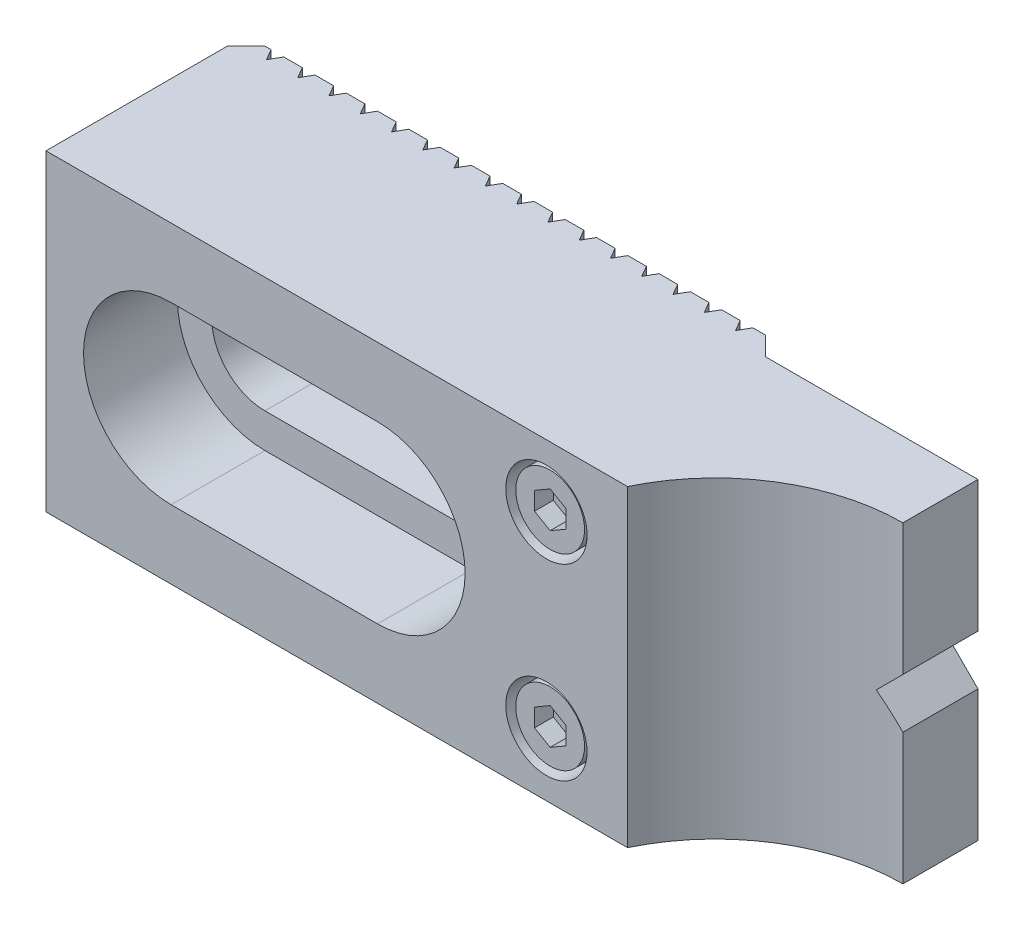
ISO-10303-21;
HEADER;
FILE_DESCRIPTION(('STEP AP214'),'2;1');
FILE_NAME('part.step','',(''),(''),'','','');
FILE_SCHEMA(('AUTOMOTIVE_DESIGN { 1 0 10303 214 1 1 1 1 }'));
ENDSEC;
DATA;
#1=APPLICATION_CONTEXT('core data for automotive mechanical design processes');
#2=APPLICATION_PROTOCOL_DEFINITION('international standard','automotive_design',2000,#1);
#3=PRODUCT_CONTEXT('',#1,'mechanical');
#4=PRODUCT('Part','Part','',(#3));
#5=PRODUCT_RELATED_PRODUCT_CATEGORY('part','',(#4));
#6=PRODUCT_DEFINITION_FORMATION('','',#4);
#7=PRODUCT_DEFINITION_CONTEXT('part definition',#1,'design');
#8=PRODUCT_DEFINITION('design','',#6,#7);
#9=PRODUCT_DEFINITION_SHAPE('','',#8);
#10=(LENGTH_UNIT() NAMED_UNIT(*) SI_UNIT(.MILLI.,.METRE.));
#11=(NAMED_UNIT(*) PLANE_ANGLE_UNIT() SI_UNIT($,.RADIAN.));
#12=(NAMED_UNIT(*) SI_UNIT($,.STERADIAN.) SOLID_ANGLE_UNIT());
#13=UNCERTAINTY_MEASURE_WITH_UNIT(LENGTH_MEASURE(1.E-05),#10,'distance_accuracy_value','');
#14=(GEOMETRIC_REPRESENTATION_CONTEXT(3) GLOBAL_UNCERTAINTY_ASSIGNED_CONTEXT((#13)) GLOBAL_UNIT_ASSIGNED_CONTEXT((#10,
#11,#12)) REPRESENTATION_CONTEXT('',''));
#15=CARTESIAN_POINT('',(0.,0.,0.));
#16=DIRECTION('',(0.,0.,1.));
#17=DIRECTION('',(1.,0.,0.));
#18=AXIS2_PLACEMENT_3D('',#15,#16,#17);
#19=CARTESIAN_POINT('',(-25.,12.5,0.));
#20=DIRECTION('',(0.,0.,-1.));
#21=DIRECTION('',(-1.,0.,0.));
#22=AXIS2_PLACEMENT_3D('',#19,#20,#21);
#23=PLANE('',#22);
#24=DIRECTION('',(0.,1.,0.));
#25=VECTOR('',#24,1.);
#26=CARTESIAN_POINT('',(12.9919317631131,-12.5,0.));
#27=LINE('',#26,#25);
#28=CARTESIAN_POINT('',(12.9919317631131,8.91133506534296,0.));
#29=VERTEX_POINT('',#28);
#30=CARTESIAN_POINT('',(12.9919317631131,12.5,0.));
#31=VERTEX_POINT('',#30);
#32=EDGE_CURVE('E922',#29,#31,#27,.T.);
#33=ORIENTED_EDGE('',*,*,#32,.F.);
#34=CARTESIAN_POINT('',(13.5,7.5,0.));
#35=DIRECTION('',(0.,0.,1.));
#36=DIRECTION('',(1.,0.,0.));
#37=AXIS2_PLACEMENT_3D('',#34,#35,#36);
#38=CIRCLE('',#37,1.49999999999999);
#39=CARTESIAN_POINT('',(12.9919317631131,6.08866493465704,0.));
#40=VERTEX_POINT('',#39);
#41=EDGE_CURVE('E765',#29,#40,#38,.T.);
#42=ORIENTED_EDGE('',*,*,#41,.T.);
#43=CARTESIAN_POINT('',(12.9919317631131,-6.08866493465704,0.));
#44=VERTEX_POINT('',#43);
#45=EDGE_CURVE('E928',#44,#40,#27,.T.);
#46=ORIENTED_EDGE('',*,*,#45,.F.);
#47=CARTESIAN_POINT('',(13.5,-7.5,0.));
#48=DIRECTION('',(0.,0.,1.));
#49=DIRECTION('',(1.,0.,0.));
#50=AXIS2_PLACEMENT_3D('',#47,#48,#49);
#51=CIRCLE('',#50,1.49999999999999);
#52=CARTESIAN_POINT('',(12.9919317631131,-8.91133506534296,0.));
#53=VERTEX_POINT('',#52);
#54=EDGE_CURVE('E776',#44,#53,#51,.T.);
#55=ORIENTED_EDGE('',*,*,#54,.T.);
#56=CARTESIAN_POINT('',(12.9919317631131,-12.5,0.));
#57=VERTEX_POINT('',#56);
#58=EDGE_CURVE('E924',#57,#53,#27,.T.);
#59=ORIENTED_EDGE('',*,*,#58,.F.);
#60=DIRECTION('',(1.,0.,0.));
#61=VECTOR('',#60,1.);
#62=CARTESIAN_POINT('',(-25.,-12.5,0.));
#63=LINE('',#62,#61);
#64=CARTESIAN_POINT('',(11.5080682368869,-12.5,0.));
#65=VERTEX_POINT('',#64);
#66=EDGE_CURVE('E1715',#65,#57,#63,.T.);
#67=ORIENTED_EDGE('',*,*,#66,.F.);
#68=DIRECTION('',(0.,1.,0.));
#69=VECTOR('',#68,1.);
#70=CARTESIAN_POINT('',(11.5080682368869,-12.5,0.));
#71=LINE('',#70,#69);
#72=CARTESIAN_POINT('',(11.5080682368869,12.5,0.));
#73=VERTEX_POINT('',#72);
#74=EDGE_CURVE('E940',#65,#73,#71,.T.);
#75=ORIENTED_EDGE('',*,*,#74,.T.);
#76=DIRECTION('',(1.,0.,0.));
#77=VECTOR('',#76,1.);
#78=CARTESIAN_POINT('',(-25.,12.5,0.));
#79=LINE('',#78,#77);
#80=EDGE_CURVE('E1589',#73,#31,#79,.T.);
#81=ORIENTED_EDGE('',*,*,#80,.T.);
#82=EDGE_LOOP('',(#33,#42,#46,#55,#59,#67,#75,#81));
#83=FACE_BOUND('',#82,.T.);
#84=ADVANCED_FACE('F15',(#83),#23,.T.);
#85=DIRECTION('',(0.,1.,0.));
#86=VECTOR('',#85,1.);
#87=CARTESIAN_POINT('',(14.0080682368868,-12.5,0.));
#88=LINE('',#87,#86);
#89=CARTESIAN_POINT('',(14.0080682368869,-6.08866493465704,0.));
#90=VERTEX_POINT('',#89);
#91=CARTESIAN_POINT('',(14.0080682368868,6.08866493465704,0.));
#92=VERTEX_POINT('',#91);
#93=EDGE_CURVE('E923',#90,#92,#88,.T.);
#94=ORIENTED_EDGE('',*,*,#93,.T.);
#95=CARTESIAN_POINT('',(15.,7.5,0.));
#96=VERTEX_POINT('',#95);
#97=EDGE_CURVE('E760',#92,#96,#38,.T.);
#98=ORIENTED_EDGE('',*,*,#97,.T.);
#99=DIRECTION('',(0.,-1.,0.));
#100=VECTOR('',#99,1.);
#101=CARTESIAN_POINT('',(15.,12.5,0.));
#102=LINE('',#101,#100);
#103=CARTESIAN_POINT('',(15.,-7.5,0.));
#104=VERTEX_POINT('',#103);
#105=EDGE_CURVE('E1283',#96,#104,#102,.T.);
#106=ORIENTED_EDGE('',*,*,#105,.T.);
#107=EDGE_CURVE('E772',#104,#90,#51,.T.);
#108=ORIENTED_EDGE('',*,*,#107,.T.);
#109=EDGE_LOOP('',(#94,#98,#106,#108));
#110=FACE_BOUND('',#109,.T.);
#111=ADVANCED_FACE('F1518',(#110),#23,.T.);
#112=CARTESIAN_POINT('',(15.,12.5,0.));
#113=VERTEX_POINT('',#112);
#114=EDGE_CURVE('E1279',#113,#96,#102,.T.);
#115=ORIENTED_EDGE('',*,*,#114,.T.);
#116=CARTESIAN_POINT('',(14.0080682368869,8.91133506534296,0.));
#117=VERTEX_POINT('',#116);
#118=EDGE_CURVE('E761',#96,#117,#38,.T.);
#119=ORIENTED_EDGE('',*,*,#118,.T.);
#120=CARTESIAN_POINT('',(14.0080682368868,12.5,0.));
#121=VERTEX_POINT('',#120);
#122=EDGE_CURVE('E917',#117,#121,#88,.T.);
#123=ORIENTED_EDGE('',*,*,#122,.T.);
#124=EDGE_CURVE('E1266',#121,#113,#79,.T.);
#125=ORIENTED_EDGE('',*,*,#124,.T.);
#126=EDGE_LOOP('',(#115,#119,#123,#125));
#127=FACE_BOUND('',#126,.T.);
#128=ADVANCED_FACE('F1526',(#127),#23,.T.);
#129=CARTESIAN_POINT('',(13.5,-12.5,0.88));
#130=DIRECTION('',(0.866025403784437,0.,-0.5));
#131=DIRECTION('',(-0.5,0.,-0.866025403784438));
#132=AXIS2_PLACEMENT_3D('',#129,#130,#131);
#133=PLANE('',#132);
#134=DIRECTION('',(0.,1.,0.));
#135=VECTOR('',#134,1.);
#136=CARTESIAN_POINT('',(13.5,-12.5,0.88));
#137=LINE('',#136,#135);
#138=CARTESIAN_POINT('',(13.5,9.,0.88));
#139=VERTEX_POINT('',#138);
#140=CARTESIAN_POINT('',(13.5,12.5,0.88));
#141=VERTEX_POINT('',#140);
#142=EDGE_CURVE('E912',#139,#141,#137,.T.);
#143=ORIENTED_EDGE('',*,*,#142,.F.);
#144=CARTESIAN_POINT('',(13.5,7.5,0.88));
#145=DIRECTION('',(0.866025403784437,0.,-0.5));
#146=DIRECTION('',(0.5,0.,0.866025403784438));
#147=AXIS2_PLACEMENT_3D('',#144,#145,#146);
#148=ELLIPSE('',#147,2.99999999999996,1.49999999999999);
#149=EDGE_CURVE('E771',#139,#29,#148,.F.);
#150=ORIENTED_EDGE('',*,*,#149,.T.);
#151=ORIENTED_EDGE('',*,*,#32,.T.);
#152=DIRECTION('',(-0.5,0.,-0.866025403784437));
#153=VECTOR('',#152,1.);
#154=CARTESIAN_POINT('',(13.5,12.5,0.88));
#155=LINE('',#154,#153);
#156=EDGE_CURVE('E902',#141,#31,#155,.T.);
#157=ORIENTED_EDGE('',*,*,#156,.F.);
#158=EDGE_LOOP('',(#143,#150,#151,#157));
#159=FACE_BOUND('',#158,.T.);
#160=ADVANCED_FACE('F1745',(#159),#133,.T.);
#161=ORIENTED_EDGE('',*,*,#45,.T.);
#162=CARTESIAN_POINT('',(13.5,6.,0.88));
#163=VERTEX_POINT('',#162);
#164=EDGE_CURVE('E767',#40,#163,#148,.F.);
#165=ORIENTED_EDGE('',*,*,#164,.T.);
#166=CARTESIAN_POINT('',(13.5,-6.,0.88));
#167=VERTEX_POINT('',#166);
#168=EDGE_CURVE('E918',#167,#163,#137,.T.);
#169=ORIENTED_EDGE('',*,*,#168,.F.);
#170=CARTESIAN_POINT('',(13.5,-7.5,0.88));
#171=DIRECTION('',(0.866025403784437,0.,-0.5));
#172=DIRECTION('',(0.5,0.,0.866025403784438));
#173=AXIS2_PLACEMENT_3D('',#170,#171,#172);
#174=ELLIPSE('',#173,2.99999999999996,1.49999999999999);
#175=EDGE_CURVE('E780',#167,#44,#174,.F.);
#176=ORIENTED_EDGE('',*,*,#175,.T.);
#177=EDGE_LOOP('',(#161,#165,#169,#176));
#178=FACE_BOUND('',#177,.T.);
#179=ADVANCED_FACE('F1754',(#178),#133,.T.);
#180=CARTESIAN_POINT('',(13.5,-12.5,0.88));
#181=DIRECTION('',(0.866025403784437,0.,0.5));
#182=DIRECTION('',(0.5,0.,-0.866025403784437));
#183=AXIS2_PLACEMENT_3D('',#180,#181,#182);
#184=PLANE('',#183);
#185=CARTESIAN_POINT('',(13.5,7.5,0.88));
#186=DIRECTION('',(0.866025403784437,0.,0.5));
#187=DIRECTION('',(-0.5,0.,0.866025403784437));
#188=AXIS2_PLACEMENT_3D('',#185,#186,#187);
#189=ELLIPSE('',#188,2.99999999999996,1.49999999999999);
#190=EDGE_CURVE('E768',#139,#117,#189,.F.);
#191=ORIENTED_EDGE('',*,*,#190,.F.);
#192=ORIENTED_EDGE('',*,*,#142,.T.);
#193=DIRECTION('',(0.5,0.,-0.866025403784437));
#194=VECTOR('',#193,1.);
#195=CARTESIAN_POINT('',(13.5,12.5,0.88));
#196=LINE('',#195,#194);
#197=EDGE_CURVE('E903',#141,#121,#196,.T.);
#198=ORIENTED_EDGE('',*,*,#197,.T.);
#199=ORIENTED_EDGE('',*,*,#122,.F.);
#200=EDGE_LOOP('',(#191,#192,#198,#199));
#201=FACE_BOUND('',#200,.T.);
#202=ADVANCED_FACE('F1743',(#201),#184,.F.);
#203=EDGE_CURVE('E764',#92,#163,#189,.F.);
#204=ORIENTED_EDGE('',*,*,#203,.F.);
#205=ORIENTED_EDGE('',*,*,#93,.F.);
#206=CARTESIAN_POINT('',(13.5,-7.5,0.88));
#207=DIRECTION('',(0.866025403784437,0.,0.5));
#208=DIRECTION('',(-0.5,0.,0.866025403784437));
#209=AXIS2_PLACEMENT_3D('',#206,#207,#208);
#210=ELLIPSE('',#209,2.99999999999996,1.49999999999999);
#211=EDGE_CURVE('E1293',#167,#90,#210,.F.);
#212=ORIENTED_EDGE('',*,*,#211,.F.);
#213=ORIENTED_EDGE('',*,*,#168,.T.);
#214=EDGE_LOOP('',(#204,#205,#212,#213));
#215=FACE_BOUND('',#214,.T.);
#216=ADVANCED_FACE('F1750',(#215),#184,.F.);
#217=CARTESIAN_POINT('',(14.0080682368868,-12.5,0.));
#218=VERTEX_POINT('',#217);
#219=CARTESIAN_POINT('',(14.0080682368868,-8.91133506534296,0.));
#220=VERTEX_POINT('',#219);
#221=EDGE_CURVE('E919',#218,#220,#88,.T.);
#222=ORIENTED_EDGE('',*,*,#221,.T.);
#223=EDGE_CURVE('E777',#220,#104,#51,.T.);
#224=ORIENTED_EDGE('',*,*,#223,.T.);
#225=CARTESIAN_POINT('',(15.,-12.5,0.));
#226=VERTEX_POINT('',#225);
#227=EDGE_CURVE('E1278',#104,#226,#102,.T.);
#228=ORIENTED_EDGE('',*,*,#227,.T.);
#229=EDGE_CURVE('E1252',#218,#226,#63,.T.);
#230=ORIENTED_EDGE('',*,*,#229,.F.);
#231=EDGE_LOOP('',(#222,#224,#228,#230));
#232=FACE_BOUND('',#231,.T.);
#233=ADVANCED_FACE('F1734',(#232),#23,.T.);
#234=ORIENTED_EDGE('',*,*,#58,.T.);
#235=CARTESIAN_POINT('',(13.5,-9.,0.88));
#236=VERTEX_POINT('',#235);
#237=EDGE_CURVE('E775',#53,#236,#174,.F.);
#238=ORIENTED_EDGE('',*,*,#237,.T.);
#239=CARTESIAN_POINT('',(13.5,-12.5,0.88));
#240=VERTEX_POINT('',#239);
#241=EDGE_CURVE('E914',#240,#236,#137,.T.);
#242=ORIENTED_EDGE('',*,*,#241,.F.);
#243=DIRECTION('',(-0.5,0.,-0.866025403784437));
#244=VECTOR('',#243,1.);
#245=CARTESIAN_POINT('',(13.5,-12.5,0.88));
#246=LINE('',#245,#244);
#247=EDGE_CURVE('E906',#240,#57,#246,.T.);
#248=ORIENTED_EDGE('',*,*,#247,.T.);
#249=EDGE_LOOP('',(#234,#238,#242,#248));
#250=FACE_BOUND('',#249,.T.);
#251=ADVANCED_FACE('F1764',(#250),#133,.T.);
#252=EDGE_CURVE('E1291',#220,#236,#210,.F.);
#253=ORIENTED_EDGE('',*,*,#252,.F.);
#254=ORIENTED_EDGE('',*,*,#221,.F.);
#255=DIRECTION('',(0.5,0.,-0.866025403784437));
#256=VECTOR('',#255,1.);
#257=CARTESIAN_POINT('',(13.5,-12.5,0.88));
#258=LINE('',#257,#256);
#259=EDGE_CURVE('E909',#240,#218,#258,.T.);
#260=ORIENTED_EDGE('',*,*,#259,.F.);
#261=ORIENTED_EDGE('',*,*,#241,.T.);
#262=EDGE_LOOP('',(#253,#254,#260,#261));
#263=FACE_BOUND('',#262,.T.);
#264=ADVANCED_FACE('F1766',(#263),#184,.F.);
#265=CARTESIAN_POINT('',(0.,0.,0.));
#266=DIRECTION('',(0.,0.,1.));
#267=DIRECTION('',(1.,0.,0.));
#268=AXIS2_PLACEMENT_3D('',#265,#266,#267);
#269=CIRCLE('',#268,4.25);
#270=CARTESIAN_POINT('',(2.99193176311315,3.01841751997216,0.));
#271=VERTEX_POINT('',#270);
#272=CARTESIAN_POINT('',(1.5080682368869,3.97344059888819,0.));
#273=VERTEX_POINT('',#272);
#274=EDGE_CURVE('E1768',#271,#273,#269,.T.);
#275=ORIENTED_EDGE('',*,*,#274,.T.);
#276=DIRECTION('',(0.,1.,0.));
#277=VECTOR('',#276,1.);
#278=CARTESIAN_POINT('',(1.50806823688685,-12.5,0.));
#279=LINE('',#278,#277);
#280=CARTESIAN_POINT('',(1.5080682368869,12.5,0.));
#281=VERTEX_POINT('',#280);
#282=EDGE_CURVE('E1017',#273,#281,#279,.T.);
#283=ORIENTED_EDGE('',*,*,#282,.T.);
#284=CARTESIAN_POINT('',(2.99193176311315,12.5,0.));
#285=VERTEX_POINT('',#284);
#286=EDGE_CURVE('E1604',#281,#285,#79,.T.);
#287=ORIENTED_EDGE('',*,*,#286,.T.);
#288=DIRECTION('',(0.,1.,0.));
#289=VECTOR('',#288,1.);
#290=CARTESIAN_POINT('',(2.99193176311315,-12.5,0.));
#291=LINE('',#290,#289);
#292=EDGE_CURVE('E998',#271,#285,#291,.T.);
#293=ORIENTED_EDGE('',*,*,#292,.F.);
#294=EDGE_LOOP('',(#275,#283,#287,#293));
#295=FACE_BOUND('',#294,.T.);
#296=ADVANCED_FACE('F2196',(#295),#23,.T.);
#297=CARTESIAN_POINT('',(0.,-4.25,0.));
#298=VERTEX_POINT('',#297);
#299=CARTESIAN_POINT('',(0.49193176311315,-4.22143377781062,0.));
#300=VERTEX_POINT('',#299);
#301=EDGE_CURVE('E795',#298,#300,#269,.T.);
#302=ORIENTED_EDGE('',*,*,#301,.T.);
#303=DIRECTION('',(0.,1.,0.));
#304=VECTOR('',#303,1.);
#305=CARTESIAN_POINT('',(0.49193176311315,-12.5,0.));
#306=LINE('',#305,#304);
#307=CARTESIAN_POINT('',(0.49193176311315,-12.5,0.));
#308=VERTEX_POINT('',#307);
#309=EDGE_CURVE('E1022',#308,#300,#306,.T.);
#310=ORIENTED_EDGE('',*,*,#309,.F.);
#311=CARTESIAN_POINT('',(-0.991931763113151,-12.5,0.));
#312=VERTEX_POINT('',#311);
#313=EDGE_CURVE('E1695',#312,#308,#63,.T.);
#314=ORIENTED_EDGE('',*,*,#313,.F.);
#315=DIRECTION('',(0.,1.,0.));
#316=VECTOR('',#315,1.);
#317=CARTESIAN_POINT('',(-0.991931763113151,-12.5,0.));
#318=LINE('',#317,#316);
#319=CARTESIAN_POINT('',(-0.9919317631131,-4.25,0.));
#320=VERTEX_POINT('',#319);
#321=EDGE_CURVE('E1041',#312,#320,#318,.T.);
#322=ORIENTED_EDGE('',*,*,#321,.T.);
#323=DIRECTION('',(-1.,0.,0.));
#324=VECTOR('',#323,1.);
#325=CARTESIAN_POINT('',(0.,-4.25,0.));
#326=LINE('',#325,#324);
#327=EDGE_CURVE('E781',#298,#320,#326,.T.);
#328=ORIENTED_EDGE('',*,*,#327,.F.);
#329=EDGE_LOOP('',(#302,#310,#314,#322,#328));
#330=FACE_BOUND('',#329,.T.);
#331=ADVANCED_FACE('F2202',(#330),#23,.T.);
#332=DIRECTION('',(0.,1.,0.));
#333=VECTOR('',#332,1.);
#334=CARTESIAN_POINT('',(-3.49193176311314,-12.5,0.));
#335=LINE('',#334,#333);
#336=CARTESIAN_POINT('',(-3.49193176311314,-12.5,0.));
#337=VERTEX_POINT('',#336);
#338=CARTESIAN_POINT('',(-3.4919317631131,-4.25,0.));
#339=VERTEX_POINT('',#338);
#340=EDGE_CURVE('E1064',#337,#339,#335,.T.);
#341=ORIENTED_EDGE('',*,*,#340,.T.);
#342=CARTESIAN_POINT('',(-2.00806823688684,-4.25,0.));
#343=VERTEX_POINT('',#342);
#344=EDGE_CURVE('E784',#343,#339,#326,.T.);
#345=ORIENTED_EDGE('',*,*,#344,.F.);
#346=DIRECTION('',(0.,1.,0.));
#347=VECTOR('',#346,1.);
#348=CARTESIAN_POINT('',(-2.00806823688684,-12.5,0.));
#349=LINE('',#348,#347);
#350=CARTESIAN_POINT('',(-2.00806823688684,-12.5,0.));
#351=VERTEX_POINT('',#350);
#352=EDGE_CURVE('E1045',#351,#343,#349,.T.);
#353=ORIENTED_EDGE('',*,*,#352,.F.);
#354=EDGE_CURVE('E1691',#337,#351,#63,.T.);
#355=ORIENTED_EDGE('',*,*,#354,.F.);
#356=EDGE_LOOP('',(#341,#345,#353,#355));
#357=FACE_BOUND('',#356,.T.);
#358=ADVANCED_FACE('F2207',(#357),#23,.T.);
#359=CARTESIAN_POINT('',(-2.00806823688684,4.25,0.));
#360=VERTEX_POINT('',#359);
#361=CARTESIAN_POINT('',(-2.00806823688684,12.5,0.));
#362=VERTEX_POINT('',#361);
#363=EDGE_CURVE('E1044',#360,#362,#349,.T.);
#364=ORIENTED_EDGE('',*,*,#363,.F.);
#365=DIRECTION('',(1.,0.,0.));
#366=VECTOR('',#365,1.);
#367=CARTESIAN_POINT('',(-16.5,4.25,0.));
#368=LINE('',#367,#366);
#369=CARTESIAN_POINT('',(-3.4919317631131,4.25,0.));
#370=VERTEX_POINT('',#369);
#371=EDGE_CURVE('E794',#370,#360,#368,.T.);
#372=ORIENTED_EDGE('',*,*,#371,.F.);
#373=CARTESIAN_POINT('',(-3.49193176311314,12.5,0.));
#374=VERTEX_POINT('',#373);
#375=EDGE_CURVE('E1063',#370,#374,#335,.T.);
#376=ORIENTED_EDGE('',*,*,#375,.T.);
#377=EDGE_CURVE('E1614',#374,#362,#79,.T.);
#378=ORIENTED_EDGE('',*,*,#377,.T.);
#379=EDGE_LOOP('',(#364,#372,#376,#378));
#380=FACE_BOUND('',#379,.T.);
#381=ADVANCED_FACE('F2213',(#380),#23,.T.);
#382=DIRECTION('',(0.,1.,0.));
#383=VECTOR('',#382,1.);
#384=CARTESIAN_POINT('',(-5.99193176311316,-12.5,0.));
#385=LINE('',#384,#383);
#386=CARTESIAN_POINT('',(-5.99193176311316,-12.5,0.));
#387=VERTEX_POINT('',#386);
#388=CARTESIAN_POINT('',(-5.9919317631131,-4.25,0.));
#389=VERTEX_POINT('',#388);
#390=EDGE_CURVE('E1087',#387,#389,#385,.T.);
#391=ORIENTED_EDGE('',*,*,#390,.T.);
#392=CARTESIAN_POINT('',(-4.50806823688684,-4.25,0.));
#393=VERTEX_POINT('',#392);
#394=EDGE_CURVE('E2684',#393,#389,#326,.T.);
#395=ORIENTED_EDGE('',*,*,#394,.F.);
#396=DIRECTION('',(0.,1.,0.));
#397=VECTOR('',#396,1.);
#398=CARTESIAN_POINT('',(-4.50806823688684,-12.5,0.));
#399=LINE('',#398,#397);
#400=CARTESIAN_POINT('',(-4.50806823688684,-12.5,0.));
#401=VERTEX_POINT('',#400);
#402=EDGE_CURVE('E1068',#401,#393,#399,.T.);
#403=ORIENTED_EDGE('',*,*,#402,.F.);
#404=EDGE_CURVE('E1687',#387,#401,#63,.T.);
#405=ORIENTED_EDGE('',*,*,#404,.F.);
#406=EDGE_LOOP('',(#391,#395,#403,#405));
#407=FACE_BOUND('',#406,.T.);
#408=ADVANCED_FACE('F2529',(#407),#23,.T.);
#409=CARTESIAN_POINT('',(-4.50806823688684,4.25,0.));
#410=VERTEX_POINT('',#409);
#411=CARTESIAN_POINT('',(-4.50806823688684,12.5,0.));
#412=VERTEX_POINT('',#411);
#413=EDGE_CURVE('E1067',#410,#412,#399,.T.);
#414=ORIENTED_EDGE('',*,*,#413,.F.);
#415=CARTESIAN_POINT('',(-5.9919317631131,4.25,0.));
#416=VERTEX_POINT('',#415);
#417=EDGE_CURVE('E2298',#416,#410,#368,.T.);
#418=ORIENTED_EDGE('',*,*,#417,.F.);
#419=CARTESIAN_POINT('',(-5.9919317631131,12.5,0.));
#420=VERTEX_POINT('',#419);
#421=EDGE_CURVE('E1086',#416,#420,#385,.T.);
#422=ORIENTED_EDGE('',*,*,#421,.T.);
#423=EDGE_CURVE('E1619',#420,#412,#79,.T.);
#424=ORIENTED_EDGE('',*,*,#423,.T.);
#425=EDGE_LOOP('',(#414,#418,#422,#424));
#426=FACE_BOUND('',#425,.T.);
#427=ADVANCED_FACE('F2310',(#426),#23,.T.);
#428=DIRECTION('',(0.,1.,0.));
#429=VECTOR('',#428,1.);
#430=CARTESIAN_POINT('',(-8.49193176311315,-12.5,0.));
#431=LINE('',#430,#429);
#432=CARTESIAN_POINT('',(-8.49193176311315,-12.5,0.));
#433=VERTEX_POINT('',#432);
#434=CARTESIAN_POINT('',(-8.4919317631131,-4.25,0.));
#435=VERTEX_POINT('',#434);
#436=EDGE_CURVE('E1110',#433,#435,#431,.T.);
#437=ORIENTED_EDGE('',*,*,#436,.T.);
#438=CARTESIAN_POINT('',(-7.00806823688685,-4.25,0.));
#439=VERTEX_POINT('',#438);
#440=EDGE_CURVE('E2680',#439,#435,#326,.T.);
#441=ORIENTED_EDGE('',*,*,#440,.F.);
#442=DIRECTION('',(0.,1.,0.));
#443=VECTOR('',#442,1.);
#444=CARTESIAN_POINT('',(-7.00806823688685,-12.5,0.));
#445=LINE('',#444,#443);
#446=CARTESIAN_POINT('',(-7.00806823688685,-12.5,0.));
#447=VERTEX_POINT('',#446);
#448=EDGE_CURVE('E1091',#447,#439,#445,.T.);
#449=ORIENTED_EDGE('',*,*,#448,.F.);
#450=EDGE_CURVE('E1683',#433,#447,#63,.T.);
#451=ORIENTED_EDGE('',*,*,#450,.F.);
#452=EDGE_LOOP('',(#437,#441,#449,#451));
#453=FACE_BOUND('',#452,.T.);
#454=ADVANCED_FACE('F2544',(#453),#23,.T.);
#455=CARTESIAN_POINT('',(-7.00806823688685,4.25,0.));
#456=VERTEX_POINT('',#455);
#457=CARTESIAN_POINT('',(-7.00806823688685,12.5,0.));
#458=VERTEX_POINT('',#457);
#459=EDGE_CURVE('E1090',#456,#458,#445,.T.);
#460=ORIENTED_EDGE('',*,*,#459,.F.);
#461=CARTESIAN_POINT('',(-8.4919317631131,4.25,0.));
#462=VERTEX_POINT('',#461);
#463=EDGE_CURVE('E2296',#462,#456,#368,.T.);
#464=ORIENTED_EDGE('',*,*,#463,.F.);
#465=CARTESIAN_POINT('',(-8.49193176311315,12.5,0.));
#466=VERTEX_POINT('',#465);
#467=EDGE_CURVE('E1109',#462,#466,#431,.T.);
#468=ORIENTED_EDGE('',*,*,#467,.T.);
#469=EDGE_CURVE('E1624',#466,#458,#79,.T.);
#470=ORIENTED_EDGE('',*,*,#469,.T.);
#471=EDGE_LOOP('',(#460,#464,#468,#470));
#472=FACE_BOUND('',#471,.T.);
#473=ADVANCED_FACE('F2318',(#472),#23,.T.);
#474=DIRECTION('',(0.,1.,0.));
#475=VECTOR('',#474,1.);
#476=CARTESIAN_POINT('',(-10.9919317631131,-12.5,0.));
#477=LINE('',#476,#475);
#478=CARTESIAN_POINT('',(-10.9919317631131,-12.5,0.));
#479=VERTEX_POINT('',#478);
#480=CARTESIAN_POINT('',(-10.9919317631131,-4.25,0.));
#481=VERTEX_POINT('',#480);
#482=EDGE_CURVE('E1133',#479,#481,#477,.T.);
#483=ORIENTED_EDGE('',*,*,#482,.T.);
#484=CARTESIAN_POINT('',(-9.50806823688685,-4.25,0.));
#485=VERTEX_POINT('',#484);
#486=EDGE_CURVE('E2676',#485,#481,#326,.T.);
#487=ORIENTED_EDGE('',*,*,#486,.F.);
#488=DIRECTION('',(0.,1.,0.));
#489=VECTOR('',#488,1.);
#490=CARTESIAN_POINT('',(-9.50806823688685,-12.5,0.));
#491=LINE('',#490,#489);
#492=CARTESIAN_POINT('',(-9.50806823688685,-12.5,0.));
#493=VERTEX_POINT('',#492);
#494=EDGE_CURVE('E1114',#493,#485,#491,.T.);
#495=ORIENTED_EDGE('',*,*,#494,.F.);
#496=EDGE_CURVE('E1679',#479,#493,#63,.T.);
#497=ORIENTED_EDGE('',*,*,#496,.F.);
#498=EDGE_LOOP('',(#483,#487,#495,#497));
#499=FACE_BOUND('',#498,.T.);
#500=ADVANCED_FACE('F2566',(#499),#23,.T.);
#501=CARTESIAN_POINT('',(-9.50806823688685,4.25,0.));
#502=VERTEX_POINT('',#501);
#503=CARTESIAN_POINT('',(-9.50806823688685,12.5,0.));
#504=VERTEX_POINT('',#503);
#505=EDGE_CURVE('E1113',#502,#504,#491,.T.);
#506=ORIENTED_EDGE('',*,*,#505,.F.);
#507=CARTESIAN_POINT('',(-10.9919317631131,4.25,0.));
#508=VERTEX_POINT('',#507);
#509=EDGE_CURVE('E2294',#508,#502,#368,.T.);
#510=ORIENTED_EDGE('',*,*,#509,.F.);
#511=CARTESIAN_POINT('',(-10.9919317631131,12.5,0.));
#512=VERTEX_POINT('',#511);
#513=EDGE_CURVE('E1132',#508,#512,#477,.T.);
#514=ORIENTED_EDGE('',*,*,#513,.T.);
#515=EDGE_CURVE('E1629',#512,#504,#79,.T.);
#516=ORIENTED_EDGE('',*,*,#515,.T.);
#517=EDGE_LOOP('',(#506,#510,#514,#516));
#518=FACE_BOUND('',#517,.T.);
#519=ADVANCED_FACE('F2326',(#518),#23,.T.);
#520=DIRECTION('',(0.,1.,0.));
#521=VECTOR('',#520,1.);
#522=CARTESIAN_POINT('',(-13.4919317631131,-12.5,0.));
#523=LINE('',#522,#521);
#524=CARTESIAN_POINT('',(-13.4919317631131,-12.5,0.));
#525=VERTEX_POINT('',#524);
#526=CARTESIAN_POINT('',(-13.4919317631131,-4.25,0.));
#527=VERTEX_POINT('',#526);
#528=EDGE_CURVE('E1156',#525,#527,#523,.T.);
#529=ORIENTED_EDGE('',*,*,#528,.T.);
#530=CARTESIAN_POINT('',(-12.0080682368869,-4.25,0.));
#531=VERTEX_POINT('',#530);
#532=EDGE_CURVE('E2672',#531,#527,#326,.T.);
#533=ORIENTED_EDGE('',*,*,#532,.F.);
#534=DIRECTION('',(0.,1.,0.));
#535=VECTOR('',#534,1.);
#536=CARTESIAN_POINT('',(-12.0080682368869,-12.5,0.));
#537=LINE('',#536,#535);
#538=CARTESIAN_POINT('',(-12.0080682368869,-12.5,0.));
#539=VERTEX_POINT('',#538);
#540=EDGE_CURVE('E1137',#539,#531,#537,.T.);
#541=ORIENTED_EDGE('',*,*,#540,.F.);
#542=EDGE_CURVE('E1675',#525,#539,#63,.T.);
#543=ORIENTED_EDGE('',*,*,#542,.F.);
#544=EDGE_LOOP('',(#529,#533,#541,#543));
#545=FACE_BOUND('',#544,.T.);
#546=ADVANCED_FACE('F2582',(#545),#23,.T.);
#547=CARTESIAN_POINT('',(-12.0080682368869,4.25,0.));
#548=VERTEX_POINT('',#547);
#549=CARTESIAN_POINT('',(-12.0080682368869,12.5,0.));
#550=VERTEX_POINT('',#549);
#551=EDGE_CURVE('E1136',#548,#550,#537,.T.);
#552=ORIENTED_EDGE('',*,*,#551,.F.);
#553=CARTESIAN_POINT('',(-13.4919317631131,4.25,0.));
#554=VERTEX_POINT('',#553);
#555=EDGE_CURVE('E2293',#554,#548,#368,.T.);
#556=ORIENTED_EDGE('',*,*,#555,.F.);
#557=CARTESIAN_POINT('',(-13.4919317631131,12.5,0.));
#558=VERTEX_POINT('',#557);
#559=EDGE_CURVE('E1155',#554,#558,#523,.T.);
#560=ORIENTED_EDGE('',*,*,#559,.T.);
#561=EDGE_CURVE('E1634',#558,#550,#79,.T.);
#562=ORIENTED_EDGE('',*,*,#561,.T.);
#563=EDGE_LOOP('',(#552,#556,#560,#562));
#564=FACE_BOUND('',#563,.T.);
#565=ADVANCED_FACE('F2334',(#564),#23,.T.);
#566=DIRECTION('',(0.,1.,0.));
#567=VECTOR('',#566,1.);
#568=CARTESIAN_POINT('',(-15.9919317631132,-12.5,0.));
#569=LINE('',#568,#567);
#570=CARTESIAN_POINT('',(-15.9919317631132,-12.5,0.));
#571=VERTEX_POINT('',#570);
#572=CARTESIAN_POINT('',(-15.9919317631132,-4.25,0.));
#573=VERTEX_POINT('',#572);
#574=EDGE_CURVE('E1179',#571,#573,#569,.T.);
#575=ORIENTED_EDGE('',*,*,#574,.T.);
#576=CARTESIAN_POINT('',(-14.5080682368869,-4.25,0.));
#577=VERTEX_POINT('',#576);
#578=EDGE_CURVE('E785',#577,#573,#326,.T.);
#579=ORIENTED_EDGE('',*,*,#578,.F.);
#580=DIRECTION('',(0.,1.,0.));
#581=VECTOR('',#580,1.);
#582=CARTESIAN_POINT('',(-14.5080682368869,-12.5,0.));
#583=LINE('',#582,#581);
#584=CARTESIAN_POINT('',(-14.5080682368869,-12.5,0.));
#585=VERTEX_POINT('',#584);
#586=EDGE_CURVE('E1160',#585,#577,#583,.T.);
#587=ORIENTED_EDGE('',*,*,#586,.F.);
#588=EDGE_CURVE('E1671',#571,#585,#63,.T.);
#589=ORIENTED_EDGE('',*,*,#588,.F.);
#590=EDGE_LOOP('',(#575,#579,#587,#589));
#591=FACE_BOUND('',#590,.T.);
#592=ADVANCED_FACE('F2279',(#591),#23,.T.);
#593=CARTESIAN_POINT('',(-14.5080682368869,4.25,0.));
#594=VERTEX_POINT('',#593);
#595=CARTESIAN_POINT('',(-14.5080682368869,12.5,0.));
#596=VERTEX_POINT('',#595);
#597=EDGE_CURVE('E1159',#594,#596,#583,.T.);
#598=ORIENTED_EDGE('',*,*,#597,.F.);
#599=CARTESIAN_POINT('',(-15.9919317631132,4.25,0.));
#600=VERTEX_POINT('',#599);
#601=EDGE_CURVE('E790',#600,#594,#368,.T.);
#602=ORIENTED_EDGE('',*,*,#601,.F.);
#603=CARTESIAN_POINT('',(-15.9919317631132,12.5,0.));
#604=VERTEX_POINT('',#603);
#605=EDGE_CURVE('E1178',#600,#604,#569,.T.);
#606=ORIENTED_EDGE('',*,*,#605,.T.);
#607=EDGE_CURVE('E1639',#604,#596,#79,.T.);
#608=ORIENTED_EDGE('',*,*,#607,.T.);
#609=EDGE_LOOP('',(#598,#602,#606,#608));
#610=FACE_BOUND('',#609,.T.);
#611=ADVANCED_FACE('F2272',(#610),#23,.T.);
#612=CARTESIAN_POINT('',(-16.5,0.,0.));
#613=DIRECTION('',(0.,0.,1.));
#614=DIRECTION('',(1.,0.,0.));
#615=AXIS2_PLACEMENT_3D('',#612,#613,#614);
#616=CIRCLE('',#615,4.25);
#617=CARTESIAN_POINT('',(-17.0080682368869,4.21952208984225,0.));
#618=VERTEX_POINT('',#617);
#619=CARTESIAN_POINT('',(-18.4919317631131,3.75429192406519,0.));
#620=VERTEX_POINT('',#619);
#621=EDGE_CURVE('E791',#618,#620,#616,.T.);
#622=ORIENTED_EDGE('',*,*,#621,.T.);
#623=DIRECTION('',(0.,1.,0.));
#624=VECTOR('',#623,1.);
#625=CARTESIAN_POINT('',(-18.4919317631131,-12.5,0.));
#626=LINE('',#625,#624);
#627=CARTESIAN_POINT('',(-18.4919317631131,12.5,0.));
#628=VERTEX_POINT('',#627);
#629=EDGE_CURVE('E1201',#620,#628,#626,.T.);
#630=ORIENTED_EDGE('',*,*,#629,.T.);
#631=CARTESIAN_POINT('',(-17.0080682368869,12.5,0.));
#632=VERTEX_POINT('',#631);
#633=EDGE_CURVE('E1644',#628,#632,#79,.T.);
#634=ORIENTED_EDGE('',*,*,#633,.T.);
#635=DIRECTION('',(0.,1.,0.));
#636=VECTOR('',#635,1.);
#637=CARTESIAN_POINT('',(-17.0080682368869,-12.5,0.));
#638=LINE('',#637,#636);
#639=EDGE_CURVE('E1182',#618,#632,#638,.T.);
#640=ORIENTED_EDGE('',*,*,#639,.F.);
#641=EDGE_LOOP('',(#622,#630,#634,#640));
#642=FACE_BOUND('',#641,.T.);
#643=ADVANCED_FACE('F2267',(#642),#23,.T.);
#644=CARTESIAN_POINT('',(-19.,-12.5,0.88));
#645=DIRECTION('',(0.866025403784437,0.,-0.5));
#646=DIRECTION('',(-0.5,0.,-0.866025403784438));
#647=AXIS2_PLACEMENT_3D('',#644,#645,#646);
#648=PLANE('',#647);
#649=CARTESIAN_POINT('',(-16.5,0.,5.21012701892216));
#650=DIRECTION('',(0.866025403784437,0.,-0.5));
#651=DIRECTION('',(0.5,0.,0.866025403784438));
#652=AXIS2_PLACEMENT_3D('',#649,#650,#651);
#653=ELLIPSE('',#652,8.5,4.25);
#654=CARTESIAN_POINT('',(-19.,-3.43693177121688,0.88));
#655=VERTEX_POINT('',#654);
#656=CARTESIAN_POINT('',(-19.5080682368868,-3.00233667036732,0.));
#657=VERTEX_POINT('',#656);
#658=EDGE_CURVE('E881',#655,#657,#653,.T.);
#659=ORIENTED_EDGE('',*,*,#658,.F.);
#660=DIRECTION('',(0.,1.,0.));
#661=VECTOR('',#660,1.);
#662=CARTESIAN_POINT('',(-19.,-12.5,0.88));
#663=LINE('',#662,#661);
#664=CARTESIAN_POINT('',(-19.,-12.5,0.88));
#665=VERTEX_POINT('',#664);
#666=EDGE_CURVE('E1198',#665,#655,#663,.T.);
#667=ORIENTED_EDGE('',*,*,#666,.F.);
#668=DIRECTION('',(-0.5,0.,-0.866025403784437));
#669=VECTOR('',#668,1.);
#670=CARTESIAN_POINT('',(-19.,-12.5,0.88));
#671=LINE('',#670,#669);
#672=CARTESIAN_POINT('',(-19.5080682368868,-12.5,0.));
#673=VERTEX_POINT('',#672);
#674=EDGE_CURVE('E1190',#665,#673,#671,.T.);
#675=ORIENTED_EDGE('',*,*,#674,.T.);
#676=DIRECTION('',(0.,1.,0.));
#677=VECTOR('',#676,1.);
#678=CARTESIAN_POINT('',(-19.5080682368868,-12.5,0.));
#679=LINE('',#678,#677);
#680=EDGE_CURVE('E1206',#673,#657,#679,.T.);
#681=ORIENTED_EDGE('',*,*,#680,.T.);
#682=EDGE_LOOP('',(#659,#667,#675,#681));
#683=FACE_BOUND('',#682,.T.);
#684=ADVANCED_FACE('F1919',(#683),#648,.T.);
#685=CARTESIAN_POINT('',(-19.,-12.5,0.88));
#686=DIRECTION('',(0.866025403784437,0.,0.5));
#687=DIRECTION('',(0.5,0.,-0.866025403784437));
#688=AXIS2_PLACEMENT_3D('',#685,#686,#687);
#689=PLANE('',#688);
#690=ORIENTED_EDGE('',*,*,#666,.T.);
#691=CARTESIAN_POINT('',(-16.5,0.,-3.45012701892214));
#692=DIRECTION('',(0.866025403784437,0.,0.5));
#693=DIRECTION('',(-0.5,0.,0.866025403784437));
#694=AXIS2_PLACEMENT_3D('',#691,#692,#693);
#695=ELLIPSE('',#694,8.5,4.25);
#696=CARTESIAN_POINT('',(-18.4919317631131,-3.75429192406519,0.));
#697=VERTEX_POINT('',#696);
#698=EDGE_CURVE('E879',#655,#697,#695,.T.);
#699=ORIENTED_EDGE('',*,*,#698,.T.);
#700=CARTESIAN_POINT('',(-18.4919317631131,-12.5,0.));
#701=VERTEX_POINT('',#700);
#702=EDGE_CURVE('E1202',#701,#697,#626,.T.);
#703=ORIENTED_EDGE('',*,*,#702,.F.);
#704=DIRECTION('',(0.5,0.,-0.866025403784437));
#705=VECTOR('',#704,1.);
#706=CARTESIAN_POINT('',(-19.,-12.5,0.88));
#707=LINE('',#706,#705);
#708=EDGE_CURVE('E1193',#665,#701,#707,.T.);
#709=ORIENTED_EDGE('',*,*,#708,.F.);
#710=EDGE_LOOP('',(#690,#699,#703,#709));
#711=FACE_BOUND('',#710,.T.);
#712=ADVANCED_FACE('F1923',(#711),#689,.F.);
#713=CARTESIAN_POINT('',(-16.5,-12.5,0.88));
#714=DIRECTION('',(0.866025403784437,0.,-0.5));
#715=DIRECTION('',(-0.5,0.,-0.866025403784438));
#716=AXIS2_PLACEMENT_3D('',#713,#714,#715);
#717=PLANE('',#716);
#718=CARTESIAN_POINT('',(-16.5,0.,0.88));
#719=DIRECTION('',(0.866025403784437,0.,-0.5));
#720=DIRECTION('',(0.5,0.,0.866025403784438));
#721=AXIS2_PLACEMENT_3D('',#718,#719,#720);
#722=ELLIPSE('',#721,8.5,4.25);
#723=CARTESIAN_POINT('',(-16.5,-4.25,0.88));
#724=VERTEX_POINT('',#723);
#725=CARTESIAN_POINT('',(-17.0080682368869,-4.21952208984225,0.));
#726=VERTEX_POINT('',#725);
#727=EDGE_CURVE('E874',#724,#726,#722,.T.);
#728=ORIENTED_EDGE('',*,*,#727,.F.);
#729=DIRECTION('',(0.,1.,0.));
#730=VECTOR('',#729,1.);
#731=CARTESIAN_POINT('',(-16.5,-12.5,0.88));
#732=LINE('',#731,#730);
#733=CARTESIAN_POINT('',(-16.5,-12.5,0.88));
#734=VERTEX_POINT('',#733);
#735=EDGE_CURVE('E1175',#734,#724,#732,.T.);
#736=ORIENTED_EDGE('',*,*,#735,.F.);
#737=DIRECTION('',(-0.5,0.,-0.866025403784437));
#738=VECTOR('',#737,1.);
#739=CARTESIAN_POINT('',(-16.5,-12.5,0.88));
#740=LINE('',#739,#738);
#741=CARTESIAN_POINT('',(-17.0080682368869,-12.5,0.));
#742=VERTEX_POINT('',#741);
#743=EDGE_CURVE('E1167',#734,#742,#740,.T.);
#744=ORIENTED_EDGE('',*,*,#743,.T.);
#745=EDGE_CURVE('E1183',#742,#726,#638,.T.);
#746=ORIENTED_EDGE('',*,*,#745,.T.);
#747=EDGE_LOOP('',(#728,#736,#744,#746));
#748=FACE_BOUND('',#747,.T.);
#749=ADVANCED_FACE('F1909',(#748),#717,.T.);
#750=CARTESIAN_POINT('',(-16.5,-12.5,0.88));
#751=DIRECTION('',(0.866025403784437,0.,0.5));
#752=DIRECTION('',(0.5,0.,-0.866025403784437));
#753=AXIS2_PLACEMENT_3D('',#750,#751,#752);
#754=PLANE('',#753);
#755=DIRECTION('',(-0.5,0.,0.866025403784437));
#756=VECTOR('',#755,1.);
#757=CARTESIAN_POINT('',(-16.5,-4.25,0.88));
#758=LINE('',#757,#756);
#759=EDGE_CURVE('E731',#573,#724,#758,.T.);
#760=ORIENTED_EDGE('',*,*,#759,.F.);
#761=ORIENTED_EDGE('',*,*,#574,.F.);
#762=DIRECTION('',(0.5,0.,-0.866025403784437));
#763=VECTOR('',#762,1.);
#764=CARTESIAN_POINT('',(-16.5,-12.5,0.88));
#765=LINE('',#764,#763);
#766=EDGE_CURVE('E1170',#734,#571,#765,.T.);
#767=ORIENTED_EDGE('',*,*,#766,.F.);
#768=ORIENTED_EDGE('',*,*,#735,.T.);
#769=EDGE_LOOP('',(#760,#761,#767,#768));
#770=FACE_BOUND('',#769,.T.);
#771=ADVANCED_FACE('F1910',(#770),#754,.F.);
#772=DIRECTION('',(0.5,0.,-0.866025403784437));
#773=VECTOR('',#772,1.);
#774=CARTESIAN_POINT('',(-16.5,4.25,0.88));
#775=LINE('',#774,#773);
#776=CARTESIAN_POINT('',(-16.5,4.25,0.88));
#777=VERTEX_POINT('',#776);
#778=EDGE_CURVE('E841',#777,#600,#775,.T.);
#779=ORIENTED_EDGE('',*,*,#778,.F.);
#780=CARTESIAN_POINT('',(-16.5,12.5,0.88));
#781=VERTEX_POINT('',#780);
#782=EDGE_CURVE('E1173',#777,#781,#732,.T.);
#783=ORIENTED_EDGE('',*,*,#782,.T.);
#784=DIRECTION('',(0.5,0.,-0.866025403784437));
#785=VECTOR('',#784,1.);
#786=CARTESIAN_POINT('',(-16.5,12.5,0.88));
#787=LINE('',#786,#785);
#788=EDGE_CURVE('E1164',#781,#604,#787,.T.);
#789=ORIENTED_EDGE('',*,*,#788,.T.);
#790=ORIENTED_EDGE('',*,*,#605,.F.);
#791=EDGE_LOOP('',(#779,#783,#789,#790));
#792=FACE_BOUND('',#791,.T.);
#793=ADVANCED_FACE('F1899',(#792),#754,.F.);
#794=CARTESIAN_POINT('',(-14.,-12.5,0.88));
#795=DIRECTION('',(0.866025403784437,0.,-0.5));
#796=DIRECTION('',(-0.5,0.,-0.866025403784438));
#797=AXIS2_PLACEMENT_3D('',#794,#795,#796);
#798=PLANE('',#797);
#799=ORIENTED_EDGE('',*,*,#586,.T.);
#800=DIRECTION('',(0.5,0.,0.866025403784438));
#801=VECTOR('',#800,1.);
#802=CARTESIAN_POINT('',(-14.,-4.25,0.88));
#803=LINE('',#802,#801);
#804=CARTESIAN_POINT('',(-14.,-4.25,0.88));
#805=VERTEX_POINT('',#804);
#806=EDGE_CURVE('E868',#577,#805,#803,.T.);
#807=ORIENTED_EDGE('',*,*,#806,.T.);
#808=DIRECTION('',(0.,1.,0.));
#809=VECTOR('',#808,1.);
#810=CARTESIAN_POINT('',(-14.,-12.5,0.88));
#811=LINE('',#810,#809);
#812=CARTESIAN_POINT('',(-14.,-12.5,0.88));
#813=VERTEX_POINT('',#812);
#814=EDGE_CURVE('E1152',#813,#805,#811,.T.);
#815=ORIENTED_EDGE('',*,*,#814,.F.);
#816=DIRECTION('',(-0.5,0.,-0.866025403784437));
#817=VECTOR('',#816,1.);
#818=CARTESIAN_POINT('',(-14.,-12.5,0.88));
#819=LINE('',#818,#817);
#820=EDGE_CURVE('E1144',#813,#585,#819,.T.);
#821=ORIENTED_EDGE('',*,*,#820,.T.);
#822=EDGE_LOOP('',(#799,#807,#815,#821));
#823=FACE_BOUND('',#822,.T.);
#824=ADVANCED_FACE('F1895',(#823),#798,.T.);
#825=CARTESIAN_POINT('',(-14.,4.25,0.88));
#826=VERTEX_POINT('',#825);
#827=CARTESIAN_POINT('',(-14.,12.5,0.88));
#828=VERTEX_POINT('',#827);
#829=EDGE_CURVE('E1150',#826,#828,#811,.T.);
#830=ORIENTED_EDGE('',*,*,#829,.F.);
#831=DIRECTION('',(-0.5,0.,-0.866025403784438));
#832=VECTOR('',#831,1.);
#833=CARTESIAN_POINT('',(-14.,4.25,0.88));
#834=LINE('',#833,#832);
#835=EDGE_CURVE('E838',#826,#594,#834,.T.);
#836=ORIENTED_EDGE('',*,*,#835,.T.);
#837=ORIENTED_EDGE('',*,*,#597,.T.);
#838=DIRECTION('',(-0.5,0.,-0.866025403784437));
#839=VECTOR('',#838,1.);
#840=CARTESIAN_POINT('',(-14.,12.5,0.88));
#841=LINE('',#840,#839);
#842=EDGE_CURVE('E1140',#828,#596,#841,.T.);
#843=ORIENTED_EDGE('',*,*,#842,.F.);
#844=EDGE_LOOP('',(#830,#836,#837,#843));
#845=FACE_BOUND('',#844,.T.);
#846=ADVANCED_FACE('F1898',(#845),#798,.T.);
#847=CARTESIAN_POINT('',(-14.,-12.5,0.88));
#848=DIRECTION('',(0.866025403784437,0.,0.5));
#849=DIRECTION('',(0.5,0.,-0.866025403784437));
#850=AXIS2_PLACEMENT_3D('',#847,#848,#849);
#851=PLANE('',#850);
#852=DIRECTION('',(-0.5,0.,0.866025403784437));
#853=VECTOR('',#852,1.);
#854=CARTESIAN_POINT('',(-14.,-4.25,0.88));
#855=LINE('',#854,#853);
#856=EDGE_CURVE('E866',#527,#805,#855,.T.);
#857=ORIENTED_EDGE('',*,*,#856,.F.);
#858=ORIENTED_EDGE('',*,*,#528,.F.);
#859=DIRECTION('',(0.5,0.,-0.866025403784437));
#860=VECTOR('',#859,1.);
#861=CARTESIAN_POINT('',(-14.,-12.5,0.88));
#862=LINE('',#861,#860);
#863=EDGE_CURVE('E1147',#813,#525,#862,.T.);
#864=ORIENTED_EDGE('',*,*,#863,.F.);
#865=ORIENTED_EDGE('',*,*,#814,.T.);
#866=EDGE_LOOP('',(#857,#858,#864,#865));
#867=FACE_BOUND('',#866,.T.);
#868=ADVANCED_FACE('F1901',(#867),#851,.F.);
#869=DIRECTION('',(0.5,0.,-0.866025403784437));
#870=VECTOR('',#869,1.);
#871=CARTESIAN_POINT('',(-14.,4.25,0.88));
#872=LINE('',#871,#870);
#873=EDGE_CURVE('E836',#826,#554,#872,.T.);
#874=ORIENTED_EDGE('',*,*,#873,.F.);
#875=ORIENTED_EDGE('',*,*,#829,.T.);
#876=DIRECTION('',(0.5,0.,-0.866025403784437));
#877=VECTOR('',#876,1.);
#878=CARTESIAN_POINT('',(-14.,12.5,0.88));
#879=LINE('',#878,#877);
#880=EDGE_CURVE('E1141',#828,#558,#879,.T.);
#881=ORIENTED_EDGE('',*,*,#880,.T.);
#882=ORIENTED_EDGE('',*,*,#559,.F.);
#883=EDGE_LOOP('',(#874,#875,#881,#882));
#884=FACE_BOUND('',#883,.T.);
#885=ADVANCED_FACE('F1889',(#884),#851,.F.);
#886=CARTESIAN_POINT('',(-11.5,-12.5,0.88));
#887=DIRECTION('',(0.866025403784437,0.,-0.5));
#888=DIRECTION('',(-0.5,0.,-0.866025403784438));
#889=AXIS2_PLACEMENT_3D('',#886,#887,#888);
#890=PLANE('',#889);
#891=ORIENTED_EDGE('',*,*,#540,.T.);
#892=DIRECTION('',(0.5,0.,0.866025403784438));
#893=VECTOR('',#892,1.);
#894=CARTESIAN_POINT('',(-11.5,-4.25,0.88));
#895=LINE('',#894,#893);
#896=CARTESIAN_POINT('',(-11.5,-4.25,0.88));
#897=VERTEX_POINT('',#896);
#898=EDGE_CURVE('E863',#531,#897,#895,.T.);
#899=ORIENTED_EDGE('',*,*,#898,.T.);
#900=DIRECTION('',(0.,1.,0.));
#901=VECTOR('',#900,1.);
#902=CARTESIAN_POINT('',(-11.5,-12.5,0.88));
#903=LINE('',#902,#901);
#904=CARTESIAN_POINT('',(-11.5,-12.5,0.88));
#905=VERTEX_POINT('',#904);
#906=EDGE_CURVE('E1129',#905,#897,#903,.T.);
#907=ORIENTED_EDGE('',*,*,#906,.F.);
#908=DIRECTION('',(-0.5,0.,-0.866025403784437));
#909=VECTOR('',#908,1.);
#910=CARTESIAN_POINT('',(-11.5,-12.5,0.88));
#911=LINE('',#910,#909);
#912=EDGE_CURVE('E1121',#905,#539,#911,.T.);
#913=ORIENTED_EDGE('',*,*,#912,.T.);
#914=EDGE_LOOP('',(#891,#899,#907,#913));
#915=FACE_BOUND('',#914,.T.);
#916=ADVANCED_FACE('F1885',(#915),#890,.T.);
#917=CARTESIAN_POINT('',(-11.5,4.25,0.88));
#918=VERTEX_POINT('',#917);
#919=CARTESIAN_POINT('',(-11.5,12.5,0.88));
#920=VERTEX_POINT('',#919);
#921=EDGE_CURVE('E1127',#918,#920,#903,.T.);
#922=ORIENTED_EDGE('',*,*,#921,.F.);
#923=DIRECTION('',(-0.5,0.,-0.866025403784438));
#924=VECTOR('',#923,1.);
#925=CARTESIAN_POINT('',(-11.5,4.25,0.88));
#926=LINE('',#925,#924);
#927=EDGE_CURVE('E833',#918,#548,#926,.T.);
#928=ORIENTED_EDGE('',*,*,#927,.T.);
#929=ORIENTED_EDGE('',*,*,#551,.T.);
#930=DIRECTION('',(-0.5,0.,-0.866025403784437));
#931=VECTOR('',#930,1.);
#932=CARTESIAN_POINT('',(-11.5,12.5,0.88));
#933=LINE('',#932,#931);
#934=EDGE_CURVE('E1117',#920,#550,#933,.T.);
#935=ORIENTED_EDGE('',*,*,#934,.F.);
#936=EDGE_LOOP('',(#922,#928,#929,#935));
#937=FACE_BOUND('',#936,.T.);
#938=ADVANCED_FACE('F1888',(#937),#890,.T.);
#939=CARTESIAN_POINT('',(-11.5,-12.5,0.88));
#940=DIRECTION('',(0.866025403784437,0.,0.5));
#941=DIRECTION('',(0.5,0.,-0.866025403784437));
#942=AXIS2_PLACEMENT_3D('',#939,#940,#941);
#943=PLANE('',#942);
#944=DIRECTION('',(-0.5,0.,0.866025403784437));
#945=VECTOR('',#944,1.);
#946=CARTESIAN_POINT('',(-11.5,-4.25,0.88));
#947=LINE('',#946,#945);
#948=EDGE_CURVE('E861',#481,#897,#947,.T.);
#949=ORIENTED_EDGE('',*,*,#948,.F.);
#950=ORIENTED_EDGE('',*,*,#482,.F.);
#951=DIRECTION('',(0.5,0.,-0.866025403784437));
#952=VECTOR('',#951,1.);
#953=CARTESIAN_POINT('',(-11.5,-12.5,0.88));
#954=LINE('',#953,#952);
#955=EDGE_CURVE('E1124',#905,#479,#954,.T.);
#956=ORIENTED_EDGE('',*,*,#955,.F.);
#957=ORIENTED_EDGE('',*,*,#906,.T.);
#958=EDGE_LOOP('',(#949,#950,#956,#957));
#959=FACE_BOUND('',#958,.T.);
#960=ADVANCED_FACE('F1891',(#959),#943,.F.);
#961=DIRECTION('',(0.5,0.,-0.866025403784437));
#962=VECTOR('',#961,1.);
#963=CARTESIAN_POINT('',(-11.5,4.25,0.88));
#964=LINE('',#963,#962);
#965=EDGE_CURVE('E831',#918,#508,#964,.T.);
#966=ORIENTED_EDGE('',*,*,#965,.F.);
#967=ORIENTED_EDGE('',*,*,#921,.T.);
#968=DIRECTION('',(0.5,0.,-0.866025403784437));
#969=VECTOR('',#968,1.);
#970=CARTESIAN_POINT('',(-11.5,12.5,0.88));
#971=LINE('',#970,#969);
#972=EDGE_CURVE('E1118',#920,#512,#971,.T.);
#973=ORIENTED_EDGE('',*,*,#972,.T.);
#974=ORIENTED_EDGE('',*,*,#513,.F.);
#975=EDGE_LOOP('',(#966,#967,#973,#974));
#976=FACE_BOUND('',#975,.T.);
#977=ADVANCED_FACE('F1879',(#976),#943,.F.);
#978=CARTESIAN_POINT('',(-9.,-12.5,0.88));
#979=DIRECTION('',(0.866025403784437,0.,-0.5));
#980=DIRECTION('',(-0.5,0.,-0.866025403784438));
#981=AXIS2_PLACEMENT_3D('',#978,#979,#980);
#982=PLANE('',#981);
#983=ORIENTED_EDGE('',*,*,#494,.T.);
#984=DIRECTION('',(0.5,0.,0.866025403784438));
#985=VECTOR('',#984,1.);
#986=CARTESIAN_POINT('',(-9.,-4.25,0.88));
#987=LINE('',#986,#985);
#988=CARTESIAN_POINT('',(-9.,-4.25,0.88));
#989=VERTEX_POINT('',#988);
#990=EDGE_CURVE('E858',#485,#989,#987,.T.);
#991=ORIENTED_EDGE('',*,*,#990,.T.);
#992=DIRECTION('',(0.,1.,0.));
#993=VECTOR('',#992,1.);
#994=CARTESIAN_POINT('',(-9.,-12.5,0.88));
#995=LINE('',#994,#993);
#996=CARTESIAN_POINT('',(-9.,-12.5,0.88));
#997=VERTEX_POINT('',#996);
#998=EDGE_CURVE('E1106',#997,#989,#995,.T.);
#999=ORIENTED_EDGE('',*,*,#998,.F.);
#1000=DIRECTION('',(-0.5,0.,-0.866025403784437));
#1001=VECTOR('',#1000,1.);
#1002=CARTESIAN_POINT('',(-9.,-12.5,0.88));
#1003=LINE('',#1002,#1001);
#1004=EDGE_CURVE('E1098',#997,#493,#1003,.T.);
#1005=ORIENTED_EDGE('',*,*,#1004,.T.);
#1006=EDGE_LOOP('',(#983,#991,#999,#1005));
#1007=FACE_BOUND('',#1006,.T.);
#1008=ADVANCED_FACE('F1875',(#1007),#982,.T.);
#1009=CARTESIAN_POINT('',(-9.,4.25,0.88));
#1010=VERTEX_POINT('',#1009);
#1011=CARTESIAN_POINT('',(-9.,12.5,0.88));
#1012=VERTEX_POINT('',#1011);
#1013=EDGE_CURVE('E1104',#1010,#1012,#995,.T.);
#1014=ORIENTED_EDGE('',*,*,#1013,.F.);
#1015=DIRECTION('',(-0.5,0.,-0.866025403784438));
#1016=VECTOR('',#1015,1.);
#1017=CARTESIAN_POINT('',(-9.,4.25,0.88));
#1018=LINE('',#1017,#1016);
#1019=EDGE_CURVE('E828',#1010,#502,#1018,.T.);
#1020=ORIENTED_EDGE('',*,*,#1019,.T.);
#1021=ORIENTED_EDGE('',*,*,#505,.T.);
#1022=DIRECTION('',(-0.5,0.,-0.866025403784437));
#1023=VECTOR('',#1022,1.);
#1024=CARTESIAN_POINT('',(-9.,12.5,0.88));
#1025=LINE('',#1024,#1023);
#1026=EDGE_CURVE('E1094',#1012,#504,#1025,.T.);
#1027=ORIENTED_EDGE('',*,*,#1026,.F.);
#1028=EDGE_LOOP('',(#1014,#1020,#1021,#1027));
#1029=FACE_BOUND('',#1028,.T.);
#1030=ADVANCED_FACE('F1878',(#1029),#982,.T.);
#1031=CARTESIAN_POINT('',(-9.,-12.5,0.88));
#1032=DIRECTION('',(0.866025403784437,0.,0.5));
#1033=DIRECTION('',(0.5,0.,-0.866025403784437));
#1034=AXIS2_PLACEMENT_3D('',#1031,#1032,#1033);
#1035=PLANE('',#1034);
#1036=DIRECTION('',(-0.5,0.,0.866025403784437));
#1037=VECTOR('',#1036,1.);
#1038=CARTESIAN_POINT('',(-9.,-4.25,0.88));
#1039=LINE('',#1038,#1037);
#1040=EDGE_CURVE('E856',#435,#989,#1039,.T.);
#1041=ORIENTED_EDGE('',*,*,#1040,.F.);
#1042=ORIENTED_EDGE('',*,*,#436,.F.);
#1043=DIRECTION('',(0.5,0.,-0.866025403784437));
#1044=VECTOR('',#1043,1.);
#1045=CARTESIAN_POINT('',(-9.,-12.5,0.88));
#1046=LINE('',#1045,#1044);
#1047=EDGE_CURVE('E1101',#997,#433,#1046,.T.);
#1048=ORIENTED_EDGE('',*,*,#1047,.F.);
#1049=ORIENTED_EDGE('',*,*,#998,.T.);
#1050=EDGE_LOOP('',(#1041,#1042,#1048,#1049));
#1051=FACE_BOUND('',#1050,.T.);
#1052=ADVANCED_FACE('F1881',(#1051),#1035,.F.);
#1053=DIRECTION('',(0.5,0.,-0.866025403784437));
#1054=VECTOR('',#1053,1.);
#1055=CARTESIAN_POINT('',(-9.,4.25,0.88));
#1056=LINE('',#1055,#1054);
#1057=EDGE_CURVE('E826',#1010,#462,#1056,.T.);
#1058=ORIENTED_EDGE('',*,*,#1057,.F.);
#1059=ORIENTED_EDGE('',*,*,#1013,.T.);
#1060=DIRECTION('',(0.5,0.,-0.866025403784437));
#1061=VECTOR('',#1060,1.);
#1062=CARTESIAN_POINT('',(-9.,12.5,0.88));
#1063=LINE('',#1062,#1061);
#1064=EDGE_CURVE('E1095',#1012,#466,#1063,.T.);
#1065=ORIENTED_EDGE('',*,*,#1064,.T.);
#1066=ORIENTED_EDGE('',*,*,#467,.F.);
#1067=EDGE_LOOP('',(#1058,#1059,#1065,#1066));
#1068=FACE_BOUND('',#1067,.T.);
#1069=ADVANCED_FACE('F1869',(#1068),#1035,.F.);
#1070=CARTESIAN_POINT('',(-6.5,-12.5,0.88));
#1071=DIRECTION('',(0.866025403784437,0.,-0.5));
#1072=DIRECTION('',(-0.5,0.,-0.866025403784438));
#1073=AXIS2_PLACEMENT_3D('',#1070,#1071,#1072);
#1074=PLANE('',#1073);
#1075=ORIENTED_EDGE('',*,*,#448,.T.);
#1076=DIRECTION('',(0.5,0.,0.866025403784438));
#1077=VECTOR('',#1076,1.);
#1078=CARTESIAN_POINT('',(-6.5,-4.25,0.88));
#1079=LINE('',#1078,#1077);
#1080=CARTESIAN_POINT('',(-6.5,-4.25,0.88));
#1081=VERTEX_POINT('',#1080);
#1082=EDGE_CURVE('E853',#439,#1081,#1079,.T.);
#1083=ORIENTED_EDGE('',*,*,#1082,.T.);
#1084=DIRECTION('',(0.,1.,0.));
#1085=VECTOR('',#1084,1.);
#1086=CARTESIAN_POINT('',(-6.5,-12.5,0.88));
#1087=LINE('',#1086,#1085);
#1088=CARTESIAN_POINT('',(-6.5,-12.5,0.88));
#1089=VERTEX_POINT('',#1088);
#1090=EDGE_CURVE('E1083',#1089,#1081,#1087,.T.);
#1091=ORIENTED_EDGE('',*,*,#1090,.F.);
#1092=DIRECTION('',(-0.5,0.,-0.866025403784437));
#1093=VECTOR('',#1092,1.);
#1094=CARTESIAN_POINT('',(-6.5,-12.5,0.88));
#1095=LINE('',#1094,#1093);
#1096=EDGE_CURVE('E1075',#1089,#447,#1095,.T.);
#1097=ORIENTED_EDGE('',*,*,#1096,.T.);
#1098=EDGE_LOOP('',(#1075,#1083,#1091,#1097));
#1099=FACE_BOUND('',#1098,.T.);
#1100=ADVANCED_FACE('F1865',(#1099),#1074,.T.);
#1101=CARTESIAN_POINT('',(-6.5,4.25,0.88));
#1102=VERTEX_POINT('',#1101);
#1103=CARTESIAN_POINT('',(-6.5,12.5,0.88));
#1104=VERTEX_POINT('',#1103);
#1105=EDGE_CURVE('E1081',#1102,#1104,#1087,.T.);
#1106=ORIENTED_EDGE('',*,*,#1105,.F.);
#1107=DIRECTION('',(-0.5,0.,-0.866025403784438));
#1108=VECTOR('',#1107,1.);
#1109=CARTESIAN_POINT('',(-6.5,4.25,0.88));
#1110=LINE('',#1109,#1108);
#1111=EDGE_CURVE('E823',#1102,#456,#1110,.T.);
#1112=ORIENTED_EDGE('',*,*,#1111,.T.);
#1113=ORIENTED_EDGE('',*,*,#459,.T.);
#1114=DIRECTION('',(-0.5,0.,-0.866025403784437));
#1115=VECTOR('',#1114,1.);
#1116=CARTESIAN_POINT('',(-6.5,12.5,0.88));
#1117=LINE('',#1116,#1115);
#1118=EDGE_CURVE('E1071',#1104,#458,#1117,.T.);
#1119=ORIENTED_EDGE('',*,*,#1118,.F.);
#1120=EDGE_LOOP('',(#1106,#1112,#1113,#1119));
#1121=FACE_BOUND('',#1120,.T.);
#1122=ADVANCED_FACE('F1868',(#1121),#1074,.T.);
#1123=CARTESIAN_POINT('',(-6.5,-12.5,0.88));
#1124=DIRECTION('',(0.866025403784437,0.,0.5));
#1125=DIRECTION('',(0.5,0.,-0.866025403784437));
#1126=AXIS2_PLACEMENT_3D('',#1123,#1124,#1125);
#1127=PLANE('',#1126);
#1128=DIRECTION('',(-0.5,0.,0.866025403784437));
#1129=VECTOR('',#1128,1.);
#1130=CARTESIAN_POINT('',(-6.5,-4.25,0.88));
#1131=LINE('',#1130,#1129);
#1132=EDGE_CURVE('E851',#389,#1081,#1131,.T.);
#1133=ORIENTED_EDGE('',*,*,#1132,.F.);
#1134=ORIENTED_EDGE('',*,*,#390,.F.);
#1135=DIRECTION('',(0.5,0.,-0.866025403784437));
#1136=VECTOR('',#1135,1.);
#1137=CARTESIAN_POINT('',(-6.5,-12.5,0.88));
#1138=LINE('',#1137,#1136);
#1139=EDGE_CURVE('E1078',#1089,#387,#1138,.T.);
#1140=ORIENTED_EDGE('',*,*,#1139,.F.);
#1141=ORIENTED_EDGE('',*,*,#1090,.T.);
#1142=EDGE_LOOP('',(#1133,#1134,#1140,#1141));
#1143=FACE_BOUND('',#1142,.T.);
#1144=ADVANCED_FACE('F1871',(#1143),#1127,.F.);
#1145=DIRECTION('',(0.5,0.,-0.866025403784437));
#1146=VECTOR('',#1145,1.);
#1147=CARTESIAN_POINT('',(-6.5,4.25,0.88));
#1148=LINE('',#1147,#1146);
#1149=EDGE_CURVE('E821',#1102,#416,#1148,.T.);
#1150=ORIENTED_EDGE('',*,*,#1149,.F.);
#1151=ORIENTED_EDGE('',*,*,#1105,.T.);
#1152=DIRECTION('',(0.5,0.,-0.866025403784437));
#1153=VECTOR('',#1152,1.);
#1154=CARTESIAN_POINT('',(-6.5,12.5,0.88));
#1155=LINE('',#1154,#1153);
#1156=EDGE_CURVE('E1072',#1104,#420,#1155,.T.);
#1157=ORIENTED_EDGE('',*,*,#1156,.T.);
#1158=ORIENTED_EDGE('',*,*,#421,.F.);
#1159=EDGE_LOOP('',(#1150,#1151,#1157,#1158));
#1160=FACE_BOUND('',#1159,.T.);
#1161=ADVANCED_FACE('F1859',(#1160),#1127,.F.);
#1162=CARTESIAN_POINT('',(-4.,-12.5,0.88));
#1163=DIRECTION('',(0.866025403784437,0.,-0.5));
#1164=DIRECTION('',(-0.5,0.,-0.866025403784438));
#1165=AXIS2_PLACEMENT_3D('',#1162,#1163,#1164);
#1166=PLANE('',#1165);
#1167=ORIENTED_EDGE('',*,*,#402,.T.);
#1168=DIRECTION('',(0.5,0.,0.866025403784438));
#1169=VECTOR('',#1168,1.);
#1170=CARTESIAN_POINT('',(-4.,-4.25,0.88));
#1171=LINE('',#1170,#1169);
#1172=CARTESIAN_POINT('',(-4.,-4.25,0.88));
#1173=VERTEX_POINT('',#1172);
#1174=EDGE_CURVE('E848',#393,#1173,#1171,.T.);
#1175=ORIENTED_EDGE('',*,*,#1174,.T.);
#1176=DIRECTION('',(0.,1.,0.));
#1177=VECTOR('',#1176,1.);
#1178=CARTESIAN_POINT('',(-4.,-12.5,0.88));
#1179=LINE('',#1178,#1177);
#1180=CARTESIAN_POINT('',(-4.,-12.5,0.88));
#1181=VERTEX_POINT('',#1180);
#1182=EDGE_CURVE('E1060',#1181,#1173,#1179,.T.);
#1183=ORIENTED_EDGE('',*,*,#1182,.F.);
#1184=DIRECTION('',(-0.5,0.,-0.866025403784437));
#1185=VECTOR('',#1184,1.);
#1186=CARTESIAN_POINT('',(-4.,-12.5,0.88));
#1187=LINE('',#1186,#1185);
#1188=EDGE_CURVE('E1052',#1181,#401,#1187,.T.);
#1189=ORIENTED_EDGE('',*,*,#1188,.T.);
#1190=EDGE_LOOP('',(#1167,#1175,#1183,#1189));
#1191=FACE_BOUND('',#1190,.T.);
#1192=ADVANCED_FACE('F1855',(#1191),#1166,.T.);
#1193=CARTESIAN_POINT('',(-4.,4.25,0.88));
#1194=VERTEX_POINT('',#1193);
#1195=CARTESIAN_POINT('',(-4.,12.5,0.88));
#1196=VERTEX_POINT('',#1195);
#1197=EDGE_CURVE('E1058',#1194,#1196,#1179,.T.);
#1198=ORIENTED_EDGE('',*,*,#1197,.F.);
#1199=DIRECTION('',(-0.5,0.,-0.866025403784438));
#1200=VECTOR('',#1199,1.);
#1201=CARTESIAN_POINT('',(-4.,4.25,0.88));
#1202=LINE('',#1201,#1200);
#1203=EDGE_CURVE('E818',#1194,#410,#1202,.T.);
#1204=ORIENTED_EDGE('',*,*,#1203,.T.);
#1205=ORIENTED_EDGE('',*,*,#413,.T.);
#1206=DIRECTION('',(-0.5,0.,-0.866025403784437));
#1207=VECTOR('',#1206,1.);
#1208=CARTESIAN_POINT('',(-4.,12.5,0.88));
#1209=LINE('',#1208,#1207);
#1210=EDGE_CURVE('E1048',#1196,#412,#1209,.T.);
#1211=ORIENTED_EDGE('',*,*,#1210,.F.);
#1212=EDGE_LOOP('',(#1198,#1204,#1205,#1211));
#1213=FACE_BOUND('',#1212,.T.);
#1214=ADVANCED_FACE('F1858',(#1213),#1166,.T.);
#1215=CARTESIAN_POINT('',(-4.,-12.5,0.88));
#1216=DIRECTION('',(0.866025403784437,0.,0.5));
#1217=DIRECTION('',(0.5,0.,-0.866025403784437));
#1218=AXIS2_PLACEMENT_3D('',#1215,#1216,#1217);
#1219=PLANE('',#1218);
#1220=DIRECTION('',(-0.5,0.,0.866025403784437));
#1221=VECTOR('',#1220,1.);
#1222=CARTESIAN_POINT('',(-4.,-4.25,0.88));
#1223=LINE('',#1222,#1221);
#1224=EDGE_CURVE('E846',#339,#1173,#1223,.T.);
#1225=ORIENTED_EDGE('',*,*,#1224,.F.);
#1226=ORIENTED_EDGE('',*,*,#340,.F.);
#1227=DIRECTION('',(0.5,0.,-0.866025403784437));
#1228=VECTOR('',#1227,1.);
#1229=CARTESIAN_POINT('',(-4.,-12.5,0.88));
#1230=LINE('',#1229,#1228);
#1231=EDGE_CURVE('E1055',#1181,#337,#1230,.T.);
#1232=ORIENTED_EDGE('',*,*,#1231,.F.);
#1233=ORIENTED_EDGE('',*,*,#1182,.T.);
#1234=EDGE_LOOP('',(#1225,#1226,#1232,#1233));
#1235=FACE_BOUND('',#1234,.T.);
#1236=ADVANCED_FACE('F1861',(#1235),#1219,.F.);
#1237=DIRECTION('',(0.5,0.,-0.866025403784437));
#1238=VECTOR('',#1237,1.);
#1239=CARTESIAN_POINT('',(-4.,4.25,0.88));
#1240=LINE('',#1239,#1238);
#1241=EDGE_CURVE('E816',#1194,#370,#1240,.T.);
#1242=ORIENTED_EDGE('',*,*,#1241,.F.);
#1243=ORIENTED_EDGE('',*,*,#1197,.T.);
#1244=DIRECTION('',(0.5,0.,-0.866025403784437));
#1245=VECTOR('',#1244,1.);
#1246=CARTESIAN_POINT('',(-4.,12.5,0.88));
#1247=LINE('',#1246,#1245);
#1248=EDGE_CURVE('E1049',#1196,#374,#1247,.T.);
#1249=ORIENTED_EDGE('',*,*,#1248,.T.);
#1250=ORIENTED_EDGE('',*,*,#375,.F.);
#1251=EDGE_LOOP('',(#1242,#1243,#1249,#1250));
#1252=FACE_BOUND('',#1251,.T.);
#1253=ADVANCED_FACE('F1848',(#1252),#1219,.F.);
#1254=CARTESIAN_POINT('',(-1.5,-12.5,0.88));
#1255=DIRECTION('',(0.866025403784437,0.,-0.5));
#1256=DIRECTION('',(-0.5,0.,-0.866025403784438));
#1257=AXIS2_PLACEMENT_3D('',#1254,#1255,#1256);
#1258=PLANE('',#1257);
#1259=ORIENTED_EDGE('',*,*,#352,.T.);
#1260=DIRECTION('',(0.5,0.,0.866025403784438));
#1261=VECTOR('',#1260,1.);
#1262=CARTESIAN_POINT('',(-1.5,-4.25,0.88));
#1263=LINE('',#1262,#1261);
#1264=CARTESIAN_POINT('',(-1.5,-4.25,0.88));
#1265=VERTEX_POINT('',#1264);
#1266=EDGE_CURVE('E843',#343,#1265,#1263,.T.);
#1267=ORIENTED_EDGE('',*,*,#1266,.T.);
#1268=DIRECTION('',(0.,1.,0.));
#1269=VECTOR('',#1268,1.);
#1270=CARTESIAN_POINT('',(-1.5,-12.5,0.88));
#1271=LINE('',#1270,#1269);
#1272=CARTESIAN_POINT('',(-1.5,-12.5,0.88));
#1273=VERTEX_POINT('',#1272);
#1274=EDGE_CURVE('E1037',#1273,#1265,#1271,.T.);
#1275=ORIENTED_EDGE('',*,*,#1274,.F.);
#1276=DIRECTION('',(-0.5,0.,-0.866025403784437));
#1277=VECTOR('',#1276,1.);
#1278=CARTESIAN_POINT('',(-1.5,-12.5,0.88));
#1279=LINE('',#1278,#1277);
#1280=EDGE_CURVE('E1029',#1273,#351,#1279,.T.);
#1281=ORIENTED_EDGE('',*,*,#1280,.T.);
#1282=EDGE_LOOP('',(#1259,#1267,#1275,#1281));
#1283=FACE_BOUND('',#1282,.T.);
#1284=ADVANCED_FACE('F1844',(#1283),#1258,.T.);
#1285=CARTESIAN_POINT('',(-1.5,4.25,0.88));
#1286=VERTEX_POINT('',#1285);
#1287=CARTESIAN_POINT('',(-1.5,12.5,0.88));
#1288=VERTEX_POINT('',#1287);
#1289=EDGE_CURVE('E1035',#1286,#1288,#1271,.T.);
#1290=ORIENTED_EDGE('',*,*,#1289,.F.);
#1291=DIRECTION('',(-0.5,0.,-0.866025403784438));
#1292=VECTOR('',#1291,1.);
#1293=CARTESIAN_POINT('',(-1.5,4.25,0.88));
#1294=LINE('',#1293,#1292);
#1295=EDGE_CURVE('E813',#1286,#360,#1294,.T.);
#1296=ORIENTED_EDGE('',*,*,#1295,.T.);
#1297=ORIENTED_EDGE('',*,*,#363,.T.);
#1298=DIRECTION('',(-0.5,0.,-0.866025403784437));
#1299=VECTOR('',#1298,1.);
#1300=CARTESIAN_POINT('',(-1.5,12.5,0.88));
#1301=LINE('',#1300,#1299);
#1302=EDGE_CURVE('E1025',#1288,#362,#1301,.T.);
#1303=ORIENTED_EDGE('',*,*,#1302,.F.);
#1304=EDGE_LOOP('',(#1290,#1296,#1297,#1303));
#1305=FACE_BOUND('',#1304,.T.);
#1306=ADVANCED_FACE('F1847',(#1305),#1258,.T.);
#1307=CARTESIAN_POINT('',(-1.5,-12.5,0.88));
#1308=DIRECTION('',(0.866025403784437,0.,0.5));
#1309=DIRECTION('',(0.5,0.,-0.866025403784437));
#1310=AXIS2_PLACEMENT_3D('',#1307,#1308,#1309);
#1311=PLANE('',#1310);
#1312=DIRECTION('',(-0.5,0.,0.866025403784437));
#1313=VECTOR('',#1312,1.);
#1314=CARTESIAN_POINT('',(-1.5,-4.25,0.88));
#1315=LINE('',#1314,#1313);
#1316=EDGE_CURVE('E1289',#320,#1265,#1315,.T.);
#1317=ORIENTED_EDGE('',*,*,#1316,.F.);
#1318=ORIENTED_EDGE('',*,*,#321,.F.);
#1319=DIRECTION('',(0.5,0.,-0.866025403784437));
#1320=VECTOR('',#1319,1.);
#1321=CARTESIAN_POINT('',(-1.5,-12.5,0.88));
#1322=LINE('',#1321,#1320);
#1323=EDGE_CURVE('E1032',#1273,#312,#1322,.T.);
#1324=ORIENTED_EDGE('',*,*,#1323,.F.);
#1325=ORIENTED_EDGE('',*,*,#1274,.T.);
#1326=EDGE_LOOP('',(#1317,#1318,#1324,#1325));
#1327=FACE_BOUND('',#1326,.T.);
#1328=ADVANCED_FACE('F1850',(#1327),#1311,.F.);
#1329=DIRECTION('',(0.5,0.,-0.866025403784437));
#1330=VECTOR('',#1329,1.);
#1331=CARTESIAN_POINT('',(-1.5,4.25,0.88));
#1332=LINE('',#1331,#1330);
#1333=CARTESIAN_POINT('',(-0.9919317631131,4.25,0.));
#1334=VERTEX_POINT('',#1333);
#1335=EDGE_CURVE('E1287',#1286,#1334,#1332,.T.);
#1336=ORIENTED_EDGE('',*,*,#1335,.F.);
#1337=ORIENTED_EDGE('',*,*,#1289,.T.);
#1338=DIRECTION('',(0.5,0.,-0.866025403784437));
#1339=VECTOR('',#1338,1.);
#1340=CARTESIAN_POINT('',(-1.5,12.5,0.88));
#1341=LINE('',#1340,#1339);
#1342=CARTESIAN_POINT('',(-0.9919317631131,12.5,0.));
#1343=VERTEX_POINT('',#1342);
#1344=EDGE_CURVE('E1026',#1288,#1343,#1341,.T.);
#1345=ORIENTED_EDGE('',*,*,#1344,.T.);
#1346=EDGE_CURVE('E1040',#1334,#1343,#318,.T.);
#1347=ORIENTED_EDGE('',*,*,#1346,.F.);
#1348=EDGE_LOOP('',(#1336,#1337,#1345,#1347));
#1349=FACE_BOUND('',#1348,.T.);
#1350=ADVANCED_FACE('F1853',(#1349),#1311,.F.);
#1351=CARTESIAN_POINT('',(1.,-12.5,0.88));
#1352=DIRECTION('',(0.866025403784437,0.,-0.5));
#1353=DIRECTION('',(-0.5,0.,-0.866025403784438));
#1354=AXIS2_PLACEMENT_3D('',#1351,#1352,#1353);
#1355=PLANE('',#1354);
#1356=CARTESIAN_POINT('',(0.,0.,-0.852050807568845));
#1357=DIRECTION('',(0.866025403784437,0.,-0.5));
#1358=DIRECTION('',(0.5,0.,0.866025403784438));
#1359=AXIS2_PLACEMENT_3D('',#1356,#1357,#1358);
#1360=ELLIPSE('',#1359,8.5,4.25);
#1361=CARTESIAN_POINT('',(1.,-4.13067791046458,0.88));
#1362=VERTEX_POINT('',#1361);
#1363=EDGE_CURVE('E812',#1362,#300,#1360,.T.);
#1364=ORIENTED_EDGE('',*,*,#1363,.F.);
#1365=DIRECTION('',(0.,1.,0.));
#1366=VECTOR('',#1365,1.);
#1367=CARTESIAN_POINT('',(1.,-12.5,0.88));
#1368=LINE('',#1367,#1366);
#1369=CARTESIAN_POINT('',(1.,-12.5,0.88));
#1370=VERTEX_POINT('',#1369);
#1371=EDGE_CURVE('E1014',#1370,#1362,#1368,.T.);
#1372=ORIENTED_EDGE('',*,*,#1371,.F.);
#1373=DIRECTION('',(-0.5,0.,-0.866025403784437));
#1374=VECTOR('',#1373,1.);
#1375=CARTESIAN_POINT('',(1.,-12.5,0.88));
#1376=LINE('',#1375,#1374);
#1377=EDGE_CURVE('E1006',#1370,#308,#1376,.T.);
#1378=ORIENTED_EDGE('',*,*,#1377,.T.);
#1379=ORIENTED_EDGE('',*,*,#309,.T.);
#1380=EDGE_LOOP('',(#1364,#1372,#1378,#1379));
#1381=FACE_BOUND('',#1380,.T.);
#1382=ADVANCED_FACE('F1839',(#1381),#1355,.T.);
#1383=CARTESIAN_POINT('',(1.,-12.5,0.88));
#1384=DIRECTION('',(0.866025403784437,0.,0.5));
#1385=DIRECTION('',(0.5,0.,-0.866025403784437));
#1386=AXIS2_PLACEMENT_3D('',#1383,#1384,#1385);
#1387=PLANE('',#1386);
#1388=ORIENTED_EDGE('',*,*,#1371,.T.);
#1389=CARTESIAN_POINT('',(0.,0.,2.61205080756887));
#1390=DIRECTION('',(0.866025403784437,0.,0.5));
#1391=DIRECTION('',(-0.5,0.,0.866025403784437));
#1392=AXIS2_PLACEMENT_3D('',#1389,#1390,#1391);
#1393=ELLIPSE('',#1392,8.5,4.25);
#1394=CARTESIAN_POINT('',(1.5080682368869,-3.97344059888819,0.));
#1395=VERTEX_POINT('',#1394);
#1396=EDGE_CURVE('E810',#1362,#1395,#1393,.T.);
#1397=ORIENTED_EDGE('',*,*,#1396,.T.);
#1398=CARTESIAN_POINT('',(1.50806823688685,-12.5,0.));
#1399=VERTEX_POINT('',#1398);
#1400=EDGE_CURVE('E1018',#1399,#1395,#279,.T.);
#1401=ORIENTED_EDGE('',*,*,#1400,.F.);
#1402=DIRECTION('',(0.5,0.,-0.866025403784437));
#1403=VECTOR('',#1402,1.);
#1404=CARTESIAN_POINT('',(1.,-12.5,0.88));
#1405=LINE('',#1404,#1403);
#1406=EDGE_CURVE('E1009',#1370,#1399,#1405,.T.);
#1407=ORIENTED_EDGE('',*,*,#1406,.F.);
#1408=EDGE_LOOP('',(#1388,#1397,#1401,#1407));
#1409=FACE_BOUND('',#1408,.T.);
#1410=ADVANCED_FACE('F1843',(#1409),#1387,.F.);
#1411=CARTESIAN_POINT('',(3.5,-12.5,0.88));
#1412=DIRECTION('',(0.866025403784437,0.,-0.5));
#1413=DIRECTION('',(-0.5,0.,-0.866025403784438));
#1414=AXIS2_PLACEMENT_3D('',#1411,#1412,#1413);
#1415=PLANE('',#1414);
#1416=CARTESIAN_POINT('',(0.,0.,-5.18217782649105));
#1417=DIRECTION('',(0.866025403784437,0.,-0.5));
#1418=DIRECTION('',(0.5,0.,0.866025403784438));
#1419=AXIS2_PLACEMENT_3D('',#1416,#1417,#1418);
#1420=ELLIPSE('',#1419,8.5,4.25);
#1421=CARTESIAN_POINT('',(3.5,-2.41091269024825,0.88));
#1422=VERTEX_POINT('',#1421);
#1423=CARTESIAN_POINT('',(2.99193176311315,-3.01841751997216,0.));
#1424=VERTEX_POINT('',#1423);
#1425=EDGE_CURVE('E805',#1422,#1424,#1420,.T.);
#1426=ORIENTED_EDGE('',*,*,#1425,.F.);
#1427=DIRECTION('',(0.,1.,0.));
#1428=VECTOR('',#1427,1.);
#1429=CARTESIAN_POINT('',(3.5,-12.5,0.88));
#1430=LINE('',#1429,#1428);
#1431=CARTESIAN_POINT('',(3.5,-12.5,0.88));
#1432=VERTEX_POINT('',#1431);
#1433=EDGE_CURVE('E991',#1432,#1422,#1430,.T.);
#1434=ORIENTED_EDGE('',*,*,#1433,.F.);
#1435=DIRECTION('',(-0.5,0.,-0.866025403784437));
#1436=VECTOR('',#1435,1.);
#1437=CARTESIAN_POINT('',(3.5,-12.5,0.88));
#1438=LINE('',#1437,#1436);
#1439=CARTESIAN_POINT('',(2.99193176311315,-12.5,0.));
#1440=VERTEX_POINT('',#1439);
#1441=EDGE_CURVE('E983',#1432,#1440,#1438,.T.);
#1442=ORIENTED_EDGE('',*,*,#1441,.T.);
#1443=EDGE_CURVE('E999',#1440,#1424,#291,.T.);
#1444=ORIENTED_EDGE('',*,*,#1443,.T.);
#1445=EDGE_LOOP('',(#1426,#1434,#1442,#1444));
#1446=FACE_BOUND('',#1445,.T.);
#1447=ADVANCED_FACE('F1783',(#1446),#1415,.T.);
#1448=CARTESIAN_POINT('',(3.5,-12.5,0.88));
#1449=DIRECTION('',(0.866025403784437,0.,0.5));
#1450=DIRECTION('',(0.5,0.,-0.866025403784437));
#1451=AXIS2_PLACEMENT_3D('',#1448,#1449,#1450);
#1452=PLANE('',#1451);
#1453=ORIENTED_EDGE('',*,*,#1433,.T.);
#1454=CARTESIAN_POINT('',(0.,0.,6.94217782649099));
#1455=DIRECTION('',(0.866025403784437,0.,0.5));
#1456=DIRECTION('',(-0.5,0.,0.866025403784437));
#1457=AXIS2_PLACEMENT_3D('',#1454,#1455,#1456);
#1458=ELLIPSE('',#1457,8.5,4.25);
#1459=CARTESIAN_POINT('',(4.00806823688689,-1.41346701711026,0.));
#1460=VERTEX_POINT('',#1459);
#1461=EDGE_CURVE('E1286',#1422,#1460,#1458,.T.);
#1462=ORIENTED_EDGE('',*,*,#1461,.T.);
#1463=DIRECTION('',(0.,1.,0.));
#1464=VECTOR('',#1463,1.);
#1465=CARTESIAN_POINT('',(4.00806823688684,-12.5,0.));
#1466=LINE('',#1465,#1464);
#1467=CARTESIAN_POINT('',(4.00806823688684,-12.5,0.));
#1468=VERTEX_POINT('',#1467);
#1469=EDGE_CURVE('E995',#1468,#1460,#1466,.T.);
#1470=ORIENTED_EDGE('',*,*,#1469,.F.);
#1471=DIRECTION('',(0.5,0.,-0.866025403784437));
#1472=VECTOR('',#1471,1.);
#1473=CARTESIAN_POINT('',(3.5,-12.5,0.88));
#1474=LINE('',#1473,#1472);
#1475=EDGE_CURVE('E986',#1432,#1468,#1474,.T.);
#1476=ORIENTED_EDGE('',*,*,#1475,.F.);
#1477=EDGE_LOOP('',(#1453,#1462,#1470,#1476));
#1478=FACE_BOUND('',#1477,.T.);
#1479=ADVANCED_FACE('F1833',(#1478),#1452,.F.);
#1480=CARTESIAN_POINT('',(0.,0.,7.));
#1481=DIRECTION('',(0.,0.,1.));
#1482=DIRECTION('',(1.,0.,0.));
#1483=AXIS2_PLACEMENT_3D('',#1480,#1481,#1482);
#1484=CYLINDRICAL_SURFACE('',#1483,7.);
#1485=DIRECTION('',(0.,0.,1.));
#1486=VECTOR('',#1485,1.);
#1487=CARTESIAN_POINT('',(0.,7.,7.));
#1488=LINE('',#1487,#1486);
#1489=CARTESIAN_POINT('',(0.,7.,8.5));
#1490=VERTEX_POINT('',#1489);
#1491=CARTESIAN_POINT('',(0.,7.,16.));
#1492=VERTEX_POINT('',#1491);
#1493=EDGE_CURVE('E885',#1490,#1492,#1488,.T.);
#1494=ORIENTED_EDGE('',*,*,#1493,.F.);
#1495=CARTESIAN_POINT('',(0.,0.,8.5));
#1496=DIRECTION('',(0.,0.,1.));
#1497=DIRECTION('',(1.,0.,0.));
#1498=AXIS2_PLACEMENT_3D('',#1495,#1496,#1497);
#1499=CIRCLE('',#1498,7.);
#1500=CARTESIAN_POINT('',(0.,-7.,8.5));
#1501=VERTEX_POINT('',#1500);
#1502=EDGE_CURVE('E31',#1501,#1490,#1499,.T.);
#1503=ORIENTED_EDGE('',*,*,#1502,.F.);
#1504=DIRECTION('',(0.,0.,1.));
#1505=VECTOR('',#1504,1.);
#1506=CARTESIAN_POINT('',(0.,-7.,7.));
#1507=LINE('',#1506,#1505);
#1508=CARTESIAN_POINT('',(0.,-7.,16.));
#1509=VERTEX_POINT('',#1508);
#1510=EDGE_CURVE('E900',#1501,#1509,#1507,.T.);
#1511=ORIENTED_EDGE('',*,*,#1510,.T.);
#1512=CARTESIAN_POINT('',(0.,0.,16.));
#1513=DIRECTION('',(0.,0.,1.));
#1514=DIRECTION('',(1.,0.,0.));
#1515=AXIS2_PLACEMENT_3D('',#1512,#1513,#1514);
#1516=CIRCLE('',#1515,7.);
#1517=EDGE_CURVE('E892',#1509,#1492,#1516,.T.);
#1518=ORIENTED_EDGE('',*,*,#1517,.T.);
#1519=EDGE_LOOP('',(#1494,#1503,#1511,#1518));
#1520=FACE_BOUND('',#1519,.T.);
#1521=ADVANCED_FACE('F2170',(#1520),#1484,.F.);
#1522=CARTESIAN_POINT('',(0.,-7.,7.));
#1523=DIRECTION('',(0.,1.,0.));
#1524=DIRECTION('',(-1.,0.,0.));
#1525=AXIS2_PLACEMENT_3D('',#1522,#1523,#1524);
#1526=PLANE('',#1525);
#1527=DIRECTION('',(1.,0.,0.));
#1528=VECTOR('',#1527,1.);
#1529=CARTESIAN_POINT('',(-16.5,-7.,8.5));
#1530=LINE('',#1529,#1528);
#1531=CARTESIAN_POINT('',(-16.5,-7.,8.5));
#1532=VERTEX_POINT('',#1531);
#1533=EDGE_CURVE('E758',#1532,#1501,#1530,.T.);
#1534=ORIENTED_EDGE('',*,*,#1533,.F.);
#1535=DIRECTION('',(0.,0.,1.));
#1536=VECTOR('',#1535,1.);
#1537=CARTESIAN_POINT('',(-16.5,-7.,7.));
#1538=LINE('',#1537,#1536);
#1539=CARTESIAN_POINT('',(-16.5,-7.,16.));
#1540=VERTEX_POINT('',#1539);
#1541=EDGE_CURVE('E898',#1532,#1540,#1538,.T.);
#1542=ORIENTED_EDGE('',*,*,#1541,.T.);
#1543=DIRECTION('',(-1.,0.,0.));
#1544=VECTOR('',#1543,1.);
#1545=CARTESIAN_POINT('',(0.,-7.,16.));
#1546=LINE('',#1545,#1544);
#1547=EDGE_CURVE('E882',#1509,#1540,#1546,.T.);
#1548=ORIENTED_EDGE('',*,*,#1547,.F.);
#1549=ORIENTED_EDGE('',*,*,#1510,.F.);
#1550=EDGE_LOOP('',(#1534,#1542,#1548,#1549));
#1551=FACE_BOUND('',#1550,.T.);
#1552=ADVANCED_FACE('F2173',(#1551),#1526,.T.);
#1553=CARTESIAN_POINT('',(-16.5,0.,7.));
#1554=DIRECTION('',(0.,0.,1.));
#1555=DIRECTION('',(1.,0.,0.));
#1556=AXIS2_PLACEMENT_3D('',#1553,#1554,#1555);
#1557=CYLINDRICAL_SURFACE('',#1556,7.);
#1558=ORIENTED_EDGE('',*,*,#1541,.F.);
#1559=CARTESIAN_POINT('',(-16.5,0.,8.5));
#1560=DIRECTION('',(0.,0.,1.));
#1561=DIRECTION('',(1.,0.,0.));
#1562=AXIS2_PLACEMENT_3D('',#1559,#1560,#1561);
#1563=CIRCLE('',#1562,7.);
#1564=CARTESIAN_POINT('',(-16.5,7.,8.5));
#1565=VERTEX_POINT('',#1564);
#1566=EDGE_CURVE('E756',#1565,#1532,#1563,.T.);
#1567=ORIENTED_EDGE('',*,*,#1566,.F.);
#1568=DIRECTION('',(0.,0.,1.));
#1569=VECTOR('',#1568,1.);
#1570=CARTESIAN_POINT('',(-16.5,7.,7.));
#1571=LINE('',#1570,#1569);
#1572=CARTESIAN_POINT('',(-16.5,7.,16.));
#1573=VERTEX_POINT('',#1572);
#1574=EDGE_CURVE('E896',#1565,#1573,#1571,.T.);
#1575=ORIENTED_EDGE('',*,*,#1574,.T.);
#1576=CARTESIAN_POINT('',(-16.5,0.,16.));
#1577=DIRECTION('',(0.,0.,1.));
#1578=DIRECTION('',(1.,0.,0.));
#1579=AXIS2_PLACEMENT_3D('',#1576,#1577,#1578);
#1580=CIRCLE('',#1579,7.);
#1581=EDGE_CURVE('E886',#1573,#1540,#1580,.T.);
#1582=ORIENTED_EDGE('',*,*,#1581,.T.);
#1583=EDGE_LOOP('',(#1558,#1567,#1575,#1582));
#1584=FACE_BOUND('',#1583,.T.);
#1585=ADVANCED_FACE('F2178',(#1584),#1557,.F.);
#1586=CARTESIAN_POINT('',(0.,7.,7.));
#1587=DIRECTION('',(0.,1.,0.));
#1588=DIRECTION('',(-1.,0.,0.));
#1589=AXIS2_PLACEMENT_3D('',#1586,#1587,#1588);
#1590=PLANE('',#1589);
#1591=ORIENTED_EDGE('',*,*,#1574,.F.);
#1592=DIRECTION('',(-1.,0.,0.));
#1593=VECTOR('',#1592,1.);
#1594=CARTESIAN_POINT('',(0.,7.,8.5));
#1595=LINE('',#1594,#1593);
#1596=EDGE_CURVE('E754',#1490,#1565,#1595,.T.);
#1597=ORIENTED_EDGE('',*,*,#1596,.F.);
#1598=ORIENTED_EDGE('',*,*,#1493,.T.);
#1599=DIRECTION('',(-1.,0.,0.));
#1600=VECTOR('',#1599,1.);
#1601=CARTESIAN_POINT('',(0.,7.,16.));
#1602=LINE('',#1601,#1600);
#1603=EDGE_CURVE('E889',#1492,#1573,#1602,.T.);
#1604=ORIENTED_EDGE('',*,*,#1603,.T.);
#1605=EDGE_LOOP('',(#1591,#1597,#1598,#1604));
#1606=FACE_BOUND('',#1605,.T.);
#1607=ADVANCED_FACE('F2175',(#1606),#1590,.F.);
#1608=CARTESIAN_POINT('',(9.0080682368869,12.5,0.));
#1609=VERTEX_POINT('',#1608);
#1610=CARTESIAN_POINT('',(10.4919317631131,12.5,0.));
#1611=VERTEX_POINT('',#1610);
#1612=EDGE_CURVE('E1591',#1609,#1611,#79,.T.);
#1613=ORIENTED_EDGE('',*,*,#1612,.T.);
#1614=DIRECTION('',(0.,1.,0.));
#1615=VECTOR('',#1614,1.);
#1616=CARTESIAN_POINT('',(10.4919317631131,-12.5,0.));
#1617=LINE('',#1616,#1615);
#1618=CARTESIAN_POINT('',(10.4919317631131,-12.5,0.));
#1619=VERTEX_POINT('',#1618);
#1620=EDGE_CURVE('E943',#1619,#1611,#1617,.T.);
#1621=ORIENTED_EDGE('',*,*,#1620,.F.);
#1622=CARTESIAN_POINT('',(9.0080682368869,-12.5,0.));
#1623=VERTEX_POINT('',#1622);
#1624=EDGE_CURVE('E1711',#1623,#1619,#63,.T.);
#1625=ORIENTED_EDGE('',*,*,#1624,.F.);
#1626=DIRECTION('',(0.,1.,0.));
#1627=VECTOR('',#1626,1.);
#1628=CARTESIAN_POINT('',(9.0080682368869,-12.5,0.));
#1629=LINE('',#1628,#1627);
#1630=EDGE_CURVE('E957',#1623,#1609,#1629,.T.);
#1631=ORIENTED_EDGE('',*,*,#1630,.T.);
#1632=EDGE_LOOP('',(#1613,#1621,#1625,#1631));
#1633=FACE_BOUND('',#1632,.T.);
#1634=ADVANCED_FACE('F1803',(#1633),#23,.T.);
#1635=CARTESIAN_POINT('',(6.5080682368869,12.5,0.));
#1636=VERTEX_POINT('',#1635);
#1637=CARTESIAN_POINT('',(7.99193176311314,12.5,0.));
#1638=VERTEX_POINT('',#1637);
#1639=EDGE_CURVE('E1594',#1636,#1638,#79,.T.);
#1640=ORIENTED_EDGE('',*,*,#1639,.T.);
#1641=DIRECTION('',(0.,1.,0.));
#1642=VECTOR('',#1641,1.);
#1643=CARTESIAN_POINT('',(7.99193176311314,-12.5,0.));
#1644=LINE('',#1643,#1642);
#1645=CARTESIAN_POINT('',(7.99193176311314,-12.5,0.));
#1646=VERTEX_POINT('',#1645);
#1647=EDGE_CURVE('E960',#1646,#1638,#1644,.T.);
#1648=ORIENTED_EDGE('',*,*,#1647,.F.);
#1649=CARTESIAN_POINT('',(6.5080682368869,-12.5,0.));
#1650=VERTEX_POINT('',#1649);
#1651=EDGE_CURVE('E1707',#1650,#1646,#63,.T.);
#1652=ORIENTED_EDGE('',*,*,#1651,.F.);
#1653=DIRECTION('',(0.,1.,0.));
#1654=VECTOR('',#1653,1.);
#1655=CARTESIAN_POINT('',(6.5080682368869,-12.5,0.));
#1656=LINE('',#1655,#1654);
#1657=EDGE_CURVE('E974',#1650,#1636,#1656,.T.);
#1658=ORIENTED_EDGE('',*,*,#1657,.T.);
#1659=EDGE_LOOP('',(#1640,#1648,#1652,#1658));
#1660=FACE_BOUND('',#1659,.T.);
#1661=ADVANCED_FACE('F1795',(#1660),#23,.T.);
#1662=CARTESIAN_POINT('',(4.00806823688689,1.41346701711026,0.));
#1663=VERTEX_POINT('',#1662);
#1664=EDGE_CURVE('E1771',#1460,#1663,#269,.T.);
#1665=ORIENTED_EDGE('',*,*,#1664,.T.);
#1666=CARTESIAN_POINT('',(4.00806823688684,12.5,0.));
#1667=VERTEX_POINT('',#1666);
#1668=EDGE_CURVE('E994',#1663,#1667,#1466,.T.);
#1669=ORIENTED_EDGE('',*,*,#1668,.T.);
#1670=CARTESIAN_POINT('',(5.49193176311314,12.5,0.));
#1671=VERTEX_POINT('',#1670);
#1672=EDGE_CURVE('E1599',#1667,#1671,#79,.T.);
#1673=ORIENTED_EDGE('',*,*,#1672,.T.);
#1674=DIRECTION('',(0.,1.,0.));
#1675=VECTOR('',#1674,1.);
#1676=CARTESIAN_POINT('',(5.49193176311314,-12.5,0.));
#1677=LINE('',#1676,#1675);
#1678=CARTESIAN_POINT('',(5.49193176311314,-12.5,0.));
#1679=VERTEX_POINT('',#1678);
#1680=EDGE_CURVE('E977',#1679,#1671,#1677,.T.);
#1681=ORIENTED_EDGE('',*,*,#1680,.F.);
#1682=EDGE_CURVE('E1703',#1468,#1679,#63,.T.);
#1683=ORIENTED_EDGE('',*,*,#1682,.F.);
#1684=ORIENTED_EDGE('',*,*,#1469,.T.);
#1685=EDGE_LOOP('',(#1665,#1669,#1673,#1681,#1683,#1684));
#1686=FACE_BOUND('',#1685,.T.);
#1687=ADVANCED_FACE('F1786',(#1686),#23,.T.);
#1688=EDGE_CURVE('E798',#1395,#1424,#269,.T.);
#1689=ORIENTED_EDGE('',*,*,#1688,.T.);
#1690=ORIENTED_EDGE('',*,*,#1443,.F.);
#1691=EDGE_CURVE('E1699',#1399,#1440,#63,.T.);
#1692=ORIENTED_EDGE('',*,*,#1691,.F.);
#1693=ORIENTED_EDGE('',*,*,#1400,.T.);
#1694=EDGE_LOOP('',(#1689,#1690,#1692,#1693));
#1695=FACE_BOUND('',#1694,.T.);
#1696=ADVANCED_FACE('F1778',(#1695),#23,.T.);
#1697=CARTESIAN_POINT('',(0.49193176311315,4.22143377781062,0.));
#1698=VERTEX_POINT('',#1697);
#1699=CARTESIAN_POINT('',(0.,4.25,0.));
#1700=VERTEX_POINT('',#1699);
#1701=EDGE_CURVE('E799',#1698,#1700,#269,.T.);
#1702=ORIENTED_EDGE('',*,*,#1701,.T.);
#1703=EDGE_CURVE('E792',#1334,#1700,#368,.T.);
#1704=ORIENTED_EDGE('',*,*,#1703,.F.);
#1705=ORIENTED_EDGE('',*,*,#1346,.T.);
#1706=CARTESIAN_POINT('',(0.49193176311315,12.5,0.));
#1707=VERTEX_POINT('',#1706);
#1708=EDGE_CURVE('E1609',#1343,#1707,#79,.T.);
#1709=ORIENTED_EDGE('',*,*,#1708,.T.);
#1710=EDGE_CURVE('E1021',#1698,#1707,#306,.T.);
#1711=ORIENTED_EDGE('',*,*,#1710,.F.);
#1712=EDGE_LOOP('',(#1702,#1704,#1705,#1709,#1711));
#1713=FACE_BOUND('',#1712,.T.);
#1714=ADVANCED_FACE('F2246',(#1713),#23,.T.);
#1715=EDGE_CURVE('E786',#697,#726,#616,.T.);
#1716=ORIENTED_EDGE('',*,*,#1715,.T.);
#1717=ORIENTED_EDGE('',*,*,#745,.F.);
#1718=EDGE_CURVE('E1668',#701,#742,#63,.T.);
#1719=ORIENTED_EDGE('',*,*,#1718,.F.);
#1720=ORIENTED_EDGE('',*,*,#702,.T.);
#1721=EDGE_LOOP('',(#1716,#1717,#1719,#1720));
#1722=FACE_BOUND('',#1721,.T.);
#1723=ADVANCED_FACE('F2248',(#1722),#23,.T.);
#1724=CARTESIAN_POINT('',(-19.5080682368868,3.00233667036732,0.));
#1725=VERTEX_POINT('',#1724);
#1726=EDGE_CURVE('E789',#1725,#657,#616,.T.);
#1727=ORIENTED_EDGE('',*,*,#1726,.T.);
#1728=ORIENTED_EDGE('',*,*,#680,.F.);
#1729=CARTESIAN_POINT('',(-20.9919317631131,-12.5,0.));
#1730=VERTEX_POINT('',#1729);
#1731=EDGE_CURVE('E1667',#1730,#673,#63,.T.);
#1732=ORIENTED_EDGE('',*,*,#1731,.F.);
#1733=DIRECTION('',(0.,1.,0.));
#1734=VECTOR('',#1733,1.);
#1735=CARTESIAN_POINT('',(-20.9919317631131,-12.5,0.));
#1736=LINE('',#1735,#1734);
#1737=CARTESIAN_POINT('',(-20.9919317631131,12.5,0.));
#1738=VERTEX_POINT('',#1737);
#1739=EDGE_CURVE('E1221',#1730,#1738,#1736,.T.);
#1740=ORIENTED_EDGE('',*,*,#1739,.T.);
#1741=CARTESIAN_POINT('',(-19.5080682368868,12.5,0.));
#1742=VERTEX_POINT('',#1741);
#1743=EDGE_CURVE('E1649',#1738,#1742,#79,.T.);
#1744=ORIENTED_EDGE('',*,*,#1743,.T.);
#1745=EDGE_CURVE('E1205',#1725,#1742,#679,.T.);
#1746=ORIENTED_EDGE('',*,*,#1745,.F.);
#1747=EDGE_LOOP('',(#1727,#1728,#1732,#1740,#1744,#1746));
#1748=FACE_BOUND('',#1747,.T.);
#1749=ADVANCED_FACE('F1542',(#1748),#23,.T.);
#1750=CARTESIAN_POINT('',(-23.4919317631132,12.5,0.));
#1751=VERTEX_POINT('',#1750);
#1752=CARTESIAN_POINT('',(-22.0080682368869,12.5,0.));
#1753=VERTEX_POINT('',#1752);
#1754=EDGE_CURVE('E1265',#1751,#1753,#79,.T.);
#1755=ORIENTED_EDGE('',*,*,#1754,.T.);
#1756=DIRECTION('',(0.,1.,0.));
#1757=VECTOR('',#1756,1.);
#1758=CARTESIAN_POINT('',(-22.0080682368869,-12.5,0.));
#1759=LINE('',#1758,#1757);
#1760=CARTESIAN_POINT('',(-22.0080682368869,-12.5,0.));
#1761=VERTEX_POINT('',#1760);
#1762=EDGE_CURVE('E1224',#1761,#1753,#1759,.T.);
#1763=ORIENTED_EDGE('',*,*,#1762,.F.);
#1764=CARTESIAN_POINT('',(-23.4919317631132,-12.5,0.));
#1765=VERTEX_POINT('',#1764);
#1766=EDGE_CURVE('E1251',#1765,#1761,#63,.T.);
#1767=ORIENTED_EDGE('',*,*,#1766,.F.);
#1768=DIRECTION('',(0.,1.,0.));
#1769=VECTOR('',#1768,1.);
#1770=CARTESIAN_POINT('',(-23.4919317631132,-12.5,0.));
#1771=LINE('',#1770,#1769);
#1772=EDGE_CURVE('E1238',#1765,#1751,#1771,.T.);
#1773=ORIENTED_EDGE('',*,*,#1772,.T.);
#1774=EDGE_LOOP('',(#1755,#1763,#1767,#1773));
#1775=FACE_BOUND('',#1774,.T.);
#1776=ADVANCED_FACE('F1533',(#1775),#23,.T.);
#1777=CARTESIAN_POINT('',(-25.,12.5,0.));
#1778=VERTEX_POINT('',#1777);
#1779=CARTESIAN_POINT('',(-24.5080682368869,12.5,0.));
#1780=VERTEX_POINT('',#1779);
#1781=EDGE_CURVE('E1262',#1778,#1780,#79,.T.);
#1782=ORIENTED_EDGE('',*,*,#1781,.T.);
#1783=DIRECTION('',(0.,1.,0.));
#1784=VECTOR('',#1783,1.);
#1785=CARTESIAN_POINT('',(-24.5080682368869,-12.5,0.));
#1786=LINE('',#1785,#1784);
#1787=CARTESIAN_POINT('',(-24.5080682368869,-12.5,0.));
#1788=VERTEX_POINT('',#1787);
#1789=EDGE_CURVE('E1241',#1788,#1780,#1786,.T.);
#1790=ORIENTED_EDGE('',*,*,#1789,.F.);
#1791=CARTESIAN_POINT('',(-25.,-12.5,0.));
#1792=VERTEX_POINT('',#1791);
#1793=EDGE_CURVE('E1248',#1792,#1788,#63,.T.);
#1794=ORIENTED_EDGE('',*,*,#1793,.F.);
#1795=DIRECTION('',(0.,-1.,0.));
#1796=VECTOR('',#1795,1.);
#1797=CARTESIAN_POINT('',(-25.,12.5,0.));
#1798=LINE('',#1797,#1796);
#1799=EDGE_CURVE('E1276',#1778,#1792,#1798,.T.);
#1800=ORIENTED_EDGE('',*,*,#1799,.F.);
#1801=EDGE_LOOP('',(#1782,#1790,#1794,#1800));
#1802=FACE_BOUND('',#1801,.T.);
#1803=ADVANCED_FACE('F1521',(#1802),#23,.T.);
#1804=CARTESIAN_POINT('',(16.5,12.5,1.5));
#1805=DIRECTION('',(-0.707106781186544,0.,0.707106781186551));
#1806=DIRECTION('',(0.707106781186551,0.,0.707106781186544));
#1807=AXIS2_PLACEMENT_3D('',#1804,#1805,#1806);
#1808=PLANE('',#1807);
#1809=ORIENTED_EDGE('',*,*,#114,.F.);
#1810=DIRECTION('',(-0.707106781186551,0.,-0.707106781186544));
#1811=VECTOR('',#1810,1.);
#1812=CARTESIAN_POINT('',(16.5,12.5,1.5));
#1813=LINE('',#1812,#1811);
#1814=CARTESIAN_POINT('',(16.5,12.5,1.5));
#1815=VERTEX_POINT('',#1814);
#1816=EDGE_CURVE('E1258',#1815,#113,#1813,.T.);
#1817=ORIENTED_EDGE('',*,*,#1816,.F.);
#1818=DIRECTION('',(0.,-1.,0.));
#1819=VECTOR('',#1818,1.);
#1820=CARTESIAN_POINT('',(16.5,12.5,1.5));
#1821=LINE('',#1820,#1819);
#1822=CARTESIAN_POINT('',(16.5,-12.5,1.5));
#1823=VERTEX_POINT('',#1822);
#1824=EDGE_CURVE('E1471',#1815,#1823,#1821,.T.);
#1825=ORIENTED_EDGE('',*,*,#1824,.T.);
#1826=DIRECTION('',(-0.707106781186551,0.,-0.707106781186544));
#1827=VECTOR('',#1826,1.);
#1828=CARTESIAN_POINT('',(16.5,-12.5,1.5));
#1829=LINE('',#1828,#1827);
#1830=EDGE_CURVE('E1244',#1823,#226,#1829,.T.);
#1831=ORIENTED_EDGE('',*,*,#1830,.T.);
#1832=ORIENTED_EDGE('',*,*,#227,.F.);
#1833=ORIENTED_EDGE('',*,*,#105,.F.);
#1834=EDGE_LOOP('',(#1809,#1817,#1825,#1831,#1832,#1833));
#1835=FACE_BOUND('',#1834,.T.);
#1836=ADVANCED_FACE('F1532',(#1835),#1808,.F.);
#1837=CARTESIAN_POINT('',(-25.,12.5,0.));
#1838=DIRECTION('',(0.707106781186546,0.,0.707106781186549));
#1839=DIRECTION('',(0.707106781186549,0.,-0.707106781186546));
#1840=AXIS2_PLACEMENT_3D('',#1837,#1838,#1839);
#1841=PLANE('',#1840);
#1842=DIRECTION('',(0.,-1.,0.));
#1843=VECTOR('',#1842,1.);
#1844=CARTESIAN_POINT('',(-26.5,12.5,1.5));
#1845=LINE('',#1844,#1843);
#1846=CARTESIAN_POINT('',(-26.5,12.5,1.5));
#1847=VERTEX_POINT('',#1846);
#1848=CARTESIAN_POINT('',(-26.5,-12.5,1.5));
#1849=VERTEX_POINT('',#1848);
#1850=EDGE_CURVE('E1274',#1847,#1849,#1845,.T.);
#1851=ORIENTED_EDGE('',*,*,#1850,.F.);
#1852=DIRECTION('',(-0.707106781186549,0.,0.707106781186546));
#1853=VECTOR('',#1852,1.);
#1854=CARTESIAN_POINT('',(-25.,12.5,0.));
#1855=LINE('',#1854,#1853);
#1856=EDGE_CURVE('E1267',#1778,#1847,#1855,.T.);
#1857=ORIENTED_EDGE('',*,*,#1856,.F.);
#1858=ORIENTED_EDGE('',*,*,#1799,.T.);
#1859=DIRECTION('',(-0.707106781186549,0.,0.707106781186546));
#1860=VECTOR('',#1859,1.);
#1861=CARTESIAN_POINT('',(-25.,-12.5,0.));
#1862=LINE('',#1861,#1860);
#1863=EDGE_CURVE('E1253',#1792,#1849,#1862,.T.);
#1864=ORIENTED_EDGE('',*,*,#1863,.T.);
#1865=EDGE_LOOP('',(#1851,#1857,#1858,#1864));
#1866=FACE_BOUND('',#1865,.T.);
#1867=ADVANCED_FACE('F1540',(#1866),#1841,.F.);
#1868=CARTESIAN_POINT('',(-26.5,12.5,16.));
#1869=DIRECTION('',(-1.,0.,0.));
#1870=DIRECTION('',(0.,0.,1.));
#1871=AXIS2_PLACEMENT_3D('',#1868,#1869,#1870);
#1872=PLANE('',#1871);
#1873=DIRECTION('',(0.,-1.,0.));
#1874=VECTOR('',#1873,1.);
#1875=CARTESIAN_POINT('',(-26.5,12.5,16.));
#1876=LINE('',#1875,#1874);
#1877=CARTESIAN_POINT('',(-26.5,12.5,16.));
#1878=VERTEX_POINT('',#1877);
#1879=CARTESIAN_POINT('',(-26.5,-12.5,16.));
#1880=VERTEX_POINT('',#1879);
#1881=EDGE_CURVE('E1261',#1878,#1880,#1876,.T.);
#1882=ORIENTED_EDGE('',*,*,#1881,.F.);
#1883=DIRECTION('',(0.,0.,-1.));
#1884=VECTOR('',#1883,1.);
#1885=CARTESIAN_POINT('',(-26.5,12.5,16.));
#1886=LINE('',#1885,#1884);
#1887=EDGE_CURVE('E1247',#1878,#1847,#1886,.T.);
#1888=ORIENTED_EDGE('',*,*,#1887,.T.);
#1889=ORIENTED_EDGE('',*,*,#1850,.T.);
#1890=DIRECTION('',(0.,0.,-1.));
#1891=VECTOR('',#1890,1.);
#1892=CARTESIAN_POINT('',(-26.5,-12.5,16.));
#1893=LINE('',#1892,#1891);
#1894=EDGE_CURVE('E1243',#1880,#1849,#1893,.T.);
#1895=ORIENTED_EDGE('',*,*,#1894,.F.);
#1896=EDGE_LOOP('',(#1882,#1888,#1889,#1895));
#1897=FACE_BOUND('',#1896,.T.);
#1898=ADVANCED_FACE('F1569',(#1897),#1872,.T.);
#1899=CARTESIAN_POINT('',(-24.,-12.5,0.88));
#1900=DIRECTION('',(0.866025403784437,0.,-0.5));
#1901=DIRECTION('',(-0.5,0.,-0.866025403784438));
#1902=AXIS2_PLACEMENT_3D('',#1899,#1900,#1901);
#1903=PLANE('',#1902);
#1904=ORIENTED_EDGE('',*,*,#1789,.T.);
#1905=DIRECTION('',(-0.5,0.,-0.866025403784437));
#1906=VECTOR('',#1905,1.);
#1907=CARTESIAN_POINT('',(-24.,12.5,0.88));
#1908=LINE('',#1907,#1906);
#1909=CARTESIAN_POINT('',(-24.,12.5,0.88));
#1910=VERTEX_POINT('',#1909);
#1911=EDGE_CURVE('E1226',#1910,#1780,#1908,.T.);
#1912=ORIENTED_EDGE('',*,*,#1911,.F.);
#1913=DIRECTION('',(0.,1.,0.));
#1914=VECTOR('',#1913,1.);
#1915=CARTESIAN_POINT('',(-24.,-12.5,0.88));
#1916=LINE('',#1915,#1914);
#1917=CARTESIAN_POINT('',(-24.,-12.5,0.88));
#1918=VERTEX_POINT('',#1917);
#1919=EDGE_CURVE('E1235',#1918,#1910,#1916,.T.);
#1920=ORIENTED_EDGE('',*,*,#1919,.F.);
#1921=DIRECTION('',(-0.5,0.,-0.866025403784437));
#1922=VECTOR('',#1921,1.);
#1923=CARTESIAN_POINT('',(-24.,-12.5,0.88));
#1924=LINE('',#1923,#1922);
#1925=EDGE_CURVE('E1229',#1918,#1788,#1924,.T.);
#1926=ORIENTED_EDGE('',*,*,#1925,.T.);
#1927=EDGE_LOOP('',(#1904,#1912,#1920,#1926));
#1928=FACE_BOUND('',#1927,.T.);
#1929=ADVANCED_FACE('F1556',(#1928),#1903,.T.);
#1930=CARTESIAN_POINT('',(-24.,-12.5,0.88));
#1931=DIRECTION('',(0.866025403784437,0.,0.5));
#1932=DIRECTION('',(0.5,0.,-0.866025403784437));
#1933=AXIS2_PLACEMENT_3D('',#1930,#1931,#1932);
#1934=PLANE('',#1933);
#1935=DIRECTION('',(0.5,0.,-0.866025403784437));
#1936=VECTOR('',#1935,1.);
#1937=CARTESIAN_POINT('',(-24.,-12.5,0.88));
#1938=LINE('',#1937,#1936);
#1939=EDGE_CURVE('E1232',#1918,#1765,#1938,.T.);
#1940=ORIENTED_EDGE('',*,*,#1939,.F.);
#1941=ORIENTED_EDGE('',*,*,#1919,.T.);
#1942=DIRECTION('',(0.5,0.,-0.866025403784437));
#1943=VECTOR('',#1942,1.);
#1944=CARTESIAN_POINT('',(-24.,12.5,0.88));
#1945=LINE('',#1944,#1943);
#1946=EDGE_CURVE('E1227',#1910,#1751,#1945,.T.);
#1947=ORIENTED_EDGE('',*,*,#1946,.T.);
#1948=ORIENTED_EDGE('',*,*,#1772,.F.);
#1949=EDGE_LOOP('',(#1940,#1941,#1947,#1948));
#1950=FACE_BOUND('',#1949,.T.);
#1951=ADVANCED_FACE('F1926',(#1950),#1934,.F.);
#1952=CARTESIAN_POINT('',(-21.5,-12.5,0.88));
#1953=DIRECTION('',(0.866025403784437,0.,-0.5));
#1954=DIRECTION('',(-0.5,0.,-0.866025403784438));
#1955=AXIS2_PLACEMENT_3D('',#1952,#1953,#1954);
#1956=PLANE('',#1955);
#1957=ORIENTED_EDGE('',*,*,#1762,.T.);
#1958=DIRECTION('',(-0.5,0.,-0.866025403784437));
#1959=VECTOR('',#1958,1.);
#1960=CARTESIAN_POINT('',(-21.5,12.5,0.88));
#1961=LINE('',#1960,#1959);
#1962=CARTESIAN_POINT('',(-21.5,12.5,0.88));
#1963=VERTEX_POINT('',#1962);
#1964=EDGE_CURVE('E1209',#1963,#1753,#1961,.T.);
#1965=ORIENTED_EDGE('',*,*,#1964,.F.);
#1966=DIRECTION('',(0.,1.,0.));
#1967=VECTOR('',#1966,1.);
#1968=CARTESIAN_POINT('',(-21.5,-12.5,0.88));
#1969=LINE('',#1968,#1967);
#1970=CARTESIAN_POINT('',(-21.5,-12.5,0.88));
#1971=VERTEX_POINT('',#1970);
#1972=EDGE_CURVE('E1218',#1971,#1963,#1969,.T.);
#1973=ORIENTED_EDGE('',*,*,#1972,.F.);
#1974=DIRECTION('',(-0.5,0.,-0.866025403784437));
#1975=VECTOR('',#1974,1.);
#1976=CARTESIAN_POINT('',(-21.5,-12.5,0.88));
#1977=LINE('',#1976,#1975);
#1978=EDGE_CURVE('E1212',#1971,#1761,#1977,.T.);
#1979=ORIENTED_EDGE('',*,*,#1978,.T.);
#1980=EDGE_LOOP('',(#1957,#1965,#1973,#1979));
#1981=FACE_BOUND('',#1980,.T.);
#1982=ADVANCED_FACE('F1662',(#1981),#1956,.T.);
#1983=CARTESIAN_POINT('',(-21.5,-12.5,0.88));
#1984=DIRECTION('',(0.866025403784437,0.,0.5));
#1985=DIRECTION('',(0.5,0.,-0.866025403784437));
#1986=AXIS2_PLACEMENT_3D('',#1983,#1984,#1985);
#1987=PLANE('',#1986);
#1988=DIRECTION('',(0.5,0.,-0.866025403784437));
#1989=VECTOR('',#1988,1.);
#1990=CARTESIAN_POINT('',(-21.5,-12.5,0.88));
#1991=LINE('',#1990,#1989);
#1992=EDGE_CURVE('E1215',#1971,#1730,#1991,.T.);
#1993=ORIENTED_EDGE('',*,*,#1992,.F.);
#1994=ORIENTED_EDGE('',*,*,#1972,.T.);
#1995=DIRECTION('',(0.5,0.,-0.866025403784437));
#1996=VECTOR('',#1995,1.);
#1997=CARTESIAN_POINT('',(-21.5,12.5,0.88));
#1998=LINE('',#1997,#1996);
#1999=EDGE_CURVE('E1210',#1963,#1738,#1998,.T.);
#2000=ORIENTED_EDGE('',*,*,#1999,.T.);
#2001=ORIENTED_EDGE('',*,*,#1739,.F.);
#2002=EDGE_LOOP('',(#1993,#1994,#2000,#2001));
#2003=FACE_BOUND('',#2002,.T.);
#2004=ADVANCED_FACE('F1917',(#2003),#1987,.F.);
#2005=CARTESIAN_POINT('',(-19.,3.43693177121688,0.88));
#2006=VERTEX_POINT('',#2005);
#2007=EDGE_CURVE('E878',#1725,#2006,#653,.T.);
#2008=ORIENTED_EDGE('',*,*,#2007,.F.);
#2009=ORIENTED_EDGE('',*,*,#1745,.T.);
#2010=DIRECTION('',(-0.5,0.,-0.866025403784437));
#2011=VECTOR('',#2010,1.);
#2012=CARTESIAN_POINT('',(-19.,12.5,0.88));
#2013=LINE('',#2012,#2011);
#2014=CARTESIAN_POINT('',(-19.,12.5,0.88));
#2015=VERTEX_POINT('',#2014);
#2016=EDGE_CURVE('E1186',#2015,#1742,#2013,.T.);
#2017=ORIENTED_EDGE('',*,*,#2016,.F.);
#2018=EDGE_CURVE('E1196',#2006,#2015,#663,.T.);
#2019=ORIENTED_EDGE('',*,*,#2018,.F.);
#2020=EDGE_LOOP('',(#2008,#2009,#2017,#2019));
#2021=FACE_BOUND('',#2020,.T.);
#2022=ADVANCED_FACE('F1914',(#2021),#648,.T.);
#2023=ORIENTED_EDGE('',*,*,#629,.F.);
#2024=EDGE_CURVE('E875',#620,#2006,#695,.T.);
#2025=ORIENTED_EDGE('',*,*,#2024,.T.);
#2026=ORIENTED_EDGE('',*,*,#2018,.T.);
#2027=DIRECTION('',(0.5,0.,-0.866025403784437));
#2028=VECTOR('',#2027,1.);
#2029=CARTESIAN_POINT('',(-19.,12.5,0.88));
#2030=LINE('',#2029,#2028);
#2031=EDGE_CURVE('E1187',#2015,#628,#2030,.T.);
#2032=ORIENTED_EDGE('',*,*,#2031,.T.);
#2033=EDGE_LOOP('',(#2023,#2025,#2026,#2032));
#2034=FACE_BOUND('',#2033,.T.);
#2035=ADVANCED_FACE('F1907',(#2034),#689,.F.);
#2036=EDGE_CURVE('E872',#618,#777,#722,.T.);
#2037=ORIENTED_EDGE('',*,*,#2036,.F.);
#2038=ORIENTED_EDGE('',*,*,#639,.T.);
#2039=DIRECTION('',(-0.5,0.,-0.866025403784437));
#2040=VECTOR('',#2039,1.);
#2041=CARTESIAN_POINT('',(-16.5,12.5,0.88));
#2042=LINE('',#2041,#2040);
#2043=EDGE_CURVE('E1163',#781,#632,#2042,.T.);
#2044=ORIENTED_EDGE('',*,*,#2043,.F.);
#2045=ORIENTED_EDGE('',*,*,#782,.F.);
#2046=EDGE_LOOP('',(#2037,#2038,#2044,#2045));
#2047=FACE_BOUND('',#2046,.T.);
#2048=ADVANCED_FACE('F1837',(#2047),#717,.T.);
#2049=CARTESIAN_POINT('',(1.,4.13067791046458,0.88));
#2050=VERTEX_POINT('',#2049);
#2051=EDGE_CURVE('E809',#1698,#2050,#1360,.T.);
#2052=ORIENTED_EDGE('',*,*,#2051,.F.);
#2053=ORIENTED_EDGE('',*,*,#1710,.T.);
#2054=DIRECTION('',(-0.5,0.,-0.866025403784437));
#2055=VECTOR('',#2054,1.);
#2056=CARTESIAN_POINT('',(1.,12.5,0.88));
#2057=LINE('',#2056,#2055);
#2058=CARTESIAN_POINT('',(1.,12.5,0.88));
#2059=VERTEX_POINT('',#2058);
#2060=EDGE_CURVE('E1002',#2059,#1707,#2057,.T.);
#2061=ORIENTED_EDGE('',*,*,#2060,.F.);
#2062=EDGE_CURVE('E1012',#2050,#2059,#1368,.T.);
#2063=ORIENTED_EDGE('',*,*,#2062,.F.);
#2064=EDGE_LOOP('',(#2052,#2053,#2061,#2063));
#2065=FACE_BOUND('',#2064,.T.);
#2066=ADVANCED_FACE('F1834',(#2065),#1355,.T.);
#2067=ORIENTED_EDGE('',*,*,#282,.F.);
#2068=EDGE_CURVE('E806',#273,#2050,#1393,.T.);
#2069=ORIENTED_EDGE('',*,*,#2068,.T.);
#2070=ORIENTED_EDGE('',*,*,#2062,.T.);
#2071=DIRECTION('',(0.5,0.,-0.866025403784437));
#2072=VECTOR('',#2071,1.);
#2073=CARTESIAN_POINT('',(1.,12.5,0.88));
#2074=LINE('',#2073,#2072);
#2075=EDGE_CURVE('E1003',#2059,#281,#2074,.T.);
#2076=ORIENTED_EDGE('',*,*,#2075,.T.);
#2077=EDGE_LOOP('',(#2067,#2069,#2070,#2076));
#2078=FACE_BOUND('',#2077,.T.);
#2079=ADVANCED_FACE('F1828',(#2078),#1387,.F.);
#2080=CARTESIAN_POINT('',(3.5,2.41091269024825,0.88));
#2081=VERTEX_POINT('',#2080);
#2082=EDGE_CURVE('E803',#271,#2081,#1420,.T.);
#2083=ORIENTED_EDGE('',*,*,#2082,.F.);
#2084=ORIENTED_EDGE('',*,*,#292,.T.);
#2085=DIRECTION('',(-0.5,0.,-0.866025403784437));
#2086=VECTOR('',#2085,1.);
#2087=CARTESIAN_POINT('',(3.5,12.5,0.88));
#2088=LINE('',#2087,#2086);
#2089=CARTESIAN_POINT('',(3.5,12.5,0.88));
#2090=VERTEX_POINT('',#2089);
#2091=EDGE_CURVE('E979',#2090,#285,#2088,.T.);
#2092=ORIENTED_EDGE('',*,*,#2091,.F.);
#2093=EDGE_CURVE('E989',#2081,#2090,#1430,.T.);
#2094=ORIENTED_EDGE('',*,*,#2093,.F.);
#2095=EDGE_LOOP('',(#2083,#2084,#2092,#2094));
#2096=FACE_BOUND('',#2095,.T.);
#2097=ADVANCED_FACE('F1825',(#2096),#1415,.T.);
#2098=ORIENTED_EDGE('',*,*,#1668,.F.);
#2099=EDGE_CURVE('E1282',#1663,#2081,#1458,.T.);
#2100=ORIENTED_EDGE('',*,*,#2099,.T.);
#2101=ORIENTED_EDGE('',*,*,#2093,.T.);
#2102=DIRECTION('',(0.5,0.,-0.866025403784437));
#2103=VECTOR('',#2102,1.);
#2104=CARTESIAN_POINT('',(3.5,12.5,0.88));
#2105=LINE('',#2104,#2103);
#2106=EDGE_CURVE('E980',#2090,#1667,#2105,.T.);
#2107=ORIENTED_EDGE('',*,*,#2106,.T.);
#2108=EDGE_LOOP('',(#2098,#2100,#2101,#2107));
#2109=FACE_BOUND('',#2108,.T.);
#2110=ADVANCED_FACE('F1822',(#2109),#1452,.F.);
#2111=CARTESIAN_POINT('',(6.,-12.5,0.88));
#2112=DIRECTION('',(0.866025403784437,0.,-0.5));
#2113=DIRECTION('',(-0.5,0.,-0.866025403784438));
#2114=AXIS2_PLACEMENT_3D('',#2111,#2112,#2113);
#2115=PLANE('',#2114);
#2116=ORIENTED_EDGE('',*,*,#1680,.T.);
#2117=DIRECTION('',(-0.5,0.,-0.866025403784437));
#2118=VECTOR('',#2117,1.);
#2119=CARTESIAN_POINT('',(6.,12.5,0.88));
#2120=LINE('',#2119,#2118);
#2121=CARTESIAN_POINT('',(6.,12.5,0.88));
#2122=VERTEX_POINT('',#2121);
#2123=EDGE_CURVE('E962',#2122,#1671,#2120,.T.);
#2124=ORIENTED_EDGE('',*,*,#2123,.F.);
#2125=DIRECTION('',(0.,1.,0.));
#2126=VECTOR('',#2125,1.);
#2127=CARTESIAN_POINT('',(6.,-12.5,0.88));
#2128=LINE('',#2127,#2126);
#2129=CARTESIAN_POINT('',(6.,-12.5,0.88));
#2130=VERTEX_POINT('',#2129);
#2131=EDGE_CURVE('E971',#2130,#2122,#2128,.T.);
#2132=ORIENTED_EDGE('',*,*,#2131,.F.);
#2133=DIRECTION('',(-0.5,0.,-0.866025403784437));
#2134=VECTOR('',#2133,1.);
#2135=CARTESIAN_POINT('',(6.,-12.5,0.88));
#2136=LINE('',#2135,#2134);
#2137=EDGE_CURVE('E965',#2130,#1679,#2136,.T.);
#2138=ORIENTED_EDGE('',*,*,#2137,.T.);
#2139=EDGE_LOOP('',(#2116,#2124,#2132,#2138));
#2140=FACE_BOUND('',#2139,.T.);
#2141=ADVANCED_FACE('F1789',(#2140),#2115,.T.);
#2142=CARTESIAN_POINT('',(6.,-12.5,0.88));
#2143=DIRECTION('',(0.866025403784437,0.,0.5));
#2144=DIRECTION('',(0.5,0.,-0.866025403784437));
#2145=AXIS2_PLACEMENT_3D('',#2142,#2143,#2144);
#2146=PLANE('',#2145);
#2147=DIRECTION('',(0.5,0.,-0.866025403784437));
#2148=VECTOR('',#2147,1.);
#2149=CARTESIAN_POINT('',(6.,-12.5,0.88));
#2150=LINE('',#2149,#2148);
#2151=EDGE_CURVE('E968',#2130,#1650,#2150,.T.);
#2152=ORIENTED_EDGE('',*,*,#2151,.F.);
#2153=ORIENTED_EDGE('',*,*,#2131,.T.);
#2154=DIRECTION('',(0.5,0.,-0.866025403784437));
#2155=VECTOR('',#2154,1.);
#2156=CARTESIAN_POINT('',(6.,12.5,0.88));
#2157=LINE('',#2156,#2155);
#2158=EDGE_CURVE('E963',#2122,#1636,#2157,.T.);
#2159=ORIENTED_EDGE('',*,*,#2158,.T.);
#2160=ORIENTED_EDGE('',*,*,#1657,.F.);
#2161=EDGE_LOOP('',(#2152,#2153,#2159,#2160));
#2162=FACE_BOUND('',#2161,.T.);
#2163=ADVANCED_FACE('F1794',(#2162),#2146,.F.);
#2164=CARTESIAN_POINT('',(8.5,-12.5,0.88));
#2165=DIRECTION('',(0.866025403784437,0.,-0.5));
#2166=DIRECTION('',(-0.5,0.,-0.866025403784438));
#2167=AXIS2_PLACEMENT_3D('',#2164,#2165,#2166);
#2168=PLANE('',#2167);
#2169=ORIENTED_EDGE('',*,*,#1647,.T.);
#2170=DIRECTION('',(-0.5,0.,-0.866025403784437));
#2171=VECTOR('',#2170,1.);
#2172=CARTESIAN_POINT('',(8.5,12.5,0.88));
#2173=LINE('',#2172,#2171);
#2174=CARTESIAN_POINT('',(8.5,12.5,0.88));
#2175=VERTEX_POINT('',#2174);
#2176=EDGE_CURVE('E945',#2175,#1638,#2173,.T.);
#2177=ORIENTED_EDGE('',*,*,#2176,.F.);
#2178=DIRECTION('',(0.,1.,0.));
#2179=VECTOR('',#2178,1.);
#2180=CARTESIAN_POINT('',(8.5,-12.5,0.88));
#2181=LINE('',#2180,#2179);
#2182=CARTESIAN_POINT('',(8.5,-12.5,0.88));
#2183=VERTEX_POINT('',#2182);
#2184=EDGE_CURVE('E954',#2183,#2175,#2181,.T.);
#2185=ORIENTED_EDGE('',*,*,#2184,.F.);
#2186=DIRECTION('',(-0.5,0.,-0.866025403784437));
#2187=VECTOR('',#2186,1.);
#2188=CARTESIAN_POINT('',(8.5,-12.5,0.88));
#2189=LINE('',#2188,#2187);
#2190=EDGE_CURVE('E948',#2183,#1646,#2189,.T.);
#2191=ORIENTED_EDGE('',*,*,#2190,.T.);
#2192=EDGE_LOOP('',(#2169,#2177,#2185,#2191));
#2193=FACE_BOUND('',#2192,.T.);
#2194=ADVANCED_FACE('F1798',(#2193),#2168,.T.);
#2195=CARTESIAN_POINT('',(8.5,-12.5,0.88));
#2196=DIRECTION('',(0.866025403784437,0.,0.5));
#2197=DIRECTION('',(0.5,0.,-0.866025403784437));
#2198=AXIS2_PLACEMENT_3D('',#2195,#2196,#2197);
#2199=PLANE('',#2198);
#2200=DIRECTION('',(0.5,0.,-0.866025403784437));
#2201=VECTOR('',#2200,1.);
#2202=CARTESIAN_POINT('',(8.5,-12.5,0.88));
#2203=LINE('',#2202,#2201);
#2204=EDGE_CURVE('E951',#2183,#1623,#2203,.T.);
#2205=ORIENTED_EDGE('',*,*,#2204,.F.);
#2206=ORIENTED_EDGE('',*,*,#2184,.T.);
#2207=DIRECTION('',(0.5,0.,-0.866025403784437));
#2208=VECTOR('',#2207,1.);
#2209=CARTESIAN_POINT('',(8.5,12.5,0.88));
#2210=LINE('',#2209,#2208);
#2211=EDGE_CURVE('E946',#2175,#1609,#2210,.T.);
#2212=ORIENTED_EDGE('',*,*,#2211,.T.);
#2213=ORIENTED_EDGE('',*,*,#1630,.F.);
#2214=EDGE_LOOP('',(#2205,#2206,#2212,#2213));
#2215=FACE_BOUND('',#2214,.T.);
#2216=ADVANCED_FACE('F1802',(#2215),#2199,.F.);
#2217=CARTESIAN_POINT('',(11.,-12.5,0.88));
#2218=DIRECTION('',(0.866025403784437,0.,-0.5));
#2219=DIRECTION('',(-0.5,0.,-0.866025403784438));
#2220=AXIS2_PLACEMENT_3D('',#2217,#2218,#2219);
#2221=PLANE('',#2220);
#2222=ORIENTED_EDGE('',*,*,#1620,.T.);
#2223=DIRECTION('',(-0.5,0.,-0.866025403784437));
#2224=VECTOR('',#2223,1.);
#2225=CARTESIAN_POINT('',(11.,12.5,0.88));
#2226=LINE('',#2225,#2224);
#2227=CARTESIAN_POINT('',(11.,12.5,0.88));
#2228=VERTEX_POINT('',#2227);
#2229=EDGE_CURVE('E927',#2228,#1611,#2226,.T.);
#2230=ORIENTED_EDGE('',*,*,#2229,.F.);
#2231=DIRECTION('',(0.,1.,0.));
#2232=VECTOR('',#2231,1.);
#2233=CARTESIAN_POINT('',(11.,-12.5,0.88));
#2234=LINE('',#2233,#2232);
#2235=CARTESIAN_POINT('',(11.,-12.5,0.88));
#2236=VERTEX_POINT('',#2235);
#2237=EDGE_CURVE('E937',#2236,#2228,#2234,.T.);
#2238=ORIENTED_EDGE('',*,*,#2237,.F.);
#2239=DIRECTION('',(-0.5,0.,-0.866025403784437));
#2240=VECTOR('',#2239,1.);
#2241=CARTESIAN_POINT('',(11.,-12.5,0.88));
#2242=LINE('',#2241,#2240);
#2243=EDGE_CURVE('E931',#2236,#1619,#2242,.T.);
#2244=ORIENTED_EDGE('',*,*,#2243,.T.);
#2245=EDGE_LOOP('',(#2222,#2230,#2238,#2244));
#2246=FACE_BOUND('',#2245,.T.);
#2247=ADVANCED_FACE('F1805',(#2246),#2221,.T.);
#2248=CARTESIAN_POINT('',(11.,-12.5,0.88));
#2249=DIRECTION('',(0.866025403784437,0.,0.5));
#2250=DIRECTION('',(0.5,0.,-0.866025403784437));
#2251=AXIS2_PLACEMENT_3D('',#2248,#2249,#2250);
#2252=PLANE('',#2251);
#2253=DIRECTION('',(0.5,0.,-0.866025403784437));
#2254=VECTOR('',#2253,1.);
#2255=CARTESIAN_POINT('',(11.,-12.5,0.88));
#2256=LINE('',#2255,#2254);
#2257=EDGE_CURVE('E934',#2236,#65,#2256,.T.);
#2258=ORIENTED_EDGE('',*,*,#2257,.F.);
#2259=ORIENTED_EDGE('',*,*,#2237,.T.);
#2260=DIRECTION('',(0.5,0.,-0.866025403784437));
#2261=VECTOR('',#2260,1.);
#2262=CARTESIAN_POINT('',(11.,12.5,0.88));
#2263=LINE('',#2262,#2261);
#2264=EDGE_CURVE('E929',#2228,#73,#2263,.T.);
#2265=ORIENTED_EDGE('',*,*,#2264,.T.);
#2266=ORIENTED_EDGE('',*,*,#74,.F.);
#2267=EDGE_LOOP('',(#2258,#2259,#2265,#2266));
#2268=FACE_BOUND('',#2267,.T.);
#2269=ADVANCED_FACE('F1761',(#2268),#2252,.F.);
#2270=CARTESIAN_POINT('',(0.,-4.25,0.));
#2271=DIRECTION('',(0.,1.,0.));
#2272=DIRECTION('',(-1.,0.,0.));
#2273=AXIS2_PLACEMENT_3D('',#2270,#2271,#2272);
#2274=PLANE('',#2273);
#2275=ORIENTED_EDGE('',*,*,#759,.T.);
#2276=DIRECTION('',(0.,0.,1.));
#2277=VECTOR('',#2276,1.);
#2278=CARTESIAN_POINT('',(-16.5,-4.25,0.));
#2279=LINE('',#2278,#2277);
#2280=CARTESIAN_POINT('',(-16.5,-4.25,8.5));
#2281=VERTEX_POINT('',#2280);
#2282=EDGE_CURVE('E724',#724,#2281,#2279,.T.);
#2283=ORIENTED_EDGE('',*,*,#2282,.T.);
#2284=DIRECTION('',(1.,0.,0.));
#2285=VECTOR('',#2284,1.);
#2286=CARTESIAN_POINT('',(0.,-4.25,8.5));
#2287=LINE('',#2286,#2285);
#2288=CARTESIAN_POINT('',(0.,-4.25,8.5));
#2289=VERTEX_POINT('',#2288);
#2290=EDGE_CURVE('E728',#2281,#2289,#2287,.T.);
#2291=ORIENTED_EDGE('',*,*,#2290,.T.);
#2292=DIRECTION('',(0.,0.,1.));
#2293=VECTOR('',#2292,1.);
#2294=CARTESIAN_POINT('',(0.,-4.25,0.));
#2295=LINE('',#2294,#2293);
#2296=EDGE_CURVE('E734',#298,#2289,#2295,.T.);
#2297=ORIENTED_EDGE('',*,*,#2296,.F.);
#2298=ORIENTED_EDGE('',*,*,#327,.T.);
#2299=ORIENTED_EDGE('',*,*,#1316,.T.);
#2300=ORIENTED_EDGE('',*,*,#1266,.F.);
#2301=ORIENTED_EDGE('',*,*,#344,.T.);
#2302=ORIENTED_EDGE('',*,*,#1224,.T.);
#2303=ORIENTED_EDGE('',*,*,#1174,.F.);
#2304=ORIENTED_EDGE('',*,*,#394,.T.);
#2305=ORIENTED_EDGE('',*,*,#1132,.T.);
#2306=ORIENTED_EDGE('',*,*,#1082,.F.);
#2307=ORIENTED_EDGE('',*,*,#440,.T.);
#2308=ORIENTED_EDGE('',*,*,#1040,.T.);
#2309=ORIENTED_EDGE('',*,*,#990,.F.);
#2310=ORIENTED_EDGE('',*,*,#486,.T.);
#2311=ORIENTED_EDGE('',*,*,#948,.T.);
#2312=ORIENTED_EDGE('',*,*,#898,.F.);
#2313=ORIENTED_EDGE('',*,*,#532,.T.);
#2314=ORIENTED_EDGE('',*,*,#856,.T.);
#2315=ORIENTED_EDGE('',*,*,#806,.F.);
#2316=ORIENTED_EDGE('',*,*,#578,.T.);
#2317=EDGE_LOOP('',(#2275,#2283,#2291,#2297,#2298,#2299,#2300,#2301,#2302,#2303,#2304,#2305,
#2306,#2307,#2308,#2309,#2310,#2311,#2312,#2313,#2314,#2315,#2316));
#2318=FACE_BOUND('',#2317,.T.);
#2319=ADVANCED_FACE('F726',(#2318),#2274,.T.);
#2320=CARTESIAN_POINT('',(-16.5,4.25,0.));
#2321=DIRECTION('',(0.,-1.,0.));
#2322=DIRECTION('',(1.,0.,0.));
#2323=AXIS2_PLACEMENT_3D('',#2320,#2321,#2322);
#2324=PLANE('',#2323);
#2325=ORIENTED_EDGE('',*,*,#778,.T.);
#2326=ORIENTED_EDGE('',*,*,#601,.T.);
#2327=ORIENTED_EDGE('',*,*,#835,.F.);
#2328=ORIENTED_EDGE('',*,*,#873,.T.);
#2329=ORIENTED_EDGE('',*,*,#555,.T.);
#2330=ORIENTED_EDGE('',*,*,#927,.F.);
#2331=ORIENTED_EDGE('',*,*,#965,.T.);
#2332=ORIENTED_EDGE('',*,*,#509,.T.);
#2333=ORIENTED_EDGE('',*,*,#1019,.F.);
#2334=ORIENTED_EDGE('',*,*,#1057,.T.);
#2335=ORIENTED_EDGE('',*,*,#463,.T.);
#2336=ORIENTED_EDGE('',*,*,#1111,.F.);
#2337=ORIENTED_EDGE('',*,*,#1149,.T.);
#2338=ORIENTED_EDGE('',*,*,#417,.T.);
#2339=ORIENTED_EDGE('',*,*,#1203,.F.);
#2340=ORIENTED_EDGE('',*,*,#1241,.T.);
#2341=ORIENTED_EDGE('',*,*,#371,.T.);
#2342=ORIENTED_EDGE('',*,*,#1295,.F.);
#2343=ORIENTED_EDGE('',*,*,#1335,.T.);
#2344=ORIENTED_EDGE('',*,*,#1703,.T.);
#2345=DIRECTION('',(0.,0.,1.));
#2346=VECTOR('',#2345,1.);
#2347=CARTESIAN_POINT('',(0.,4.25,0.));
#2348=LINE('',#2347,#2346);
#2349=CARTESIAN_POINT('',(0.,4.25,8.5));
#2350=VERTEX_POINT('',#2349);
#2351=EDGE_CURVE('E783',#1700,#2350,#2348,.T.);
#2352=ORIENTED_EDGE('',*,*,#2351,.T.);
#2353=DIRECTION('',(-1.,0.,0.));
#2354=VECTOR('',#2353,1.);
#2355=CARTESIAN_POINT('',(-16.5,4.25,8.5));
#2356=LINE('',#2355,#2354);
#2357=CARTESIAN_POINT('',(-16.5,4.25,8.5));
#2358=VERTEX_POINT('',#2357);
#2359=EDGE_CURVE('E749',#2350,#2358,#2356,.T.);
#2360=ORIENTED_EDGE('',*,*,#2359,.T.);
#2361=DIRECTION('',(0.,0.,1.));
#2362=VECTOR('',#2361,1.);
#2363=CARTESIAN_POINT('',(-16.5,4.25,0.));
#2364=LINE('',#2363,#2362);
#2365=EDGE_CURVE('E735',#777,#2358,#2364,.T.);
#2366=ORIENTED_EDGE('',*,*,#2365,.F.);
#2367=EDGE_LOOP('',(#2325,#2326,#2327,#2328,#2329,#2330,#2331,#2332,#2333,#2334,#2335,#2336,
#2337,#2338,#2339,#2340,#2341,#2342,#2343,#2344,#2352,#2360,#2366));
#2368=FACE_BOUND('',#2367,.T.);
#2369=ADVANCED_FACE('F2145',(#2368),#2324,.T.);
#2370=CARTESIAN_POINT('',(0.,0.,0.));
#2371=DIRECTION('',(0.,0.,1.));
#2372=DIRECTION('',(1.,0.,0.));
#2373=AXIS2_PLACEMENT_3D('',#2370,#2371,#2372);
#2374=CYLINDRICAL_SURFACE('',#2373,4.25);
#2375=ORIENTED_EDGE('',*,*,#1363,.T.);
#2376=ORIENTED_EDGE('',*,*,#301,.F.);
#2377=ORIENTED_EDGE('',*,*,#2296,.T.);
#2378=CARTESIAN_POINT('',(0.,0.,8.5));
#2379=DIRECTION('',(0.,0.,1.));
#2380=DIRECTION('',(1.,0.,0.));
#2381=AXIS2_PLACEMENT_3D('',#2378,#2379,#2380);
#2382=CIRCLE('',#2381,4.25);
#2383=EDGE_CURVE('E747',#2289,#2350,#2382,.T.);
#2384=ORIENTED_EDGE('',*,*,#2383,.T.);
#2385=ORIENTED_EDGE('',*,*,#2351,.F.);
#2386=ORIENTED_EDGE('',*,*,#1701,.F.);
#2387=ORIENTED_EDGE('',*,*,#2051,.T.);
#2388=ORIENTED_EDGE('',*,*,#2068,.F.);
#2389=ORIENTED_EDGE('',*,*,#274,.F.);
#2390=ORIENTED_EDGE('',*,*,#2082,.T.);
#2391=ORIENTED_EDGE('',*,*,#2099,.F.);
#2392=ORIENTED_EDGE('',*,*,#1664,.F.);
#2393=ORIENTED_EDGE('',*,*,#1461,.F.);
#2394=ORIENTED_EDGE('',*,*,#1425,.T.);
#2395=ORIENTED_EDGE('',*,*,#1688,.F.);
#2396=ORIENTED_EDGE('',*,*,#1396,.F.);
#2397=EDGE_LOOP('',(#2375,#2376,#2377,#2384,#2385,#2386,#2387,#2388,#2389,#2390,#2391,#2392,
#2393,#2394,#2395,#2396));
#2398=FACE_BOUND('',#2397,.T.);
#2399=ADVANCED_FACE('F2137',(#2398),#2374,.F.);
#2400=CARTESIAN_POINT('',(-16.5,0.,0.));
#2401=DIRECTION('',(0.,0.,1.));
#2402=DIRECTION('',(1.,0.,0.));
#2403=AXIS2_PLACEMENT_3D('',#2400,#2401,#2402);
#2404=CYLINDRICAL_SURFACE('',#2403,4.25);
#2405=ORIENTED_EDGE('',*,*,#658,.T.);
#2406=ORIENTED_EDGE('',*,*,#1726,.F.);
#2407=ORIENTED_EDGE('',*,*,#2007,.T.);
#2408=ORIENTED_EDGE('',*,*,#2024,.F.);
#2409=ORIENTED_EDGE('',*,*,#621,.F.);
#2410=ORIENTED_EDGE('',*,*,#2036,.T.);
#2411=ORIENTED_EDGE('',*,*,#2365,.T.);
#2412=CARTESIAN_POINT('',(-16.5,0.,8.5));
#2413=DIRECTION('',(0.,0.,1.));
#2414=DIRECTION('',(1.,0.,0.));
#2415=AXIS2_PLACEMENT_3D('',#2412,#2413,#2414);
#2416=CIRCLE('',#2415,4.25);
#2417=EDGE_CURVE('E738',#2358,#2281,#2416,.T.);
#2418=ORIENTED_EDGE('',*,*,#2417,.T.);
#2419=ORIENTED_EDGE('',*,*,#2282,.F.);
#2420=ORIENTED_EDGE('',*,*,#727,.T.);
#2421=ORIENTED_EDGE('',*,*,#1715,.F.);
#2422=ORIENTED_EDGE('',*,*,#698,.F.);
#2423=EDGE_LOOP('',(#2405,#2406,#2407,#2408,#2409,#2410,#2411,#2418,#2419,#2420,#2421,#2422));
#2424=FACE_BOUND('',#2423,.T.);
#2425=ADVANCED_FACE('F739',(#2424),#2404,.F.);
#2426=CARTESIAN_POINT('',(13.5,-7.5,8.));
#2427=DIRECTION('',(0.,0.,1.));
#2428=DIRECTION('',(1.,0.,0.));
#2429=AXIS2_PLACEMENT_3D('',#2426,#2427,#2428);
#2430=CYLINDRICAL_SURFACE('',#2429,1.49999999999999);
#2431=CARTESIAN_POINT('',(13.5,-7.5,4.7));
#2432=DIRECTION('',(0.,0.,1.));
#2433=DIRECTION('',(1.,0.,0.));
#2434=AXIS2_PLACEMENT_3D('',#2431,#2432,#2433);
#2435=CIRCLE('',#2434,1.5);
#2436=CARTESIAN_POINT('',(15.,-7.5,4.7));
#2437=VERTEX_POINT('',#2436);
#2438=EDGE_CURVE('E1343',#2437,#2437,#2435,.T.);
#2439=ORIENTED_EDGE('',*,*,#2438,.T.);
#2440=EDGE_LOOP('',(#2439));
#2441=FACE_BOUND('',#2440,.T.);
#2442=ORIENTED_EDGE('',*,*,#211,.T.);
#2443=ORIENTED_EDGE('',*,*,#107,.F.);
#2444=ORIENTED_EDGE('',*,*,#223,.F.);
#2445=ORIENTED_EDGE('',*,*,#252,.T.);
#2446=ORIENTED_EDGE('',*,*,#237,.F.);
#2447=ORIENTED_EDGE('',*,*,#54,.F.);
#2448=ORIENTED_EDGE('',*,*,#175,.F.);
#2449=EDGE_LOOP('',(#2442,#2443,#2444,#2445,#2446,#2447,#2448));
#2450=FACE_BOUND('',#2449,.T.);
#2451=ADVANCED_FACE('F1731',(#2441,#2450),#2430,.F.);
#2452=CARTESIAN_POINT('',(13.5,7.5,8.));
#2453=DIRECTION('',(0.,0.,1.));
#2454=DIRECTION('',(1.,0.,0.));
#2455=AXIS2_PLACEMENT_3D('',#2452,#2453,#2454);
#2456=CYLINDRICAL_SURFACE('',#2455,1.49999999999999);
#2457=CARTESIAN_POINT('',(13.5,7.5,4.7));
#2458=DIRECTION('',(0.,0.,1.));
#2459=DIRECTION('',(1.,0.,0.));
#2460=AXIS2_PLACEMENT_3D('',#2457,#2458,#2459);
#2461=CIRCLE('',#2460,1.5);
#2462=CARTESIAN_POINT('',(15.,7.5,4.7));
#2463=VERTEX_POINT('',#2462);
#2464=EDGE_CURVE('E1404',#2463,#2463,#2461,.T.);
#2465=ORIENTED_EDGE('',*,*,#2464,.T.);
#2466=EDGE_LOOP('',(#2465));
#2467=FACE_BOUND('',#2466,.T.);
#2468=ORIENTED_EDGE('',*,*,#190,.T.);
#2469=ORIENTED_EDGE('',*,*,#118,.F.);
#2470=ORIENTED_EDGE('',*,*,#97,.F.);
#2471=ORIENTED_EDGE('',*,*,#203,.T.);
#2472=ORIENTED_EDGE('',*,*,#164,.F.);
#2473=ORIENTED_EDGE('',*,*,#41,.F.);
#2474=ORIENTED_EDGE('',*,*,#149,.F.);
#2475=EDGE_LOOP('',(#2468,#2469,#2470,#2471,#2472,#2473,#2474));
#2476=FACE_BOUND('',#2475,.T.);
#2477=ADVANCED_FACE('F1741',(#2467,#2476),#2456,.F.);
#2478=CARTESIAN_POINT('',(15.,-7.5,4.7));
#2479=DIRECTION('',(0.,0.,-1.));
#2480=DIRECTION('',(-1.,0.,0.));
#2481=AXIS2_PLACEMENT_3D('',#2478,#2479,#2480);
#2482=PLANE('',#2481);
#2483=ORIENTED_EDGE('',*,*,#2438,.F.);
#2484=EDGE_LOOP('',(#2483));
#2485=FACE_BOUND('',#2484,.T.);
#2486=ADVANCED_FACE('F2104',(#2485),#2482,.T.);
#2487=CARTESIAN_POINT('',(15.,7.5,4.7));
#2488=DIRECTION('',(0.,0.,-1.));
#2489=DIRECTION('',(-1.,0.,0.));
#2490=AXIS2_PLACEMENT_3D('',#2487,#2488,#2489);
#2491=PLANE('',#2490);
#2492=ORIENTED_EDGE('',*,*,#2464,.F.);
#2493=EDGE_LOOP('',(#2492));
#2494=FACE_BOUND('',#2493,.T.);
#2495=ADVANCED_FACE('F1500',(#2494),#2491,.T.);
#2496=CARTESIAN_POINT('',(15.2,-7.5,12.7));
#2497=DIRECTION('',(0.,0.,1.));
#2498=DIRECTION('',(1.,0.,0.));
#2499=AXIS2_PLACEMENT_3D('',#2496,#2497,#2498);
#2500=PLANE('',#2499);
#2501=CARTESIAN_POINT('',(13.5,-7.5,12.7));
#2502=DIRECTION('',(0.,0.,1.));
#2503=DIRECTION('',(1.,0.,0.));
#2504=AXIS2_PLACEMENT_3D('',#2501,#2502,#2503);
#2505=CIRCLE('',#2504,2.75);
#2506=CARTESIAN_POINT('',(16.25,-7.5,12.7));
#2507=VERTEX_POINT('',#2506);
#2508=EDGE_CURVE('E24',#2507,#2507,#2505,.T.);
#2509=ORIENTED_EDGE('',*,*,#2508,.F.);
#2510=EDGE_LOOP('',(#2509));
#2511=FACE_BOUND('',#2510,.T.);
#2512=CARTESIAN_POINT('',(13.5,-7.5,12.7));
#2513=DIRECTION('',(0.,0.,1.));
#2514=DIRECTION('',(1.,0.,0.));
#2515=AXIS2_PLACEMENT_3D('',#2512,#2513,#2514);
#2516=CIRCLE('',#2515,3.25);
#2517=CARTESIAN_POINT('',(16.75,-7.5,12.7));
#2518=VERTEX_POINT('',#2517);
#2519=EDGE_CURVE('E1425',#2518,#2518,#2516,.T.);
#2520=ORIENTED_EDGE('',*,*,#2519,.T.);
#2521=EDGE_LOOP('',(#2520));
#2522=FACE_BOUND('',#2521,.T.);
#2523=ADVANCED_FACE('F1496',(#2511,#2522),#2500,.T.);
#2524=CARTESIAN_POINT('',(13.5,-7.5,16.));
#2525=DIRECTION('',(0.,0.,1.));
#2526=DIRECTION('',(1.,0.,0.));
#2527=AXIS2_PLACEMENT_3D('',#2524,#2525,#2526);
#2528=CYLINDRICAL_SURFACE('',#2527,3.25);
#2529=CARTESIAN_POINT('',(13.5,-7.5,16.));
#2530=DIRECTION('',(0.,0.,1.));
#2531=DIRECTION('',(1.,0.,0.));
#2532=AXIS2_PLACEMENT_3D('',#2529,#2530,#2531);
#2533=CIRCLE('',#2532,3.25);
#2534=CARTESIAN_POINT('',(16.75,-7.5,16.));
#2535=VERTEX_POINT('',#2534);
#2536=EDGE_CURVE('E1428',#2535,#2535,#2533,.T.);
#2537=ORIENTED_EDGE('',*,*,#2536,.T.);
#2538=EDGE_LOOP('',(#2537));
#2539=FACE_BOUND('',#2538,.T.);
#2540=ORIENTED_EDGE('',*,*,#2519,.F.);
#2541=EDGE_LOOP('',(#2540));
#2542=FACE_BOUND('',#2541,.T.);
#2543=ADVANCED_FACE('F1499',(#2539,#2542),#2528,.F.);
#2544=CARTESIAN_POINT('',(15.2,7.5,12.7));
#2545=DIRECTION('',(0.,0.,1.));
#2546=DIRECTION('',(1.,0.,0.));
#2547=AXIS2_PLACEMENT_3D('',#2544,#2545,#2546);
#2548=PLANE('',#2547);
#2549=CARTESIAN_POINT('',(13.5,7.5,12.7));
#2550=DIRECTION('',(0.,0.,1.));
#2551=DIRECTION('',(1.,0.,0.));
#2552=AXIS2_PLACEMENT_3D('',#2549,#2550,#2551);
#2553=CIRCLE('',#2552,2.75);
#2554=CARTESIAN_POINT('',(16.25,7.5,12.7));
#2555=VERTEX_POINT('',#2554);
#2556=EDGE_CURVE('E9',#2555,#2555,#2553,.T.);
#2557=ORIENTED_EDGE('',*,*,#2556,.F.);
#2558=EDGE_LOOP('',(#2557));
#2559=FACE_BOUND('',#2558,.T.);
#2560=CARTESIAN_POINT('',(13.5,7.5,12.7));
#2561=DIRECTION('',(0.,0.,1.));
#2562=DIRECTION('',(1.,0.,0.));
#2563=AXIS2_PLACEMENT_3D('',#2560,#2561,#2562);
#2564=CIRCLE('',#2563,3.25);
#2565=CARTESIAN_POINT('',(16.75,7.5,12.7));
#2566=VERTEX_POINT('',#2565);
#2567=EDGE_CURVE('E1434',#2566,#2566,#2564,.T.);
#2568=ORIENTED_EDGE('',*,*,#2567,.T.);
#2569=EDGE_LOOP('',(#2568));
#2570=FACE_BOUND('',#2569,.T.);
#2571=ADVANCED_FACE('F1505',(#2559,#2570),#2548,.T.);
#2572=CARTESIAN_POINT('',(13.5,7.5,16.));
#2573=DIRECTION('',(0.,0.,1.));
#2574=DIRECTION('',(1.,0.,0.));
#2575=AXIS2_PLACEMENT_3D('',#2572,#2573,#2574);
#2576=CYLINDRICAL_SURFACE('',#2575,3.25);
#2577=CARTESIAN_POINT('',(13.5,7.5,16.));
#2578=DIRECTION('',(0.,0.,1.));
#2579=DIRECTION('',(1.,0.,0.));
#2580=AXIS2_PLACEMENT_3D('',#2577,#2578,#2579);
#2581=CIRCLE('',#2580,3.25);
#2582=CARTESIAN_POINT('',(16.75,7.5,16.));
#2583=VERTEX_POINT('',#2582);
#2584=EDGE_CURVE('E1437',#2583,#2583,#2581,.T.);
#2585=ORIENTED_EDGE('',*,*,#2584,.T.);
#2586=EDGE_LOOP('',(#2585));
#2587=FACE_BOUND('',#2586,.T.);
#2588=ORIENTED_EDGE('',*,*,#2567,.F.);
#2589=EDGE_LOOP('',(#2588));
#2590=FACE_BOUND('',#2589,.T.);
#2591=ADVANCED_FACE('F1513',(#2587,#2590),#2576,.F.);
#2592=CARTESIAN_POINT('',(33.5,-2.,11.5));
#2593=DIRECTION('',(-0.707106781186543,-0.707106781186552,0.));
#2594=DIRECTION('',(0.707106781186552,-0.707106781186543,0.));
#2595=AXIS2_PLACEMENT_3D('',#2592,#2593,#2594);
#2596=PLANE('',#2595);
#2597=CARTESIAN_POINT('',(33.5,-2.,22.5));
#2598=DIRECTION('',(-0.707106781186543,-0.707106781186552,0.));
#2599=DIRECTION('',(0.707106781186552,-0.707106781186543,0.));
#2600=AXIS2_PLACEMENT_3D('',#2597,#2598,#2599);
#2601=ELLIPSE('',#2600,21.2132034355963,15.);
#2602=CARTESIAN_POINT('',(31.5,0.,7.6339312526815));
#2603=VERTEX_POINT('',#2602);
#2604=CARTESIAN_POINT('',(33.5,-2.,7.5));
#2605=VERTEX_POINT('',#2604);
#2606=EDGE_CURVE('E1451',#2603,#2605,#2601,.T.);
#2607=ORIENTED_EDGE('',*,*,#2606,.T.);
#2608=DIRECTION('',(0.,0.,-1.));
#2609=VECTOR('',#2608,1.);
#2610=CARTESIAN_POINT('',(33.5,-2.,11.5));
#2611=LINE('',#2610,#2609);
#2612=CARTESIAN_POINT('',(33.5,-2.,1.5));
#2613=VERTEX_POINT('',#2612);
#2614=EDGE_CURVE('E39',#2605,#2613,#2611,.T.);
#2615=ORIENTED_EDGE('',*,*,#2614,.T.);
#2616=DIRECTION('',(-0.707106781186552,0.707106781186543,0.));
#2617=VECTOR('',#2616,1.);
#2618=CARTESIAN_POINT('',(33.5,-2.,1.5));
#2619=LINE('',#2618,#2617);
#2620=CARTESIAN_POINT('',(31.5,0.,1.5));
#2621=VERTEX_POINT('',#2620);
#2622=EDGE_CURVE('E1441',#2613,#2621,#2619,.T.);
#2623=ORIENTED_EDGE('',*,*,#2622,.T.);
#2624=DIRECTION('',(0.,0.,-1.));
#2625=VECTOR('',#2624,1.);
#2626=CARTESIAN_POINT('',(31.5,0.,11.5));
#2627=LINE('',#2626,#2625);
#2628=EDGE_CURVE('E1446',#2603,#2621,#2627,.T.);
#2629=ORIENTED_EDGE('',*,*,#2628,.F.);
#2630=EDGE_LOOP('',(#2607,#2615,#2623,#2629));
#2631=FACE_BOUND('',#2630,.T.);
#2632=ADVANCED_FACE('F3038',(#2631),#2596,.F.);
#2633=CARTESIAN_POINT('',(33.5,2.,11.5));
#2634=DIRECTION('',(0.707106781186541,-0.707106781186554,0.));
#2635=DIRECTION('',(0.707106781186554,0.707106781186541,0.));
#2636=AXIS2_PLACEMENT_3D('',#2633,#2634,#2635);
#2637=PLANE('',#2636);
#2638=ORIENTED_EDGE('',*,*,#2628,.T.);
#2639=DIRECTION('',(-0.707106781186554,-0.707106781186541,0.));
#2640=VECTOR('',#2639,1.);
#2641=CARTESIAN_POINT('',(33.5,2.,1.5));
#2642=LINE('',#2641,#2640);
#2643=CARTESIAN_POINT('',(33.5,2.,1.5));
#2644=VERTEX_POINT('',#2643);
#2645=EDGE_CURVE('E1440',#2644,#2621,#2642,.T.);
#2646=ORIENTED_EDGE('',*,*,#2645,.F.);
#2647=DIRECTION('',(0.,0.,-1.));
#2648=VECTOR('',#2647,1.);
#2649=CARTESIAN_POINT('',(33.5,2.,11.5));
#2650=LINE('',#2649,#2648);
#2651=CARTESIAN_POINT('',(33.5,2.,7.5));
#2652=VERTEX_POINT('',#2651);
#2653=EDGE_CURVE('E1448',#2652,#2644,#2650,.T.);
#2654=ORIENTED_EDGE('',*,*,#2653,.F.);
#2655=CARTESIAN_POINT('',(33.5,2.,22.5));
#2656=DIRECTION('',(0.707106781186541,-0.707106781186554,0.));
#2657=DIRECTION('',(-0.707106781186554,-0.707106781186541,0.));
#2658=AXIS2_PLACEMENT_3D('',#2655,#2656,#2657);
#2659=ELLIPSE('',#2658,21.2132034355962,15.);
#2660=EDGE_CURVE('E1453',#2603,#2652,#2659,.T.);
#2661=ORIENTED_EDGE('',*,*,#2660,.F.);
#2662=EDGE_LOOP('',(#2638,#2646,#2654,#2661));
#2663=FACE_BOUND('',#2662,.T.);
#2664=ADVANCED_FACE('F3029',(#2663),#2637,.T.);
#2665=CARTESIAN_POINT('',(33.5,12.5,22.5));
#2666=DIRECTION('',(0.,1.,0.));
#2667=DIRECTION('',(0.,0.,1.));
#2668=AXIS2_PLACEMENT_3D('',#2665,#2666,#2667);
#2669=PLANE('',#2668);
#2670=DIRECTION('',(1.,0.,0.));
#2671=VECTOR('',#2670,1.);
#2672=CARTESIAN_POINT('',(16.5,12.5,1.5));
#2673=LINE('',#2672,#2671);
#2674=CARTESIAN_POINT('',(33.5,12.5,1.5));
#2675=VERTEX_POINT('',#2674);
#2676=EDGE_CURVE('E1475',#1815,#2675,#2673,.T.);
#2677=ORIENTED_EDGE('',*,*,#2676,.F.);
#2678=ORIENTED_EDGE('',*,*,#1816,.T.);
#2679=ORIENTED_EDGE('',*,*,#124,.F.);
#2680=ORIENTED_EDGE('',*,*,#197,.F.);
#2681=ORIENTED_EDGE('',*,*,#156,.T.);
#2682=ORIENTED_EDGE('',*,*,#80,.F.);
#2683=ORIENTED_EDGE('',*,*,#2264,.F.);
#2684=ORIENTED_EDGE('',*,*,#2229,.T.);
#2685=ORIENTED_EDGE('',*,*,#1612,.F.);
#2686=ORIENTED_EDGE('',*,*,#2211,.F.);
#2687=ORIENTED_EDGE('',*,*,#2176,.T.);
#2688=ORIENTED_EDGE('',*,*,#1639,.F.);
#2689=ORIENTED_EDGE('',*,*,#2158,.F.);
#2690=ORIENTED_EDGE('',*,*,#2123,.T.);
#2691=ORIENTED_EDGE('',*,*,#1672,.F.);
#2692=ORIENTED_EDGE('',*,*,#2106,.F.);
#2693=ORIENTED_EDGE('',*,*,#2091,.T.);
#2694=ORIENTED_EDGE('',*,*,#286,.F.);
#2695=ORIENTED_EDGE('',*,*,#2075,.F.);
#2696=ORIENTED_EDGE('',*,*,#2060,.T.);
#2697=ORIENTED_EDGE('',*,*,#1708,.F.);
#2698=ORIENTED_EDGE('',*,*,#1344,.F.);
#2699=ORIENTED_EDGE('',*,*,#1302,.T.);
#2700=ORIENTED_EDGE('',*,*,#377,.F.);
#2701=ORIENTED_EDGE('',*,*,#1248,.F.);
#2702=ORIENTED_EDGE('',*,*,#1210,.T.);
#2703=ORIENTED_EDGE('',*,*,#423,.F.);
#2704=ORIENTED_EDGE('',*,*,#1156,.F.);
#2705=ORIENTED_EDGE('',*,*,#1118,.T.);
#2706=ORIENTED_EDGE('',*,*,#469,.F.);
#2707=ORIENTED_EDGE('',*,*,#1064,.F.);
#2708=ORIENTED_EDGE('',*,*,#1026,.T.);
#2709=ORIENTED_EDGE('',*,*,#515,.F.);
#2710=ORIENTED_EDGE('',*,*,#972,.F.);
#2711=ORIENTED_EDGE('',*,*,#934,.T.);
#2712=ORIENTED_EDGE('',*,*,#561,.F.);
#2713=ORIENTED_EDGE('',*,*,#880,.F.);
#2714=ORIENTED_EDGE('',*,*,#842,.T.);
#2715=ORIENTED_EDGE('',*,*,#607,.F.);
#2716=ORIENTED_EDGE('',*,*,#788,.F.);
#2717=ORIENTED_EDGE('',*,*,#2043,.T.);
#2718=ORIENTED_EDGE('',*,*,#633,.F.);
#2719=ORIENTED_EDGE('',*,*,#2031,.F.);
#2720=ORIENTED_EDGE('',*,*,#2016,.T.);
#2721=ORIENTED_EDGE('',*,*,#1743,.F.);
#2722=ORIENTED_EDGE('',*,*,#1999,.F.);
#2723=ORIENTED_EDGE('',*,*,#1964,.T.);
#2724=ORIENTED_EDGE('',*,*,#1754,.F.);
#2725=ORIENTED_EDGE('',*,*,#1946,.F.);
#2726=ORIENTED_EDGE('',*,*,#1911,.T.);
#2727=ORIENTED_EDGE('',*,*,#1781,.F.);
#2728=ORIENTED_EDGE('',*,*,#1856,.T.);
#2729=ORIENTED_EDGE('',*,*,#1887,.F.);
#2730=DIRECTION('',(-1.,0.,0.));
#2731=VECTOR('',#2730,1.);
#2732=CARTESIAN_POINT('',(19.9814941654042,12.5,16.));
#2733=LINE('',#2732,#2731);
#2734=CARTESIAN_POINT('',(19.9814941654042,12.5,16.));
#2735=VERTEX_POINT('',#2734);
#2736=EDGE_CURVE('E1460',#2735,#1878,#2733,.T.);
#2737=ORIENTED_EDGE('',*,*,#2736,.F.);
#2738=CARTESIAN_POINT('',(33.5,12.5,22.5));
#2739=DIRECTION('',(0.,1.,0.));
#2740=DIRECTION('',(0.,0.,1.));
#2741=AXIS2_PLACEMENT_3D('',#2738,#2739,#2740);
#2742=CIRCLE('',#2741,15.);
#2743=CARTESIAN_POINT('',(33.5,12.5,7.5));
#2744=VERTEX_POINT('',#2743);
#2745=EDGE_CURVE('E1468',#2744,#2735,#2742,.T.);
#2746=ORIENTED_EDGE('',*,*,#2745,.F.);
#2747=DIRECTION('',(0.,0.,1.));
#2748=VECTOR('',#2747,1.);
#2749=CARTESIAN_POINT('',(33.5,12.5,1.5));
#2750=LINE('',#2749,#2748);
#2751=EDGE_CURVE('E1472',#2675,#2744,#2750,.T.);
#2752=ORIENTED_EDGE('',*,*,#2751,.F.);
#2753=EDGE_LOOP('',(#2677,#2678,#2679,#2680,#2681,#2682,#2683,#2684,#2685,#2686,#2687,#2688,
#2689,#2690,#2691,#2692,#2693,#2694,#2695,#2696,#2697,#2698,#2699,#2700,#2701,#2702,#2703,#2704,
#2705,#2706,#2707,#2708,#2709,#2710,#2711,#2712,#2713,#2714,#2715,#2716,#2717,#2718,#2719,#2720,
#2721,#2722,#2723,#2724,#2725,#2726,#2727,#2728,#2729,#2737,#2746,#2752));
#2754=FACE_BOUND('',#2753,.T.);
#2755=ADVANCED_FACE('F1550',(#2754),#2669,.T.);
#2756=CARTESIAN_POINT('',(33.5,12.5,1.5));
#2757=DIRECTION('',(1.,0.,0.));
#2758=DIRECTION('',(0.,0.,-1.));
#2759=AXIS2_PLACEMENT_3D('',#2756,#2757,#2758);
#2760=PLANE('',#2759);
#2761=ORIENTED_EDGE('',*,*,#2614,.F.);
#2762=DIRECTION('',(0.,-1.,0.));
#2763=VECTOR('',#2762,1.);
#2764=CARTESIAN_POINT('',(33.5,12.5,7.5));
#2765=LINE('',#2764,#2763);
#2766=CARTESIAN_POINT('',(33.5,-12.5,7.5));
#2767=VERTEX_POINT('',#2766);
#2768=EDGE_CURVE('E1485',#2605,#2767,#2765,.T.);
#2769=ORIENTED_EDGE('',*,*,#2768,.T.);
#2770=DIRECTION('',(0.,0.,1.));
#2771=VECTOR('',#2770,1.);
#2772=CARTESIAN_POINT('',(33.5,-12.5,1.5));
#2773=LINE('',#2772,#2771);
#2774=CARTESIAN_POINT('',(33.5,-12.5,1.5));
#2775=VERTEX_POINT('',#2774);
#2776=EDGE_CURVE('E1461',#2775,#2767,#2773,.T.);
#2777=ORIENTED_EDGE('',*,*,#2776,.F.);
#2778=DIRECTION('',(0.,-1.,0.));
#2779=VECTOR('',#2778,1.);
#2780=CARTESIAN_POINT('',(33.5,12.5,1.5));
#2781=LINE('',#2780,#2779);
#2782=EDGE_CURVE('E1481',#2613,#2775,#2781,.T.);
#2783=ORIENTED_EDGE('',*,*,#2782,.F.);
#2784=EDGE_LOOP('',(#2761,#2769,#2777,#2783));
#2785=FACE_BOUND('',#2784,.T.);
#2786=ADVANCED_FACE('F2997',(#2785),#2760,.T.);
#2787=CARTESIAN_POINT('',(33.5,-12.5,22.5));
#2788=DIRECTION('',(0.,1.,0.));
#2789=DIRECTION('',(0.,0.,1.));
#2790=AXIS2_PLACEMENT_3D('',#2787,#2788,#2789);
#2791=PLANE('',#2790);
#2792=ORIENTED_EDGE('',*,*,#1830,.F.);
#2793=DIRECTION('',(1.,0.,0.));
#2794=VECTOR('',#2793,1.);
#2795=CARTESIAN_POINT('',(16.5,-12.5,1.5));
#2796=LINE('',#2795,#2794);
#2797=EDGE_CURVE('E1464',#1823,#2775,#2796,.T.);
#2798=ORIENTED_EDGE('',*,*,#2797,.T.);
#2799=ORIENTED_EDGE('',*,*,#2776,.T.);
#2800=CARTESIAN_POINT('',(33.5,-12.5,22.5));
#2801=DIRECTION('',(0.,1.,0.));
#2802=DIRECTION('',(0.,0.,1.));
#2803=AXIS2_PLACEMENT_3D('',#2800,#2801,#2802);
#2804=CIRCLE('',#2803,15.);
#2805=CARTESIAN_POINT('',(19.9814941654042,-12.5,16.));
#2806=VERTEX_POINT('',#2805);
#2807=EDGE_CURVE('E1457',#2767,#2806,#2804,.T.);
#2808=ORIENTED_EDGE('',*,*,#2807,.T.);
#2809=DIRECTION('',(-1.,0.,0.));
#2810=VECTOR('',#2809,1.);
#2811=CARTESIAN_POINT('',(19.9814941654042,-12.5,16.));
#2812=LINE('',#2811,#2810);
#2813=EDGE_CURVE('E1456',#2806,#1880,#2812,.T.);
#2814=ORIENTED_EDGE('',*,*,#2813,.T.);
#2815=ORIENTED_EDGE('',*,*,#1894,.T.);
#2816=ORIENTED_EDGE('',*,*,#1863,.F.);
#2817=ORIENTED_EDGE('',*,*,#1793,.T.);
#2818=ORIENTED_EDGE('',*,*,#1925,.F.);
#2819=ORIENTED_EDGE('',*,*,#1939,.T.);
#2820=ORIENTED_EDGE('',*,*,#1766,.T.);
#2821=ORIENTED_EDGE('',*,*,#1978,.F.);
#2822=ORIENTED_EDGE('',*,*,#1992,.T.);
#2823=ORIENTED_EDGE('',*,*,#1731,.T.);
#2824=ORIENTED_EDGE('',*,*,#674,.F.);
#2825=ORIENTED_EDGE('',*,*,#708,.T.);
#2826=ORIENTED_EDGE('',*,*,#1718,.T.);
#2827=ORIENTED_EDGE('',*,*,#743,.F.);
#2828=ORIENTED_EDGE('',*,*,#766,.T.);
#2829=ORIENTED_EDGE('',*,*,#588,.T.);
#2830=ORIENTED_EDGE('',*,*,#820,.F.);
#2831=ORIENTED_EDGE('',*,*,#863,.T.);
#2832=ORIENTED_EDGE('',*,*,#542,.T.);
#2833=ORIENTED_EDGE('',*,*,#912,.F.);
#2834=ORIENTED_EDGE('',*,*,#955,.T.);
#2835=ORIENTED_EDGE('',*,*,#496,.T.);
#2836=ORIENTED_EDGE('',*,*,#1004,.F.);
#2837=ORIENTED_EDGE('',*,*,#1047,.T.);
#2838=ORIENTED_EDGE('',*,*,#450,.T.);
#2839=ORIENTED_EDGE('',*,*,#1096,.F.);
#2840=ORIENTED_EDGE('',*,*,#1139,.T.);
#2841=ORIENTED_EDGE('',*,*,#404,.T.);
#2842=ORIENTED_EDGE('',*,*,#1188,.F.);
#2843=ORIENTED_EDGE('',*,*,#1231,.T.);
#2844=ORIENTED_EDGE('',*,*,#354,.T.);
#2845=ORIENTED_EDGE('',*,*,#1280,.F.);
#2846=ORIENTED_EDGE('',*,*,#1323,.T.);
#2847=ORIENTED_EDGE('',*,*,#313,.T.);
#2848=ORIENTED_EDGE('',*,*,#1377,.F.);
#2849=ORIENTED_EDGE('',*,*,#1406,.T.);
#2850=ORIENTED_EDGE('',*,*,#1691,.T.);
#2851=ORIENTED_EDGE('',*,*,#1441,.F.);
#2852=ORIENTED_EDGE('',*,*,#1475,.T.);
#2853=ORIENTED_EDGE('',*,*,#1682,.T.);
#2854=ORIENTED_EDGE('',*,*,#2137,.F.);
#2855=ORIENTED_EDGE('',*,*,#2151,.T.);
#2856=ORIENTED_EDGE('',*,*,#1651,.T.);
#2857=ORIENTED_EDGE('',*,*,#2190,.F.);
#2858=ORIENTED_EDGE('',*,*,#2204,.T.);
#2859=ORIENTED_EDGE('',*,*,#1624,.T.);
#2860=ORIENTED_EDGE('',*,*,#2243,.F.);
#2861=ORIENTED_EDGE('',*,*,#2257,.T.);
#2862=ORIENTED_EDGE('',*,*,#66,.T.);
#2863=ORIENTED_EDGE('',*,*,#247,.F.);
#2864=ORIENTED_EDGE('',*,*,#259,.T.);
#2865=ORIENTED_EDGE('',*,*,#229,.T.);
#2866=EDGE_LOOP('',(#2792,#2798,#2799,#2808,#2814,#2815,#2816,#2817,#2818,#2819,#2820,#2821,
#2822,#2823,#2824,#2825,#2826,#2827,#2828,#2829,#2830,#2831,#2832,#2833,#2834,#2835,#2836,#2837,
#2838,#2839,#2840,#2841,#2842,#2843,#2844,#2845,#2846,#2847,#2848,#2849,#2850,#2851,#2852,#2853,
#2854,#2855,#2856,#2857,#2858,#2859,#2860,#2861,#2862,#2863,#2864,#2865));
#2867=FACE_BOUND('',#2866,.T.);
#2868=ADVANCED_FACE('F1561',(#2867),#2791,.F.);
#2869=CARTESIAN_POINT('',(16.5,12.5,1.5));
#2870=DIRECTION('',(0.,0.,-1.));
#2871=DIRECTION('',(-1.,0.,0.));
#2872=AXIS2_PLACEMENT_3D('',#2869,#2870,#2871);
#2873=PLANE('',#2872);
#2874=EDGE_CURVE('E1482',#2675,#2644,#2781,.T.);
#2875=ORIENTED_EDGE('',*,*,#2874,.T.);
#2876=ORIENTED_EDGE('',*,*,#2645,.T.);
#2877=ORIENTED_EDGE('',*,*,#2622,.F.);
#2878=ORIENTED_EDGE('',*,*,#2782,.T.);
#2879=ORIENTED_EDGE('',*,*,#2797,.F.);
#2880=ORIENTED_EDGE('',*,*,#1824,.F.);
#2881=ORIENTED_EDGE('',*,*,#2676,.T.);
#2882=EDGE_LOOP('',(#2875,#2876,#2877,#2878,#2879,#2880,#2881));
#2883=FACE_BOUND('',#2882,.T.);
#2884=ADVANCED_FACE('F2996',(#2883),#2873,.T.);
#2885=EDGE_CURVE('E1486',#2744,#2652,#2765,.T.);
#2886=ORIENTED_EDGE('',*,*,#2885,.T.);
#2887=ORIENTED_EDGE('',*,*,#2653,.T.);
#2888=ORIENTED_EDGE('',*,*,#2874,.F.);
#2889=ORIENTED_EDGE('',*,*,#2751,.T.);
#2890=EDGE_LOOP('',(#2886,#2887,#2888,#2889));
#2891=FACE_BOUND('',#2890,.T.);
#2892=ADVANCED_FACE('F1579',(#2891),#2760,.T.);
#2893=CARTESIAN_POINT('',(33.5,12.5,22.5));
#2894=DIRECTION('',(0.,-1.,0.));
#2895=DIRECTION('',(0.,0.,-1.));
#2896=AXIS2_PLACEMENT_3D('',#2893,#2894,#2895);
#2897=CYLINDRICAL_SURFACE('',#2896,15.);
#2898=ORIENTED_EDGE('',*,*,#2606,.F.);
#2899=ORIENTED_EDGE('',*,*,#2660,.T.);
#2900=ORIENTED_EDGE('',*,*,#2885,.F.);
#2901=ORIENTED_EDGE('',*,*,#2745,.T.);
#2902=DIRECTION('',(0.,-1.,0.));
#2903=VECTOR('',#2902,1.);
#2904=CARTESIAN_POINT('',(19.9814941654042,12.5,16.));
#2905=LINE('',#2904,#2903);
#2906=EDGE_CURVE('E1489',#2735,#2806,#2905,.T.);
#2907=ORIENTED_EDGE('',*,*,#2906,.T.);
#2908=ORIENTED_EDGE('',*,*,#2807,.F.);
#2909=ORIENTED_EDGE('',*,*,#2768,.F.);
#2910=EDGE_LOOP('',(#2898,#2899,#2900,#2901,#2907,#2908,#2909));
#2911=FACE_BOUND('',#2910,.T.);
#2912=ADVANCED_FACE('F17',(#2911),#2897,.F.);
#2913=CARTESIAN_POINT('',(19.9814941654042,12.5,16.));
#2914=DIRECTION('',(0.,0.,1.));
#2915=DIRECTION('',(1.,0.,0.));
#2916=AXIS2_PLACEMENT_3D('',#2913,#2914,#2915);
#2917=PLANE('',#2916);
#2918=ORIENTED_EDGE('',*,*,#2584,.F.);
#2919=EDGE_LOOP('',(#2918));
#2920=FACE_BOUND('',#2919,.T.);
#2921=ORIENTED_EDGE('',*,*,#2906,.F.);
#2922=ORIENTED_EDGE('',*,*,#2736,.T.);
#2923=ORIENTED_EDGE('',*,*,#1881,.T.);
#2924=ORIENTED_EDGE('',*,*,#2813,.F.);
#2925=EDGE_LOOP('',(#2921,#2922,#2923,#2924));
#2926=FACE_BOUND('',#2925,.T.);
#2927=ORIENTED_EDGE('',*,*,#2536,.F.);
#2928=EDGE_LOOP('',(#2927));
#2929=FACE_BOUND('',#2928,.T.);
#2930=ORIENTED_EDGE('',*,*,#1517,.F.);
#2931=ORIENTED_EDGE('',*,*,#1547,.T.);
#2932=ORIENTED_EDGE('',*,*,#1581,.F.);
#2933=ORIENTED_EDGE('',*,*,#1603,.F.);
#2934=EDGE_LOOP('',(#2930,#2931,#2932,#2933));
#2935=FACE_BOUND('',#2934,.T.);
#2936=ADVANCED_FACE('F2970',(#2920,#2926,#2929,#2935),#2917,.T.);
#2937=CARTESIAN_POINT('',(14.75,8.22168783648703,14.2));
#2938=DIRECTION('',(0.,0.,1.));
#2939=DIRECTION('',(1.,0.,0.));
#2940=AXIS2_PLACEMENT_3D('',#2937,#2938,#2939);
#2941=PLANE('',#2940);
#2942=DIRECTION('',(0.866025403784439,-0.5,0.));
#2943=VECTOR('',#2942,1.);
#2944=CARTESIAN_POINT('',(13.5,8.94337567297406,14.2));
#2945=LINE('',#2944,#2943);
#2946=CARTESIAN_POINT('',(13.5,8.94337567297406,14.2));
#2947=VERTEX_POINT('',#2946);
#2948=CARTESIAN_POINT('',(14.75,8.22168783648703,14.2));
#2949=VERTEX_POINT('',#2948);
#2950=EDGE_CURVE('E1359',#2947,#2949,#2945,.T.);
#2951=ORIENTED_EDGE('',*,*,#2950,.F.);
#2952=DIRECTION('',(-0.86602540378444,-0.5,0.));
#2953=VECTOR('',#2952,1.);
#2954=CARTESIAN_POINT('',(13.5,8.94337567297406,14.2));
#2955=LINE('',#2954,#2953);
#2956=CARTESIAN_POINT('',(12.25,8.22168783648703,14.2));
#2957=VERTEX_POINT('',#2956);
#2958=EDGE_CURVE('E1374',#2947,#2957,#2955,.T.);
#2959=ORIENTED_EDGE('',*,*,#2958,.T.);
#2960=DIRECTION('',(0.,-1.,0.));
#2961=VECTOR('',#2960,1.);
#2962=CARTESIAN_POINT('',(12.25,8.22168783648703,14.2));
#2963=LINE('',#2962,#2961);
#2964=CARTESIAN_POINT('',(12.25,6.77831216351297,14.2));
#2965=VERTEX_POINT('',#2964);
#2966=EDGE_CURVE('E1378',#2957,#2965,#2963,.T.);
#2967=ORIENTED_EDGE('',*,*,#2966,.T.);
#2968=DIRECTION('',(-0.86602540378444,0.5,0.));
#2969=VECTOR('',#2968,1.);
#2970=CARTESIAN_POINT('',(13.5,6.05662432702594,14.2));
#2971=LINE('',#2970,#2969);
#2972=CARTESIAN_POINT('',(13.5,6.05662432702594,14.2));
#2973=VERTEX_POINT('',#2972);
#2974=EDGE_CURVE('E1381',#2973,#2965,#2971,.T.);
#2975=ORIENTED_EDGE('',*,*,#2974,.F.);
#2976=DIRECTION('',(0.86602540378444,0.5,0.));
#2977=VECTOR('',#2976,1.);
#2978=CARTESIAN_POINT('',(13.5,6.05662432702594,14.2));
#2979=LINE('',#2978,#2977);
#2980=CARTESIAN_POINT('',(14.75,6.77831216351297,14.2));
#2981=VERTEX_POINT('',#2980);
#2982=EDGE_CURVE('E1384',#2973,#2981,#2979,.T.);
#2983=ORIENTED_EDGE('',*,*,#2982,.T.);
#2984=DIRECTION('',(0.,1.,0.));
#2985=VECTOR('',#2984,1.);
#2986=CARTESIAN_POINT('',(14.75,6.77831216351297,14.2));
#2987=LINE('',#2986,#2985);
#2988=EDGE_CURVE('E1387',#2981,#2949,#2987,.T.);
#2989=ORIENTED_EDGE('',*,*,#2988,.T.);
#2990=EDGE_LOOP('',(#2951,#2959,#2967,#2975,#2983,#2989));
#2991=FACE_BOUND('',#2990,.T.);
#2992=ADVANCED_FACE('F2960',(#2991),#2941,.T.);
#2993=CARTESIAN_POINT('',(12.25,8.22168783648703,14.2));
#2994=DIRECTION('',(-1.,0.,0.));
#2995=DIRECTION('',(0.,-1.,0.));
#2996=AXIS2_PLACEMENT_3D('',#2993,#2994,#2995);
#2997=PLANE('',#2996);
#2998=DIRECTION('',(0.,0.,1.));
#2999=VECTOR('',#2998,1.);
#3000=CARTESIAN_POINT('',(12.25,8.22168783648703,14.2));
#3001=LINE('',#3000,#2999);
#3002=CARTESIAN_POINT('',(12.25,8.22168783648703,15.7));
#3003=VERTEX_POINT('',#3002);
#3004=EDGE_CURVE('E1394',#2957,#3003,#3001,.T.);
#3005=ORIENTED_EDGE('',*,*,#3004,.T.);
#3006=DIRECTION('',(0.,-1.,0.));
#3007=VECTOR('',#3006,1.);
#3008=CARTESIAN_POINT('',(12.25,8.22168783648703,15.7));
#3009=LINE('',#3008,#3007);
#3010=CARTESIAN_POINT('',(12.25,6.77831216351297,15.7));
#3011=VERTEX_POINT('',#3010);
#3012=EDGE_CURVE('E1360',#3003,#3011,#3009,.T.);
#3013=ORIENTED_EDGE('',*,*,#3012,.T.);
#3014=DIRECTION('',(0.,0.,1.));
#3015=VECTOR('',#3014,1.);
#3016=CARTESIAN_POINT('',(12.25,6.77831216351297,14.2));
#3017=LINE('',#3016,#3015);
#3018=EDGE_CURVE('E1396',#2965,#3011,#3017,.T.);
#3019=ORIENTED_EDGE('',*,*,#3018,.F.);
#3020=ORIENTED_EDGE('',*,*,#2966,.F.);
#3021=EDGE_LOOP('',(#3005,#3013,#3019,#3020));
#3022=FACE_BOUND('',#3021,.T.);
#3023=ADVANCED_FACE('F2950',(#3022),#2997,.F.);
#3024=CARTESIAN_POINT('',(13.5,6.05662432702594,14.2));
#3025=DIRECTION('',(0.5,0.86602540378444,0.));
#3026=DIRECTION('',(-0.86602540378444,0.5,0.));
#3027=AXIS2_PLACEMENT_3D('',#3024,#3025,#3026);
#3028=PLANE('',#3027);
#3029=ORIENTED_EDGE('',*,*,#3018,.T.);
#3030=DIRECTION('',(-0.86602540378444,0.5,0.));
#3031=VECTOR('',#3030,1.);
#3032=CARTESIAN_POINT('',(13.5,6.05662432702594,15.7));
#3033=LINE('',#3032,#3031);
#3034=CARTESIAN_POINT('',(13.5,6.05662432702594,15.7));
#3035=VERTEX_POINT('',#3034);
#3036=EDGE_CURVE('E1363',#3035,#3011,#3033,.T.);
#3037=ORIENTED_EDGE('',*,*,#3036,.F.);
#3038=DIRECTION('',(0.,0.,1.));
#3039=VECTOR('',#3038,1.);
#3040=CARTESIAN_POINT('',(13.5,6.05662432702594,14.2));
#3041=LINE('',#3040,#3039);
#3042=EDGE_CURVE('E1398',#2973,#3035,#3041,.T.);
#3043=ORIENTED_EDGE('',*,*,#3042,.F.);
#3044=ORIENTED_EDGE('',*,*,#2974,.T.);
#3045=EDGE_LOOP('',(#3029,#3037,#3043,#3044));
#3046=FACE_BOUND('',#3045,.T.);
#3047=ADVANCED_FACE('F2940',(#3046),#3028,.T.);
#3048=CARTESIAN_POINT('',(13.5,6.05662432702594,14.2));
#3049=DIRECTION('',(0.5,-0.86602540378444,0.));
#3050=DIRECTION('',(0.86602540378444,0.5,0.));
#3051=AXIS2_PLACEMENT_3D('',#3048,#3049,#3050);
#3052=PLANE('',#3051);
#3053=ORIENTED_EDGE('',*,*,#3042,.T.);
#3054=DIRECTION('',(0.86602540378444,0.5,0.));
#3055=VECTOR('',#3054,1.);
#3056=CARTESIAN_POINT('',(13.5,6.05662432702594,15.7));
#3057=LINE('',#3056,#3055);
#3058=CARTESIAN_POINT('',(14.75,6.77831216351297,15.7));
#3059=VERTEX_POINT('',#3058);
#3060=EDGE_CURVE('E1366',#3035,#3059,#3057,.T.);
#3061=ORIENTED_EDGE('',*,*,#3060,.T.);
#3062=DIRECTION('',(0.,0.,1.));
#3063=VECTOR('',#3062,1.);
#3064=CARTESIAN_POINT('',(14.75,6.77831216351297,14.2));
#3065=LINE('',#3064,#3063);
#3066=EDGE_CURVE('E1400',#2981,#3059,#3065,.T.);
#3067=ORIENTED_EDGE('',*,*,#3066,.F.);
#3068=ORIENTED_EDGE('',*,*,#2982,.F.);
#3069=EDGE_LOOP('',(#3053,#3061,#3067,#3068));
#3070=FACE_BOUND('',#3069,.T.);
#3071=ADVANCED_FACE('F2930',(#3070),#3052,.F.);
#3072=CARTESIAN_POINT('',(14.75,6.77831216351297,14.2));
#3073=DIRECTION('',(1.,0.,0.));
#3074=DIRECTION('',(0.,1.,0.));
#3075=AXIS2_PLACEMENT_3D('',#3072,#3073,#3074);
#3076=PLANE('',#3075);
#3077=ORIENTED_EDGE('',*,*,#3066,.T.);
#3078=DIRECTION('',(0.,1.,0.));
#3079=VECTOR('',#3078,1.);
#3080=CARTESIAN_POINT('',(14.75,6.77831216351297,15.7));
#3081=LINE('',#3080,#3079);
#3082=CARTESIAN_POINT('',(14.75,8.22168783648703,15.7));
#3083=VERTEX_POINT('',#3082);
#3084=EDGE_CURVE('E1369',#3059,#3083,#3081,.T.);
#3085=ORIENTED_EDGE('',*,*,#3084,.T.);
#3086=DIRECTION('',(0.,0.,1.));
#3087=VECTOR('',#3086,1.);
#3088=CARTESIAN_POINT('',(14.75,8.22168783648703,14.2));
#3089=LINE('',#3088,#3087);
#3090=EDGE_CURVE('E1402',#2949,#3083,#3089,.T.);
#3091=ORIENTED_EDGE('',*,*,#3090,.F.);
#3092=ORIENTED_EDGE('',*,*,#2988,.F.);
#3093=EDGE_LOOP('',(#3077,#3085,#3091,#3092));
#3094=FACE_BOUND('',#3093,.T.);
#3095=ADVANCED_FACE('F2920',(#3094),#3076,.F.);
#3096=CARTESIAN_POINT('',(13.5,8.94337567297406,14.2));
#3097=DIRECTION('',(-0.5,-0.86602540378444,0.));
#3098=DIRECTION('',(0.86602540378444,-0.5,0.));
#3099=AXIS2_PLACEMENT_3D('',#3096,#3097,#3098);
#3100=PLANE('',#3099);
#3101=ORIENTED_EDGE('',*,*,#3090,.T.);
#3102=DIRECTION('',(0.866025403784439,-0.5,0.));
#3103=VECTOR('',#3102,1.);
#3104=CARTESIAN_POINT('',(13.5,8.94337567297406,15.7));
#3105=LINE('',#3104,#3103);
#3106=CARTESIAN_POINT('',(13.5,8.94337567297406,15.7));
#3107=VERTEX_POINT('',#3106);
#3108=EDGE_CURVE('E1355',#3107,#3083,#3105,.T.);
#3109=ORIENTED_EDGE('',*,*,#3108,.F.);
#3110=DIRECTION('',(0.,0.,1.));
#3111=VECTOR('',#3110,1.);
#3112=CARTESIAN_POINT('',(13.5,8.94337567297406,14.2));
#3113=LINE('',#3112,#3111);
#3114=EDGE_CURVE('E1377',#2947,#3107,#3113,.T.);
#3115=ORIENTED_EDGE('',*,*,#3114,.F.);
#3116=ORIENTED_EDGE('',*,*,#2950,.T.);
#3117=EDGE_LOOP('',(#3101,#3109,#3115,#3116));
#3118=FACE_BOUND('',#3117,.T.);
#3119=ADVANCED_FACE('F2910',(#3118),#3100,.T.);
#3120=CARTESIAN_POINT('',(13.5,8.94337567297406,14.2));
#3121=DIRECTION('',(-0.5,0.86602540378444,0.));
#3122=DIRECTION('',(-0.86602540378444,-0.5,0.));
#3123=AXIS2_PLACEMENT_3D('',#3120,#3121,#3122);
#3124=PLANE('',#3123);
#3125=ORIENTED_EDGE('',*,*,#2958,.F.);
#3126=ORIENTED_EDGE('',*,*,#3114,.T.);
#3127=DIRECTION('',(-0.86602540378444,-0.5,0.));
#3128=VECTOR('',#3127,1.);
#3129=CARTESIAN_POINT('',(13.5,8.94337567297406,15.7));
#3130=LINE('',#3129,#3128);
#3131=EDGE_CURVE('E1356',#3107,#3003,#3130,.T.);
#3132=ORIENTED_EDGE('',*,*,#3131,.T.);
#3133=ORIENTED_EDGE('',*,*,#3004,.F.);
#3134=EDGE_LOOP('',(#3125,#3126,#3132,#3133));
#3135=FACE_BOUND('',#3134,.T.);
#3136=ADVANCED_FACE('F2900',(#3135),#3124,.F.);
#3137=CARTESIAN_POINT('',(13.5,7.5,15.7));
#3138=DIRECTION('',(0.,0.,1.));
#3139=DIRECTION('',(1.,0.,0.));
#3140=AXIS2_PLACEMENT_3D('',#3137,#3138,#3139);
#3141=PLANE('',#3140);
#3142=CARTESIAN_POINT('',(13.5,7.5,15.7));
#3143=DIRECTION('',(0.,0.,1.));
#3144=DIRECTION('',(1.,0.,0.));
#3145=AXIS2_PLACEMENT_3D('',#3142,#3143,#3144);
#3146=CIRCLE('',#3145,2.75);
#3147=CARTESIAN_POINT('',(16.25,7.5,15.7));
#3148=VERTEX_POINT('',#3147);
#3149=EDGE_CURVE('E1410',#3148,#3148,#3146,.T.);
#3150=ORIENTED_EDGE('',*,*,#3149,.T.);
#3151=EDGE_LOOP('',(#3150));
#3152=FACE_BOUND('',#3151,.T.);
#3153=ORIENTED_EDGE('',*,*,#3131,.F.);
#3154=ORIENTED_EDGE('',*,*,#3108,.T.);
#3155=ORIENTED_EDGE('',*,*,#3084,.F.);
#3156=ORIENTED_EDGE('',*,*,#3060,.F.);
#3157=ORIENTED_EDGE('',*,*,#3036,.T.);
#3158=ORIENTED_EDGE('',*,*,#3012,.F.);
#3159=EDGE_LOOP('',(#3153,#3154,#3155,#3156,#3157,#3158));
#3160=FACE_BOUND('',#3159,.T.);
#3161=ADVANCED_FACE('F2890',(#3152,#3160),#3141,.T.);
#3162=CARTESIAN_POINT('',(13.5,7.5,24.7));
#3163=DIRECTION('',(0.,0.,1.));
#3164=DIRECTION('',(1.,0.,0.));
#3165=AXIS2_PLACEMENT_3D('',#3162,#3163,#3164);
#3166=CYLINDRICAL_SURFACE('',#3165,2.75);
#3167=ORIENTED_EDGE('',*,*,#2556,.T.);
#3168=EDGE_LOOP('',(#3167));
#3169=FACE_BOUND('',#3168,.T.);
#3170=ORIENTED_EDGE('',*,*,#3149,.F.);
#3171=EDGE_LOOP('',(#3170));
#3172=FACE_BOUND('',#3171,.T.);
#3173=ADVANCED_FACE('F2880',(#3169,#3172),#3166,.T.);
#3174=CARTESIAN_POINT('',(14.75,-6.77831216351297,14.2));
#3175=DIRECTION('',(0.,0.,1.));
#3176=DIRECTION('',(1.,0.,0.));
#3177=AXIS2_PLACEMENT_3D('',#3174,#3175,#3176);
#3178=PLANE('',#3177);
#3179=DIRECTION('',(0.866025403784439,-0.5,0.));
#3180=VECTOR('',#3179,1.);
#3181=CARTESIAN_POINT('',(13.5,-6.05662432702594,14.2));
#3182=LINE('',#3181,#3180);
#3183=CARTESIAN_POINT('',(13.5,-6.05662432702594,14.2));
#3184=VERTEX_POINT('',#3183);
#3185=CARTESIAN_POINT('',(14.75,-6.77831216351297,14.2));
#3186=VERTEX_POINT('',#3185);
#3187=EDGE_CURVE('E1297',#3184,#3186,#3182,.T.);
#3188=ORIENTED_EDGE('',*,*,#3187,.F.);
#3189=DIRECTION('',(-0.86602540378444,-0.5,0.));
#3190=VECTOR('',#3189,1.);
#3191=CARTESIAN_POINT('',(13.5,-6.05662432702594,14.2));
#3192=LINE('',#3191,#3190);
#3193=CARTESIAN_POINT('',(12.25,-6.77831216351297,14.2));
#3194=VERTEX_POINT('',#3193);
#3195=EDGE_CURVE('E1313',#3184,#3194,#3192,.T.);
#3196=ORIENTED_EDGE('',*,*,#3195,.T.);
#3197=DIRECTION('',(0.,-1.,0.));
#3198=VECTOR('',#3197,1.);
#3199=CARTESIAN_POINT('',(12.25,-6.77831216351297,14.2));
#3200=LINE('',#3199,#3198);
#3201=CARTESIAN_POINT('',(12.25,-8.22168783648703,14.2));
#3202=VERTEX_POINT('',#3201);
#3203=EDGE_CURVE('E1317',#3194,#3202,#3200,.T.);
#3204=ORIENTED_EDGE('',*,*,#3203,.T.);
#3205=DIRECTION('',(-0.86602540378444,0.5,0.));
#3206=VECTOR('',#3205,1.);
#3207=CARTESIAN_POINT('',(13.5,-8.94337567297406,14.2));
#3208=LINE('',#3207,#3206);
#3209=CARTESIAN_POINT('',(13.5,-8.94337567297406,14.2));
#3210=VERTEX_POINT('',#3209);
#3211=EDGE_CURVE('E1320',#3210,#3202,#3208,.T.);
#3212=ORIENTED_EDGE('',*,*,#3211,.F.);
#3213=DIRECTION('',(0.86602540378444,0.5,0.));
#3214=VECTOR('',#3213,1.);
#3215=CARTESIAN_POINT('',(13.5,-8.94337567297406,14.2));
#3216=LINE('',#3215,#3214);
#3217=CARTESIAN_POINT('',(14.75,-8.22168783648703,14.2));
#3218=VERTEX_POINT('',#3217);
#3219=EDGE_CURVE('E1323',#3210,#3218,#3216,.T.);
#3220=ORIENTED_EDGE('',*,*,#3219,.T.);
#3221=DIRECTION('',(0.,1.,0.));
#3222=VECTOR('',#3221,1.);
#3223=CARTESIAN_POINT('',(14.75,-8.22168783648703,14.2));
#3224=LINE('',#3223,#3222);
#3225=EDGE_CURVE('E1326',#3218,#3186,#3224,.T.);
#3226=ORIENTED_EDGE('',*,*,#3225,.T.);
#3227=EDGE_LOOP('',(#3188,#3196,#3204,#3212,#3220,#3226));
#3228=FACE_BOUND('',#3227,.T.);
#3229=ADVANCED_FACE('F2870',(#3228),#3178,.T.);
#3230=CARTESIAN_POINT('',(12.25,-6.77831216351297,14.2));
#3231=DIRECTION('',(-1.,0.,0.));
#3232=DIRECTION('',(0.,-1.,0.));
#3233=AXIS2_PLACEMENT_3D('',#3230,#3231,#3232);
#3234=PLANE('',#3233);
#3235=DIRECTION('',(0.,0.,1.));
#3236=VECTOR('',#3235,1.);
#3237=CARTESIAN_POINT('',(12.25,-6.77831216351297,14.2));
#3238=LINE('',#3237,#3236);
#3239=CARTESIAN_POINT('',(12.25,-6.77831216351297,15.7));
#3240=VERTEX_POINT('',#3239);
#3241=EDGE_CURVE('E1333',#3194,#3240,#3238,.T.);
#3242=ORIENTED_EDGE('',*,*,#3241,.T.);
#3243=DIRECTION('',(0.,-1.,0.));
#3244=VECTOR('',#3243,1.);
#3245=CARTESIAN_POINT('',(12.25,-6.77831216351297,15.7));
#3246=LINE('',#3245,#3244);
#3247=CARTESIAN_POINT('',(12.25,-8.22168783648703,15.7));
#3248=VERTEX_POINT('',#3247);
#3249=EDGE_CURVE('E1298',#3240,#3248,#3246,.T.);
#3250=ORIENTED_EDGE('',*,*,#3249,.T.);
#3251=DIRECTION('',(0.,0.,1.));
#3252=VECTOR('',#3251,1.);
#3253=CARTESIAN_POINT('',(12.25,-8.22168783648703,14.2));
#3254=LINE('',#3253,#3252);
#3255=EDGE_CURVE('E1335',#3202,#3248,#3254,.T.);
#3256=ORIENTED_EDGE('',*,*,#3255,.F.);
#3257=ORIENTED_EDGE('',*,*,#3203,.F.);
#3258=EDGE_LOOP('',(#3242,#3250,#3256,#3257));
#3259=FACE_BOUND('',#3258,.T.);
#3260=ADVANCED_FACE('F2860',(#3259),#3234,.F.);
#3261=CARTESIAN_POINT('',(13.5,-8.94337567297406,14.2));
#3262=DIRECTION('',(0.5,0.86602540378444,0.));
#3263=DIRECTION('',(-0.86602540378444,0.5,0.));
#3264=AXIS2_PLACEMENT_3D('',#3261,#3262,#3263);
#3265=PLANE('',#3264);
#3266=ORIENTED_EDGE('',*,*,#3255,.T.);
#3267=DIRECTION('',(-0.86602540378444,0.5,0.));
#3268=VECTOR('',#3267,1.);
#3269=CARTESIAN_POINT('',(13.5,-8.94337567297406,15.7));
#3270=LINE('',#3269,#3268);
#3271=CARTESIAN_POINT('',(13.5,-8.94337567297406,15.7));
#3272=VERTEX_POINT('',#3271);
#3273=EDGE_CURVE('E1301',#3272,#3248,#3270,.T.);
#3274=ORIENTED_EDGE('',*,*,#3273,.F.);
#3275=DIRECTION('',(0.,0.,1.));
#3276=VECTOR('',#3275,1.);
#3277=CARTESIAN_POINT('',(13.5,-8.94337567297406,14.2));
#3278=LINE('',#3277,#3276);
#3279=EDGE_CURVE('E1337',#3210,#3272,#3278,.T.);
#3280=ORIENTED_EDGE('',*,*,#3279,.F.);
#3281=ORIENTED_EDGE('',*,*,#3211,.T.);
#3282=EDGE_LOOP('',(#3266,#3274,#3280,#3281));
#3283=FACE_BOUND('',#3282,.T.);
#3284=ADVANCED_FACE('F2850',(#3283),#3265,.T.);
#3285=CARTESIAN_POINT('',(13.5,-8.94337567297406,14.2));
#3286=DIRECTION('',(0.5,-0.86602540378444,0.));
#3287=DIRECTION('',(0.86602540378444,0.5,0.));
#3288=AXIS2_PLACEMENT_3D('',#3285,#3286,#3287);
#3289=PLANE('',#3288);
#3290=ORIENTED_EDGE('',*,*,#3279,.T.);
#3291=DIRECTION('',(0.86602540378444,0.5,0.));
#3292=VECTOR('',#3291,1.);
#3293=CARTESIAN_POINT('',(13.5,-8.94337567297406,15.7));
#3294=LINE('',#3293,#3292);
#3295=CARTESIAN_POINT('',(14.75,-8.22168783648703,15.7));
#3296=VERTEX_POINT('',#3295);
#3297=EDGE_CURVE('E1304',#3272,#3296,#3294,.T.);
#3298=ORIENTED_EDGE('',*,*,#3297,.T.);
#3299=DIRECTION('',(0.,0.,1.));
#3300=VECTOR('',#3299,1.);
#3301=CARTESIAN_POINT('',(14.75,-8.22168783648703,14.2));
#3302=LINE('',#3301,#3300);
#3303=EDGE_CURVE('E1339',#3218,#3296,#3302,.T.);
#3304=ORIENTED_EDGE('',*,*,#3303,.F.);
#3305=ORIENTED_EDGE('',*,*,#3219,.F.);
#3306=EDGE_LOOP('',(#3290,#3298,#3304,#3305));
#3307=FACE_BOUND('',#3306,.T.);
#3308=ADVANCED_FACE('F2840',(#3307),#3289,.F.);
#3309=CARTESIAN_POINT('',(14.75,-8.22168783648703,14.2));
#3310=DIRECTION('',(1.,0.,0.));
#3311=DIRECTION('',(0.,1.,0.));
#3312=AXIS2_PLACEMENT_3D('',#3309,#3310,#3311);
#3313=PLANE('',#3312);
#3314=ORIENTED_EDGE('',*,*,#3303,.T.);
#3315=DIRECTION('',(0.,1.,0.));
#3316=VECTOR('',#3315,1.);
#3317=CARTESIAN_POINT('',(14.75,-8.22168783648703,15.7));
#3318=LINE('',#3317,#3316);
#3319=CARTESIAN_POINT('',(14.75,-6.77831216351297,15.7));
#3320=VERTEX_POINT('',#3319);
#3321=EDGE_CURVE('E1307',#3296,#3320,#3318,.T.);
#3322=ORIENTED_EDGE('',*,*,#3321,.T.);
#3323=DIRECTION('',(0.,0.,1.));
#3324=VECTOR('',#3323,1.);
#3325=CARTESIAN_POINT('',(14.75,-6.77831216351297,14.2));
#3326=LINE('',#3325,#3324);
#3327=EDGE_CURVE('E1341',#3186,#3320,#3326,.T.);
#3328=ORIENTED_EDGE('',*,*,#3327,.F.);
#3329=ORIENTED_EDGE('',*,*,#3225,.F.);
#3330=EDGE_LOOP('',(#3314,#3322,#3328,#3329));
#3331=FACE_BOUND('',#3330,.T.);
#3332=ADVANCED_FACE('F2830',(#3331),#3313,.F.);
#3333=CARTESIAN_POINT('',(13.5,-6.05662432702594,14.2));
#3334=DIRECTION('',(-0.5,-0.86602540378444,0.));
#3335=DIRECTION('',(0.86602540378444,-0.5,0.));
#3336=AXIS2_PLACEMENT_3D('',#3333,#3334,#3335);
#3337=PLANE('',#3336);
#3338=ORIENTED_EDGE('',*,*,#3327,.T.);
#3339=DIRECTION('',(0.866025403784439,-0.5,0.));
#3340=VECTOR('',#3339,1.);
#3341=CARTESIAN_POINT('',(13.5,-6.05662432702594,15.7));
#3342=LINE('',#3341,#3340);
#3343=CARTESIAN_POINT('',(13.5,-6.05662432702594,15.7));
#3344=VERTEX_POINT('',#3343);
#3345=EDGE_CURVE('E1310',#3344,#3320,#3342,.T.);
#3346=ORIENTED_EDGE('',*,*,#3345,.F.);
#3347=DIRECTION('',(0.,0.,1.));
#3348=VECTOR('',#3347,1.);
#3349=CARTESIAN_POINT('',(13.5,-6.05662432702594,14.2));
#3350=LINE('',#3349,#3348);
#3351=EDGE_CURVE('E1316',#3184,#3344,#3350,.T.);
#3352=ORIENTED_EDGE('',*,*,#3351,.F.);
#3353=ORIENTED_EDGE('',*,*,#3187,.T.);
#3354=EDGE_LOOP('',(#3338,#3346,#3352,#3353));
#3355=FACE_BOUND('',#3354,.T.);
#3356=ADVANCED_FACE('F2820',(#3355),#3337,.T.);
#3357=CARTESIAN_POINT('',(13.5,-6.05662432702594,14.2));
#3358=DIRECTION('',(-0.5,0.86602540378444,0.));
#3359=DIRECTION('',(-0.86602540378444,-0.5,0.));
#3360=AXIS2_PLACEMENT_3D('',#3357,#3358,#3359);
#3361=PLANE('',#3360);
#3362=ORIENTED_EDGE('',*,*,#3195,.F.);
#3363=ORIENTED_EDGE('',*,*,#3351,.T.);
#3364=DIRECTION('',(-0.86602540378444,-0.5,0.));
#3365=VECTOR('',#3364,1.);
#3366=CARTESIAN_POINT('',(13.5,-6.05662432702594,15.7));
#3367=LINE('',#3366,#3365);
#3368=EDGE_CURVE('E1294',#3344,#3240,#3367,.T.);
#3369=ORIENTED_EDGE('',*,*,#3368,.T.);
#3370=ORIENTED_EDGE('',*,*,#3241,.F.);
#3371=EDGE_LOOP('',(#3362,#3363,#3369,#3370));
#3372=FACE_BOUND('',#3371,.T.);
#3373=ADVANCED_FACE('F2810',(#3372),#3361,.F.);
#3374=CARTESIAN_POINT('',(13.5,-7.5,15.7));
#3375=DIRECTION('',(0.,0.,1.));
#3376=DIRECTION('',(1.,0.,0.));
#3377=AXIS2_PLACEMENT_3D('',#3374,#3375,#3376);
#3378=PLANE('',#3377);
#3379=CARTESIAN_POINT('',(13.5,-7.5,15.7));
#3380=DIRECTION('',(0.,0.,1.));
#3381=DIRECTION('',(1.,0.,0.));
#3382=AXIS2_PLACEMENT_3D('',#3379,#3380,#3381);
#3383=CIRCLE('',#3382,2.75);
#3384=CARTESIAN_POINT('',(16.25,-7.5,15.7));
#3385=VERTEX_POINT('',#3384);
#3386=EDGE_CURVE('E1349',#3385,#3385,#3383,.T.);
#3387=ORIENTED_EDGE('',*,*,#3386,.T.);
#3388=EDGE_LOOP('',(#3387));
#3389=FACE_BOUND('',#3388,.T.);
#3390=ORIENTED_EDGE('',*,*,#3368,.F.);
#3391=ORIENTED_EDGE('',*,*,#3345,.T.);
#3392=ORIENTED_EDGE('',*,*,#3321,.F.);
#3393=ORIENTED_EDGE('',*,*,#3297,.F.);
#3394=ORIENTED_EDGE('',*,*,#3273,.T.);
#3395=ORIENTED_EDGE('',*,*,#3249,.F.);
#3396=EDGE_LOOP('',(#3390,#3391,#3392,#3393,#3394,#3395));
#3397=FACE_BOUND('',#3396,.T.);
#3398=ADVANCED_FACE('F2801',(#3389,#3397),#3378,.T.);
#3399=CARTESIAN_POINT('',(13.5,-7.5,24.7));
#3400=DIRECTION('',(0.,0.,1.));
#3401=DIRECTION('',(1.,0.,0.));
#3402=AXIS2_PLACEMENT_3D('',#3399,#3400,#3401);
#3403=CYLINDRICAL_SURFACE('',#3402,2.75);
#3404=ORIENTED_EDGE('',*,*,#2508,.T.);
#3405=EDGE_LOOP('',(#3404));
#3406=FACE_BOUND('',#3405,.T.);
#3407=ORIENTED_EDGE('',*,*,#3386,.F.);
#3408=EDGE_LOOP('',(#3407));
#3409=FACE_BOUND('',#3408,.T.);
#3410=ADVANCED_FACE('F1493',(#3406,#3409),#3403,.T.);
#3411=CARTESIAN_POINT('',(0.,0.,8.5));
#3412=DIRECTION('',(0.,0.,1.));
#3413=DIRECTION('',(1.,0.,0.));
#3414=AXIS2_PLACEMENT_3D('',#3411,#3412,#3413);
#3415=PLANE('',#3414);
#3416=ORIENTED_EDGE('',*,*,#1502,.T.);
#3417=ORIENTED_EDGE('',*,*,#1596,.T.);
#3418=ORIENTED_EDGE('',*,*,#1566,.T.);
#3419=ORIENTED_EDGE('',*,*,#1533,.T.);
#3420=EDGE_LOOP('',(#3416,#3417,#3418,#3419));
#3421=FACE_BOUND('',#3420,.T.);
#3422=ORIENTED_EDGE('',*,*,#2290,.F.);
#3423=ORIENTED_EDGE('',*,*,#2417,.F.);
#3424=ORIENTED_EDGE('',*,*,#2359,.F.);
#3425=ORIENTED_EDGE('',*,*,#2383,.F.);
#3426=EDGE_LOOP('',(#3422,#3423,#3424,#3425));
#3427=FACE_BOUND('',#3426,.T.);
#3428=ADVANCED_FACE('F745',(#3421,#3427),#3415,.T.);
#3429=CLOSED_SHELL('',(#84,#111,#128,#160,#179,#202,#216,#233,#251,#264,#296,#331,#358,#381,
#408,#427,#454,#473,#500,#519,#546,#565,#592,#611,#643,#684,#712,#749,#771,#793,#824,#846,#868,
#885,#916,#938,#960,#977,#1008,#1030,#1052,#1069,#1100,#1122,#1144,#1161,#1192,#1214,#1236,
#1253,#1284,#1306,#1328,#1350,#1382,#1410,#1447,#1479,#1521,#1552,#1585,#1607,#1634,#1661,#1687,
#1696,#1714,#1723,#1749,#1776,#1803,#1836,#1867,#1898,#1929,#1951,#1982,#2004,#2022,#2035,#2048,
#2066,#2079,#2097,#2110,#2141,#2163,#2194,#2216,#2247,#2269,#2319,#2369,#2399,#2425,#2451,#2477,
#2486,#2495,#2523,#2543,#2571,#2591,#2632,#2664,#2755,#2786,#2868,#2884,#2892,#2912,#2936,#2992,
#3023,#3047,#3071,#3095,#3119,#3136,#3161,#3173,#3229,#3260,#3284,#3308,#3332,#3356,#3373,#3398,
#3410,#3428));
#3430=CARTESIAN_POINT('',(13.5,-7.5,16.));
#3431=DIRECTION('',(0.,0.,1.));
#3432=DIRECTION('',(1.,0.,0.));
#3433=AXIS2_PLACEMENT_3D('',#3430,#3431,#3432);
#3434=CYLINDRICAL_SURFACE('',#3433,1.7);
#3435=CARTESIAN_POINT('',(13.5,-7.5,12.7));
#3436=DIRECTION('',(0.,0.,-1.));
#3437=DIRECTION('',(-1.,0.,0.));
#3438=AXIS2_PLACEMENT_3D('',#3435,#3436,#3437);
#3439=CIRCLE('',#3438,1.7);
#3440=CARTESIAN_POINT('',(11.8,-7.5,12.7));
#3441=VERTEX_POINT('',#3440);
#3442=EDGE_CURVE('E1416',#3441,#3441,#3439,.T.);
#3443=ORIENTED_EDGE('',*,*,#3442,.F.);
#3444=EDGE_LOOP('',(#3443));
#3445=FACE_BOUND('',#3444,.T.);
#3446=CARTESIAN_POINT('',(13.5,-7.5,8.));
#3447=DIRECTION('',(0.,0.,1.));
#3448=DIRECTION('',(1.,0.,0.));
#3449=AXIS2_PLACEMENT_3D('',#3446,#3447,#3448);
#3450=CIRCLE('',#3449,1.7);
#3451=CARTESIAN_POINT('',(15.2,-7.5,8.));
#3452=VERTEX_POINT('',#3451);
#3453=EDGE_CURVE('E1422',#3452,#3452,#3450,.T.);
#3454=ORIENTED_EDGE('',*,*,#3453,.F.);
#3455=EDGE_LOOP('',(#3454));
#3456=FACE_BOUND('',#3455,.T.);
#3457=ADVANCED_FACE('F1939',(#3445,#3456),#3434,.F.);
#3458=CARTESIAN_POINT('',(16.5,12.5,8.));
#3459=DIRECTION('',(0.,0.,1.));
#3460=DIRECTION('',(1.,0.,0.));
#3461=AXIS2_PLACEMENT_3D('',#3458,#3459,#3460);
#3462=PLANE('',#3461);
#3463=ORIENTED_EDGE('',*,*,#3453,.T.);
#3464=EDGE_LOOP('',(#3463));
#3465=FACE_BOUND('',#3464,.T.);
#3466=CARTESIAN_POINT('',(13.5,-7.5,8.));
#3467=DIRECTION('',(0.,0.,1.));
#3468=DIRECTION('',(1.,0.,0.));
#3469=AXIS2_PLACEMENT_3D('',#3466,#3467,#3468);
#3470=CIRCLE('',#3469,1.5);
#3471=CARTESIAN_POINT('',(15.,-7.5,8.));
#3472=VERTEX_POINT('',#3471);
#3473=EDGE_CURVE('E1352',#3472,#3472,#3470,.F.);
#3474=ORIENTED_EDGE('',*,*,#3473,.T.);
#3475=EDGE_LOOP('',(#3474));
#3476=FACE_BOUND('',#3475,.T.);
#3477=ADVANCED_FACE('F1935',(#3465,#3476),#3462,.T.);
#3478=CARTESIAN_POINT('',(13.5,-7.5,24.7));
#3479=DIRECTION('',(0.,0.,1.));
#3480=DIRECTION('',(1.,0.,0.));
#3481=AXIS2_PLACEMENT_3D('',#3478,#3479,#3480);
#3482=CYLINDRICAL_SURFACE('',#3481,1.5);
#3483=ORIENTED_EDGE('',*,*,#3473,.F.);
#3484=EDGE_LOOP('',(#3483));
#3485=FACE_BOUND('',#3484,.T.);
#3486=CARTESIAN_POINT('',(13.5,-7.5,12.7));
#3487=DIRECTION('',(0.,0.,1.));
#3488=DIRECTION('',(1.,0.,0.));
#3489=AXIS2_PLACEMENT_3D('',#3486,#3487,#3488);
#3490=CIRCLE('',#3489,1.5);
#3491=CARTESIAN_POINT('',(15.,-7.5,12.7));
#3492=VERTEX_POINT('',#3491);
#3493=EDGE_CURVE('E1346',#3492,#3492,#3490,.T.);
#3494=ORIENTED_EDGE('',*,*,#3493,.F.);
#3495=EDGE_LOOP('',(#3494));
#3496=FACE_BOUND('',#3495,.T.);
#3497=ADVANCED_FACE('F1938',(#3485,#3496),#3482,.T.);
#3498=CARTESIAN_POINT('',(16.25,-7.5,12.7));
#3499=DIRECTION('',(0.,0.,-1.));
#3500=DIRECTION('',(-1.,0.,0.));
#3501=AXIS2_PLACEMENT_3D('',#3498,#3499,#3500);
#3502=PLANE('',#3501);
#3503=ORIENTED_EDGE('',*,*,#3442,.T.);
#3504=EDGE_LOOP('',(#3503));
#3505=FACE_BOUND('',#3504,.T.);
#3506=ORIENTED_EDGE('',*,*,#3493,.T.);
#3507=EDGE_LOOP('',(#3506));
#3508=FACE_BOUND('',#3507,.T.);
#3509=ADVANCED_FACE('F2762',(#3505,#3508),#3502,.T.);
#3510=CLOSED_SHELL('',(#3457,#3477,#3497,#3509));
#3511=CARTESIAN_POINT('',(13.5,7.5,16.));
#3512=DIRECTION('',(0.,0.,1.));
#3513=DIRECTION('',(1.,0.,0.));
#3514=AXIS2_PLACEMENT_3D('',#3511,#3512,#3513);
#3515=CYLINDRICAL_SURFACE('',#3514,1.7);
#3516=CARTESIAN_POINT('',(13.5,7.5,12.7));
#3517=DIRECTION('',(0.,0.,-1.));
#3518=DIRECTION('',(-1.,0.,0.));
#3519=AXIS2_PLACEMENT_3D('',#3516,#3517,#3518);
#3520=CIRCLE('',#3519,1.7);
#3521=CARTESIAN_POINT('',(11.8,7.5,12.7));
#3522=VERTEX_POINT('',#3521);
#3523=EDGE_CURVE('E1419',#3522,#3522,#3520,.T.);
#3524=ORIENTED_EDGE('',*,*,#3523,.F.);
#3525=EDGE_LOOP('',(#3524));
#3526=FACE_BOUND('',#3525,.T.);
#3527=CARTESIAN_POINT('',(13.5,7.5,8.));
#3528=DIRECTION('',(0.,0.,1.));
#3529=DIRECTION('',(1.,0.,0.));
#3530=AXIS2_PLACEMENT_3D('',#3527,#3528,#3529);
#3531=CIRCLE('',#3530,1.7);
#3532=CARTESIAN_POINT('',(15.2,7.5,8.));
#3533=VERTEX_POINT('',#3532);
#3534=EDGE_CURVE('E1431',#3533,#3533,#3531,.T.);
#3535=ORIENTED_EDGE('',*,*,#3534,.F.);
#3536=EDGE_LOOP('',(#3535));
#3537=FACE_BOUND('',#3536,.T.);
#3538=ADVANCED_FACE('F2747',(#3526,#3537),#3515,.F.);
#3539=ORIENTED_EDGE('',*,*,#3534,.T.);
#3540=EDGE_LOOP('',(#3539));
#3541=FACE_BOUND('',#3540,.T.);
#3542=CARTESIAN_POINT('',(13.5,7.5,8.));
#3543=DIRECTION('',(0.,0.,1.));
#3544=DIRECTION('',(1.,0.,0.));
#3545=AXIS2_PLACEMENT_3D('',#3542,#3543,#3544);
#3546=CIRCLE('',#3545,1.5);
#3547=CARTESIAN_POINT('',(15.,7.5,8.));
#3548=VERTEX_POINT('',#3547);
#3549=EDGE_CURVE('E1413',#3548,#3548,#3546,.F.);
#3550=ORIENTED_EDGE('',*,*,#3549,.T.);
#3551=EDGE_LOOP('',(#3550));
#3552=FACE_BOUND('',#3551,.T.);
#3553=ADVANCED_FACE('F1941',(#3541,#3552),#3462,.T.);
#3554=CARTESIAN_POINT('',(13.5,7.5,24.7));
#3555=DIRECTION('',(0.,0.,1.));
#3556=DIRECTION('',(1.,0.,0.));
#3557=AXIS2_PLACEMENT_3D('',#3554,#3555,#3556);
#3558=CYLINDRICAL_SURFACE('',#3557,1.5);
#3559=ORIENTED_EDGE('',*,*,#3549,.F.);
#3560=EDGE_LOOP('',(#3559));
#3561=FACE_BOUND('',#3560,.T.);
#3562=CARTESIAN_POINT('',(13.5,7.5,12.7));
#3563=DIRECTION('',(0.,0.,1.));
#3564=DIRECTION('',(1.,0.,0.));
#3565=AXIS2_PLACEMENT_3D('',#3562,#3563,#3564);
#3566=CIRCLE('',#3565,1.5);
#3567=CARTESIAN_POINT('',(15.,7.5,12.7));
#3568=VERTEX_POINT('',#3567);
#3569=EDGE_CURVE('E1407',#3568,#3568,#3566,.T.);
#3570=ORIENTED_EDGE('',*,*,#3569,.F.);
#3571=EDGE_LOOP('',(#3570));
#3572=FACE_BOUND('',#3571,.T.);
#3573=ADVANCED_FACE('F2726',(#3561,#3572),#3558,.T.);
#3574=CARTESIAN_POINT('',(16.25,7.5,12.7));
#3575=DIRECTION('',(0.,0.,-1.));
#3576=DIRECTION('',(-1.,0.,0.));
#3577=AXIS2_PLACEMENT_3D('',#3574,#3575,#3576);
#3578=PLANE('',#3577);
#3579=ORIENTED_EDGE('',*,*,#3523,.T.);
#3580=EDGE_LOOP('',(#3579));
#3581=FACE_BOUND('',#3580,.T.);
#3582=ORIENTED_EDGE('',*,*,#3569,.T.);
#3583=EDGE_LOOP('',(#3582));
#3584=FACE_BOUND('',#3583,.T.);
#3585=ADVANCED_FACE('F2721',(#3581,#3584),#3578,.T.);
#3586=CLOSED_SHELL('',(#3538,#3553,#3573,#3585));
#3587=ORIENTED_CLOSED_SHELL('',*,#3510,.T.);
#3588=ORIENTED_CLOSED_SHELL('',*,#3586,.T.);
#3589=BREP_WITH_VOIDS('B1',#3429,(#3587,#3588));
#3590=ADVANCED_BREP_SHAPE_REPRESENTATION('',(#18,#3589),#14);
#3591=SHAPE_DEFINITION_REPRESENTATION(#9,#3590);
ENDSEC;
END-ISO-10303-21;
